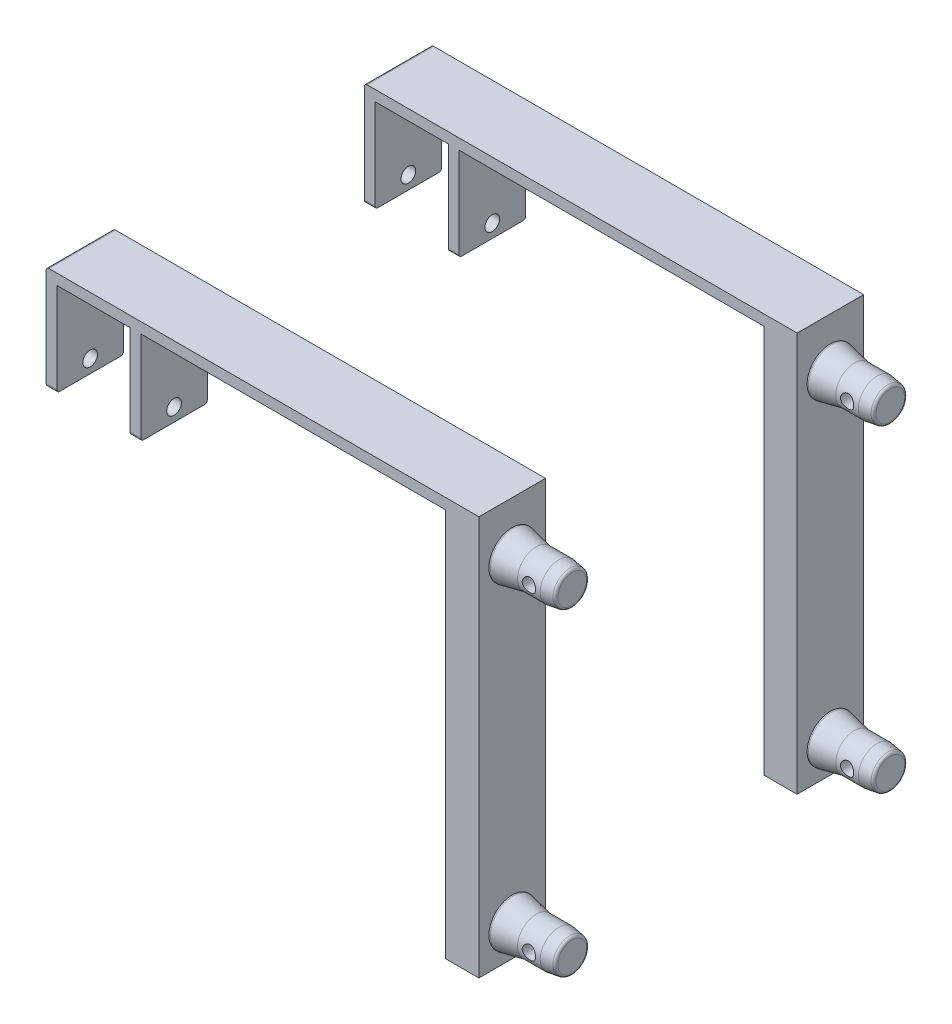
ISO-10303-21;
HEADER;
FILE_DESCRIPTION(('STEP AP214'),'2;1');
FILE_NAME('part.step','',(''),(''),'','','');
FILE_SCHEMA(('AUTOMOTIVE_DESIGN { 1 0 10303 214 1 1 1 1 }'));
ENDSEC;
DATA;
#1=APPLICATION_CONTEXT('core data for automotive mechanical design processes');
#2=APPLICATION_PROTOCOL_DEFINITION('international standard','automotive_design',2000,#1);
#3=PRODUCT_CONTEXT('',#1,'mechanical');
#4=PRODUCT('Part','Part','',(#3));
#5=PRODUCT_RELATED_PRODUCT_CATEGORY('part','',(#4));
#6=PRODUCT_DEFINITION_FORMATION('','',#4);
#7=PRODUCT_DEFINITION_CONTEXT('part definition',#1,'design');
#8=PRODUCT_DEFINITION('design','',#6,#7);
#9=PRODUCT_DEFINITION_SHAPE('','',#8);
#10=(LENGTH_UNIT() NAMED_UNIT(*) SI_UNIT(.MILLI.,.METRE.));
#11=(NAMED_UNIT(*) PLANE_ANGLE_UNIT() SI_UNIT($,.RADIAN.));
#12=(NAMED_UNIT(*) SI_UNIT($,.STERADIAN.) SOLID_ANGLE_UNIT());
#13=UNCERTAINTY_MEASURE_WITH_UNIT(LENGTH_MEASURE(1.E-05),#10,'distance_accuracy_value','');
#14=(GEOMETRIC_REPRESENTATION_CONTEXT(3) GLOBAL_UNCERTAINTY_ASSIGNED_CONTEXT((#13)) GLOBAL_UNIT_ASSIGNED_CONTEXT((#10,
#11,#12)) REPRESENTATION_CONTEXT('',''));
#15=CARTESIAN_POINT('',(0.,0.,0.));
#16=DIRECTION('',(0.,0.,1.));
#17=DIRECTION('',(1.,0.,0.));
#18=AXIS2_PLACEMENT_3D('',#15,#16,#17);
#19=CARTESIAN_POINT('',(325.,70.,50.));
#20=DIRECTION('',(0.,1.,0.));
#21=DIRECTION('',(-1.,0.,0.));
#22=AXIS2_PLACEMENT_3D('',#19,#20,#21);
#23=PLANE('',#22);
#24=DIRECTION('',(0.,0.,-1.));
#25=VECTOR('',#24,1.);
#26=CARTESIAN_POINT('',(300.,70.,45.));
#27=LINE('',#26,#25);
#28=CARTESIAN_POINT('',(300.,70.,50.));
#29=VERTEX_POINT('',#28);
#30=CARTESIAN_POINT('',(300.,70.,45.));
#31=VERTEX_POINT('',#30);
#32=EDGE_CURVE('E213',#29,#31,#27,.T.);
#33=ORIENTED_EDGE('',*,*,#32,.F.);
#34=DIRECTION('',(1.,0.,0.));
#35=VECTOR('',#34,1.);
#36=CARTESIAN_POINT('',(325.,70.,50.));
#37=LINE('',#36,#35);
#38=CARTESIAN_POINT('',(71.,70.,50.));
#39=VERTEX_POINT('',#38);
#40=EDGE_CURVE('E245',#39,#29,#37,.T.);
#41=ORIENTED_EDGE('',*,*,#40,.F.);
#42=DIRECTION('',(0.,0.,-1.));
#43=VECTOR('',#42,1.);
#44=CARTESIAN_POINT('',(71.,70.,50.));
#45=LINE('',#44,#43);
#46=CARTESIAN_POINT('',(71.,70.,0.));
#47=VERTEX_POINT('',#46);
#48=EDGE_CURVE('E261',#39,#47,#45,.T.);
#49=ORIENTED_EDGE('',*,*,#48,.T.);
#50=DIRECTION('',(1.,0.,0.));
#51=VECTOR('',#50,1.);
#52=CARTESIAN_POINT('',(325.,70.,0.));
#53=LINE('',#52,#51);
#54=CARTESIAN_POINT('',(300.,70.,0.));
#55=VERTEX_POINT('',#54);
#56=EDGE_CURVE('E228',#47,#55,#53,.T.);
#57=ORIENTED_EDGE('',*,*,#56,.T.);
#58=DIRECTION('',(0.,0.,-1.));
#59=VECTOR('',#58,1.);
#60=CARTESIAN_POINT('',(300.,70.,0.));
#61=LINE('',#60,#59);
#62=CARTESIAN_POINT('',(300.,70.,5.));
#63=VERTEX_POINT('',#62);
#64=EDGE_CURVE('E210',#63,#55,#61,.T.);
#65=ORIENTED_EDGE('',*,*,#64,.F.);
#66=DIRECTION('',(-1.,0.,0.));
#67=VECTOR('',#66,1.);
#68=CARTESIAN_POINT('',(300.,70.,5.));
#69=LINE('',#68,#67);
#70=CARTESIAN_POINT('',(320.,70.,5.));
#71=VERTEX_POINT('',#70);
#72=EDGE_CURVE('E507',#71,#63,#69,.T.);
#73=ORIENTED_EDGE('',*,*,#72,.F.);
#74=DIRECTION('',(0.,0.,-1.));
#75=VECTOR('',#74,1.);
#76=CARTESIAN_POINT('',(320.,70.,5.));
#77=LINE('',#76,#75);
#78=CARTESIAN_POINT('',(320.,70.,45.));
#79=VERTEX_POINT('',#78);
#80=EDGE_CURVE('E511',#79,#71,#77,.T.);
#81=ORIENTED_EDGE('',*,*,#80,.F.);
#82=DIRECTION('',(1.,0.,0.));
#83=VECTOR('',#82,1.);
#84=CARTESIAN_POINT('',(320.,70.,45.));
#85=LINE('',#84,#83);
#86=EDGE_CURVE('E512',#31,#79,#85,.T.);
#87=ORIENTED_EDGE('',*,*,#86,.F.);
#88=EDGE_LOOP('',(#33,#41,#49,#57,#65,#73,#81,#87));
#89=FACE_BOUND('',#88,.T.);
#90=ADVANCED_FACE('F41',(#89),#23,.F.);
#91=CARTESIAN_POINT('',(8.,0.,50.));
#92=DIRECTION('',(0.,1.,0.));
#93=DIRECTION('',(-1.,0.,0.));
#94=AXIS2_PLACEMENT_3D('',#91,#92,#93);
#95=PLANE('',#94);
#96=DIRECTION('',(0.,0.,-1.));
#97=VECTOR('',#96,1.);
#98=CARTESIAN_POINT('',(0.,0.,50.));
#99=LINE('',#98,#97);
#100=CARTESIAN_POINT('',(0.,0.,48.));
#101=VERTEX_POINT('',#100);
#102=CARTESIAN_POINT('',(0.,0.,2.));
#103=VERTEX_POINT('',#102);
#104=EDGE_CURVE('E255',#101,#103,#99,.T.);
#105=ORIENTED_EDGE('',*,*,#104,.T.);
#106=DIRECTION('',(1.,0.,0.));
#107=VECTOR('',#106,1.);
#108=CARTESIAN_POINT('',(8.,0.,2.));
#109=LINE('',#108,#107);
#110=CARTESIAN_POINT('',(8.,0.,2.));
#111=VERTEX_POINT('',#110);
#112=EDGE_CURVE('E281',#103,#111,#109,.T.);
#113=ORIENTED_EDGE('',*,*,#112,.T.);
#114=DIRECTION('',(0.,0.,-1.));
#115=VECTOR('',#114,1.);
#116=CARTESIAN_POINT('',(8.,0.,50.));
#117=LINE('',#116,#115);
#118=CARTESIAN_POINT('',(8.,0.,48.));
#119=VERTEX_POINT('',#118);
#120=EDGE_CURVE('E276',#119,#111,#117,.T.);
#121=ORIENTED_EDGE('',*,*,#120,.F.);
#122=DIRECTION('',(1.,0.,0.));
#123=VECTOR('',#122,1.);
#124=CARTESIAN_POINT('',(8.,0.,48.));
#125=LINE('',#124,#123);
#126=EDGE_CURVE('E279',#119,#101,#125,.F.);
#127=ORIENTED_EDGE('',*,*,#126,.T.);
#128=EDGE_LOOP('',(#105,#113,#121,#127));
#129=FACE_BOUND('',#128,.T.);
#130=ADVANCED_FACE('F43',(#129),#95,.F.);
#131=CARTESIAN_POINT('',(8.,70.,50.));
#132=DIRECTION('',(-1.,0.,0.));
#133=DIRECTION('',(0.,-1.,0.));
#134=AXIS2_PLACEMENT_3D('',#131,#132,#133);
#135=PLANE('',#134);
#136=CARTESIAN_POINT('',(8.,9.99999999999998,25.));
#137=DIRECTION('',(-1.,0.,0.));
#138=DIRECTION('',(0.,-1.,0.));
#139=AXIS2_PLACEMENT_3D('',#136,#137,#138);
#140=CIRCLE('',#139,5.5);
#141=CARTESIAN_POINT('',(8.,4.49999999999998,25.));
#142=VERTEX_POINT('',#141);
#143=EDGE_CURVE('E395',#142,#142,#140,.T.);
#144=ORIENTED_EDGE('',*,*,#143,.T.);
#145=EDGE_LOOP('',(#144));
#146=FACE_BOUND('',#145,.T.);
#147=ORIENTED_EDGE('',*,*,#120,.T.);
#148=CARTESIAN_POINT('',(8.,2.,2.));
#149=DIRECTION('',(-1.,0.,0.));
#150=DIRECTION('',(0.,-1.,0.));
#151=AXIS2_PLACEMENT_3D('',#148,#149,#150);
#152=CIRCLE('',#151,2.);
#153=CARTESIAN_POINT('',(8.,2.,0.));
#154=VERTEX_POINT('',#153);
#155=EDGE_CURVE('E286',#111,#154,#152,.F.);
#156=ORIENTED_EDGE('',*,*,#155,.T.);
#157=DIRECTION('',(0.,1.,0.));
#158=VECTOR('',#157,1.);
#159=CARTESIAN_POINT('',(8.,70.,0.));
#160=LINE('',#159,#158);
#161=CARTESIAN_POINT('',(8.,70.,0.));
#162=VERTEX_POINT('',#161);
#163=EDGE_CURVE('E214',#154,#162,#160,.T.);
#164=ORIENTED_EDGE('',*,*,#163,.T.);
#165=DIRECTION('',(0.,0.,-1.));
#166=VECTOR('',#165,1.);
#167=CARTESIAN_POINT('',(8.,70.,50.));
#168=LINE('',#167,#166);
#169=CARTESIAN_POINT('',(8.,70.,50.));
#170=VERTEX_POINT('',#169);
#171=EDGE_CURVE('E273',#170,#162,#168,.T.);
#172=ORIENTED_EDGE('',*,*,#171,.F.);
#173=DIRECTION('',(0.,1.,0.));
#174=VECTOR('',#173,1.);
#175=CARTESIAN_POINT('',(8.,70.,50.));
#176=LINE('',#175,#174);
#177=CARTESIAN_POINT('',(8.,2.,50.));
#178=VERTEX_POINT('',#177);
#179=EDGE_CURVE('E237',#178,#170,#176,.T.);
#180=ORIENTED_EDGE('',*,*,#179,.F.);
#181=CARTESIAN_POINT('',(8.,2.,48.));
#182=DIRECTION('',(-1.,0.,0.));
#183=DIRECTION('',(0.,-1.,0.));
#184=AXIS2_PLACEMENT_3D('',#181,#182,#183);
#185=CIRCLE('',#184,2.);
#186=EDGE_CURVE('E284',#178,#119,#185,.F.);
#187=ORIENTED_EDGE('',*,*,#186,.T.);
#188=EDGE_LOOP('',(#147,#156,#164,#172,#180,#187));
#189=FACE_BOUND('',#188,.T.);
#190=ADVANCED_FACE('F367',(#146,#189),#135,.F.);
#191=CARTESIAN_POINT('',(63.,70.,50.));
#192=DIRECTION('',(0.,1.,0.));
#193=DIRECTION('',(-1.,0.,0.));
#194=AXIS2_PLACEMENT_3D('',#191,#192,#193);
#195=PLANE('',#194);
#196=DIRECTION('',(1.,0.,0.));
#197=VECTOR('',#196,1.);
#198=CARTESIAN_POINT('',(63.,70.,0.));
#199=LINE('',#198,#197);
#200=CARTESIAN_POINT('',(63.,70.,0.));
#201=VERTEX_POINT('',#200);
#202=EDGE_CURVE('E216',#162,#201,#199,.T.);
#203=ORIENTED_EDGE('',*,*,#202,.T.);
#204=DIRECTION('',(0.,0.,-1.));
#205=VECTOR('',#204,1.);
#206=CARTESIAN_POINT('',(63.,70.,50.));
#207=LINE('',#206,#205);
#208=CARTESIAN_POINT('',(63.,70.,50.));
#209=VERTEX_POINT('',#208);
#210=EDGE_CURVE('E270',#209,#201,#207,.T.);
#211=ORIENTED_EDGE('',*,*,#210,.F.);
#212=DIRECTION('',(1.,0.,0.));
#213=VECTOR('',#212,1.);
#214=CARTESIAN_POINT('',(63.,70.,50.));
#215=LINE('',#214,#213);
#216=EDGE_CURVE('E239',#170,#209,#215,.T.);
#217=ORIENTED_EDGE('',*,*,#216,.F.);
#218=ORIENTED_EDGE('',*,*,#171,.T.);
#219=EDGE_LOOP('',(#203,#211,#217,#218));
#220=FACE_BOUND('',#219,.T.);
#221=ADVANCED_FACE('F384',(#220),#195,.F.);
#222=CARTESIAN_POINT('',(63.,0.,50.));
#223=DIRECTION('',(1.,0.,0.));
#224=DIRECTION('',(0.,0.,-1.));
#225=AXIS2_PLACEMENT_3D('',#222,#223,#224);
#226=PLANE('',#225);
#227=CARTESIAN_POINT('',(63.,9.99999999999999,25.));
#228=DIRECTION('',(1.,0.,0.));
#229=DIRECTION('',(0.,0.,-1.));
#230=AXIS2_PLACEMENT_3D('',#227,#228,#229);
#231=CIRCLE('',#230,5.5);
#232=CARTESIAN_POINT('',(63.,9.99999999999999,19.5));
#233=VERTEX_POINT('',#232);
#234=EDGE_CURVE('E581',#233,#233,#231,.T.);
#235=ORIENTED_EDGE('',*,*,#234,.T.);
#236=EDGE_LOOP('',(#235));
#237=FACE_BOUND('',#236,.T.);
#238=DIRECTION('',(0.,-1.,0.));
#239=VECTOR('',#238,1.);
#240=CARTESIAN_POINT('',(63.,0.,0.));
#241=LINE('',#240,#239);
#242=CARTESIAN_POINT('',(63.,2.00000000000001,0.));
#243=VERTEX_POINT('',#242);
#244=EDGE_CURVE('E223',#201,#243,#241,.T.);
#245=ORIENTED_EDGE('',*,*,#244,.T.);
#246=CARTESIAN_POINT('',(63.,2.00000000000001,2.));
#247=DIRECTION('',(1.,0.,0.));
#248=DIRECTION('',(0.,0.,-1.));
#249=AXIS2_PLACEMENT_3D('',#246,#247,#248);
#250=CIRCLE('',#249,2.);
#251=CARTESIAN_POINT('',(63.,0.,2.));
#252=VERTEX_POINT('',#251);
#253=EDGE_CURVE('E311',#243,#252,#250,.F.);
#254=ORIENTED_EDGE('',*,*,#253,.T.);
#255=DIRECTION('',(0.,0.,-1.));
#256=VECTOR('',#255,1.);
#257=CARTESIAN_POINT('',(63.,0.,50.));
#258=LINE('',#257,#256);
#259=CARTESIAN_POINT('',(63.,0.,48.));
#260=VERTEX_POINT('',#259);
#261=EDGE_CURVE('E267',#260,#252,#258,.T.);
#262=ORIENTED_EDGE('',*,*,#261,.F.);
#263=CARTESIAN_POINT('',(63.,2.00000000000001,48.));
#264=DIRECTION('',(1.,0.,0.));
#265=DIRECTION('',(0.,0.,-1.));
#266=AXIS2_PLACEMENT_3D('',#263,#264,#265);
#267=CIRCLE('',#266,2.);
#268=CARTESIAN_POINT('',(63.,2.00000000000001,50.));
#269=VERTEX_POINT('',#268);
#270=EDGE_CURVE('E64',#260,#269,#267,.F.);
#271=ORIENTED_EDGE('',*,*,#270,.T.);
#272=DIRECTION('',(0.,-1.,0.));
#273=VECTOR('',#272,1.);
#274=CARTESIAN_POINT('',(63.,0.,50.));
#275=LINE('',#274,#273);
#276=EDGE_CURVE('E241',#209,#269,#275,.T.);
#277=ORIENTED_EDGE('',*,*,#276,.F.);
#278=ORIENTED_EDGE('',*,*,#210,.T.);
#279=EDGE_LOOP('',(#245,#254,#262,#271,#277,#278));
#280=FACE_BOUND('',#279,.T.);
#281=ADVANCED_FACE('F380',(#237,#280),#226,.F.);
#282=CARTESIAN_POINT('',(71.,0.,50.));
#283=DIRECTION('',(0.,1.,0.));
#284=DIRECTION('',(0.,0.,1.));
#285=AXIS2_PLACEMENT_3D('',#282,#283,#284);
#286=PLANE('',#285);
#287=ORIENTED_EDGE('',*,*,#261,.T.);
#288=DIRECTION('',(1.,0.,0.));
#289=VECTOR('',#288,1.);
#290=CARTESIAN_POINT('',(71.,0.,2.));
#291=LINE('',#290,#289);
#292=CARTESIAN_POINT('',(71.,0.,2.));
#293=VERTEX_POINT('',#292);
#294=EDGE_CURVE('E303',#252,#293,#291,.T.);
#295=ORIENTED_EDGE('',*,*,#294,.T.);
#296=DIRECTION('',(0.,0.,-1.));
#297=VECTOR('',#296,1.);
#298=CARTESIAN_POINT('',(71.,0.,50.));
#299=LINE('',#298,#297);
#300=CARTESIAN_POINT('',(71.,0.,48.));
#301=VERTEX_POINT('',#300);
#302=EDGE_CURVE('E264',#301,#293,#299,.T.);
#303=ORIENTED_EDGE('',*,*,#302,.F.);
#304=DIRECTION('',(1.,0.,0.));
#305=VECTOR('',#304,1.);
#306=CARTESIAN_POINT('',(71.,0.,48.));
#307=LINE('',#306,#305);
#308=EDGE_CURVE('E301',#301,#260,#307,.F.);
#309=ORIENTED_EDGE('',*,*,#308,.T.);
#310=EDGE_LOOP('',(#287,#295,#303,#309));
#311=FACE_BOUND('',#310,.T.);
#312=ADVANCED_FACE('F376',(#311),#286,.F.);
#313=CARTESIAN_POINT('',(71.,70.,50.));
#314=DIRECTION('',(-1.,0.,0.));
#315=DIRECTION('',(0.,-1.,0.));
#316=AXIS2_PLACEMENT_3D('',#313,#314,#315);
#317=PLANE('',#316);
#318=CARTESIAN_POINT('',(71.,9.99999999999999,25.));
#319=DIRECTION('',(1.,0.,0.));
#320=DIRECTION('',(0.,1.,0.));
#321=AXIS2_PLACEMENT_3D('',#318,#319,#320);
#322=CIRCLE('',#321,5.5);
#323=CARTESIAN_POINT('',(71.,15.5,25.));
#324=VERTEX_POINT('',#323);
#325=EDGE_CURVE('E575',#324,#324,#322,.T.);
#326=ORIENTED_EDGE('',*,*,#325,.F.);
#327=EDGE_LOOP('',(#326));
#328=FACE_BOUND('',#327,.T.);
#329=ORIENTED_EDGE('',*,*,#302,.T.);
#330=CARTESIAN_POINT('',(71.,2.00000000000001,2.));
#331=DIRECTION('',(-1.,0.,0.));
#332=DIRECTION('',(0.,-1.,0.));
#333=AXIS2_PLACEMENT_3D('',#330,#331,#332);
#334=CIRCLE('',#333,2.);
#335=CARTESIAN_POINT('',(71.,2.,0.));
#336=VERTEX_POINT('',#335);
#337=EDGE_CURVE('E308',#293,#336,#334,.F.);
#338=ORIENTED_EDGE('',*,*,#337,.T.);
#339=DIRECTION('',(0.,1.,0.));
#340=VECTOR('',#339,1.);
#341=CARTESIAN_POINT('',(71.,70.,0.));
#342=LINE('',#341,#340);
#343=EDGE_CURVE('E226',#336,#47,#342,.T.);
#344=ORIENTED_EDGE('',*,*,#343,.T.);
#345=ORIENTED_EDGE('',*,*,#48,.F.);
#346=DIRECTION('',(0.,1.,0.));
#347=VECTOR('',#346,1.);
#348=CARTESIAN_POINT('',(71.,70.,50.));
#349=LINE('',#348,#347);
#350=CARTESIAN_POINT('',(71.,2.,50.));
#351=VERTEX_POINT('',#350);
#352=EDGE_CURVE('E243',#351,#39,#349,.T.);
#353=ORIENTED_EDGE('',*,*,#352,.F.);
#354=CARTESIAN_POINT('',(71.,2.00000000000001,48.));
#355=DIRECTION('',(-1.,0.,0.));
#356=DIRECTION('',(0.,-1.,0.));
#357=AXIS2_PLACEMENT_3D('',#354,#355,#356);
#358=CIRCLE('',#357,2.);
#359=EDGE_CURVE('E306',#351,#301,#358,.F.);
#360=ORIENTED_EDGE('',*,*,#359,.T.);
#361=EDGE_LOOP('',(#329,#338,#344,#345,#353,#360));
#362=FACE_BOUND('',#361,.T.);
#363=ADVANCED_FACE('F373',(#328,#362),#317,.F.);
#364=CARTESIAN_POINT('',(325.,78.,50.));
#365=DIRECTION('',(-1.,0.,0.));
#366=DIRECTION('',(0.,0.,1.));
#367=AXIS2_PLACEMENT_3D('',#364,#365,#366);
#368=PLANE('',#367);
#369=CARTESIAN_POINT('',(325.,-198.,25.));
#370=DIRECTION('',(-1.,0.,0.));
#371=DIRECTION('',(0.,0.,1.));
#372=AXIS2_PLACEMENT_3D('',#369,#370,#371);
#373=CIRCLE('',#372,17.5);
#374=CARTESIAN_POINT('',(325.,-198.,42.5));
#375=VERTEX_POINT('',#374);
#376=EDGE_CURVE('E605',#375,#375,#373,.T.);
#377=ORIENTED_EDGE('',*,*,#376,.T.);
#378=EDGE_LOOP('',(#377));
#379=FACE_BOUND('',#378,.T.);
#380=CARTESIAN_POINT('',(325.,41.,25.));
#381=DIRECTION('',(-1.,0.,0.));
#382=DIRECTION('',(0.,0.,1.));
#383=AXIS2_PLACEMENT_3D('',#380,#381,#382);
#384=CIRCLE('',#383,17.5);
#385=CARTESIAN_POINT('',(325.,41.,42.5));
#386=VERTEX_POINT('',#385);
#387=EDGE_CURVE('E564',#386,#386,#384,.T.);
#388=ORIENTED_EDGE('',*,*,#387,.T.);
#389=EDGE_LOOP('',(#388));
#390=FACE_BOUND('',#389,.T.);
#391=DIRECTION('',(0.,1.,0.));
#392=VECTOR('',#391,1.);
#393=CARTESIAN_POINT('',(325.,78.,0.));
#394=LINE('',#393,#392);
#395=CARTESIAN_POINT('',(325.,-222.,0.));
#396=VERTEX_POINT('',#395);
#397=CARTESIAN_POINT('',(325.,78.,0.));
#398=VERTEX_POINT('',#397);
#399=EDGE_CURVE('E230',#396,#398,#394,.T.);
#400=ORIENTED_EDGE('',*,*,#399,.T.);
#401=DIRECTION('',(0.,0.,-1.));
#402=VECTOR('',#401,1.);
#403=CARTESIAN_POINT('',(325.,78.,50.));
#404=LINE('',#403,#402);
#405=CARTESIAN_POINT('',(325.,78.,50.));
#406=VERTEX_POINT('',#405);
#407=EDGE_CURVE('E258',#406,#398,#404,.T.);
#408=ORIENTED_EDGE('',*,*,#407,.F.);
#409=DIRECTION('',(0.,1.,0.));
#410=VECTOR('',#409,1.);
#411=CARTESIAN_POINT('',(325.,78.,50.));
#412=LINE('',#411,#410);
#413=CARTESIAN_POINT('',(325.,-222.,50.));
#414=VERTEX_POINT('',#413);
#415=EDGE_CURVE('E248',#414,#406,#412,.T.);
#416=ORIENTED_EDGE('',*,*,#415,.F.);
#417=DIRECTION('',(0.,0.,1.));
#418=VECTOR('',#417,1.);
#419=CARTESIAN_POINT('',(325.,-222.,50.));
#420=LINE('',#419,#418);
#421=EDGE_CURVE('E487',#396,#414,#420,.T.);
#422=ORIENTED_EDGE('',*,*,#421,.F.);
#423=EDGE_LOOP('',(#400,#408,#416,#422));
#424=FACE_BOUND('',#423,.T.);
#425=ADVANCED_FACE('F371',(#379,#390,#424),#368,.F.);
#426=CARTESIAN_POINT('',(0.,78.,50.));
#427=DIRECTION('',(0.,-1.,0.));
#428=DIRECTION('',(0.,0.,-1.));
#429=AXIS2_PLACEMENT_3D('',#426,#427,#428);
#430=PLANE('',#429);
#431=DIRECTION('',(-1.,0.,0.));
#432=VECTOR('',#431,1.);
#433=CARTESIAN_POINT('',(0.,78.,0.));
#434=LINE('',#433,#432);
#435=CARTESIAN_POINT('',(2.,78.,0.));
#436=VERTEX_POINT('',#435);
#437=EDGE_CURVE('E232',#398,#436,#434,.T.);
#438=ORIENTED_EDGE('',*,*,#437,.T.);
#439=DIRECTION('',(0.,0.,-1.));
#440=VECTOR('',#439,1.);
#441=CARTESIAN_POINT('',(2.,78.,50.));
#442=LINE('',#441,#440);
#443=CARTESIAN_POINT('',(2.,78.,50.));
#444=VERTEX_POINT('',#443);
#445=EDGE_CURVE('E56',#436,#444,#442,.F.);
#446=ORIENTED_EDGE('',*,*,#445,.T.);
#447=DIRECTION('',(-1.,0.,0.));
#448=VECTOR('',#447,1.);
#449=CARTESIAN_POINT('',(0.,78.,50.));
#450=LINE('',#449,#448);
#451=EDGE_CURVE('E250',#406,#444,#450,.T.);
#452=ORIENTED_EDGE('',*,*,#451,.F.);
#453=ORIENTED_EDGE('',*,*,#407,.T.);
#454=EDGE_LOOP('',(#438,#446,#452,#453));
#455=FACE_BOUND('',#454,.T.);
#456=ADVANCED_FACE('F473',(#455),#430,.F.);
#457=CARTESIAN_POINT('',(0.,0.,50.));
#458=DIRECTION('',(1.,0.,0.));
#459=DIRECTION('',(0.,0.,-1.));
#460=AXIS2_PLACEMENT_3D('',#457,#458,#459);
#461=PLANE('',#460);
#462=CARTESIAN_POINT('',(0.,9.99999999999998,25.));
#463=DIRECTION('',(1.,0.,0.));
#464=DIRECTION('',(0.,1.,0.));
#465=AXIS2_PLACEMENT_3D('',#462,#463,#464);
#466=CIRCLE('',#465,5.5);
#467=CARTESIAN_POINT('',(0.,15.5,25.));
#468=VERTEX_POINT('',#467);
#469=EDGE_CURVE('E578',#468,#468,#466,.T.);
#470=ORIENTED_EDGE('',*,*,#469,.T.);
#471=EDGE_LOOP('',(#470));
#472=FACE_BOUND('',#471,.T.);
#473=DIRECTION('',(0.,-1.,0.));
#474=VECTOR('',#473,1.);
#475=CARTESIAN_POINT('',(0.,0.,0.));
#476=LINE('',#475,#474);
#477=CARTESIAN_POINT('',(0.,76.,0.));
#478=VERTEX_POINT('',#477);
#479=CARTESIAN_POINT('',(0.,2.,0.));
#480=VERTEX_POINT('',#479);
#481=EDGE_CURVE('E234',#478,#480,#476,.T.);
#482=ORIENTED_EDGE('',*,*,#481,.T.);
#483=CARTESIAN_POINT('',(0.,2.,2.));
#484=DIRECTION('',(1.,0.,0.));
#485=DIRECTION('',(0.,0.,-1.));
#486=AXIS2_PLACEMENT_3D('',#483,#484,#485);
#487=CIRCLE('',#486,2.);
#488=EDGE_CURVE('E299',#480,#103,#487,.F.);
#489=ORIENTED_EDGE('',*,*,#488,.T.);
#490=ORIENTED_EDGE('',*,*,#104,.F.);
#491=CARTESIAN_POINT('',(0.,2.,48.));
#492=DIRECTION('',(1.,0.,0.));
#493=DIRECTION('',(0.,0.,-1.));
#494=AXIS2_PLACEMENT_3D('',#491,#492,#493);
#495=CIRCLE('',#494,2.);
#496=CARTESIAN_POINT('',(0.,2.,50.));
#497=VERTEX_POINT('',#496);
#498=EDGE_CURVE('E297',#101,#497,#495,.F.);
#499=ORIENTED_EDGE('',*,*,#498,.T.);
#500=DIRECTION('',(0.,-1.,0.));
#501=VECTOR('',#500,1.);
#502=CARTESIAN_POINT('',(0.,0.,50.));
#503=LINE('',#502,#501);
#504=CARTESIAN_POINT('',(0.,76.,50.));
#505=VERTEX_POINT('',#504);
#506=EDGE_CURVE('E252',#505,#497,#503,.T.);
#507=ORIENTED_EDGE('',*,*,#506,.F.);
#508=DIRECTION('',(0.,0.,-1.));
#509=VECTOR('',#508,1.);
#510=CARTESIAN_POINT('',(0.,76.,50.));
#511=LINE('',#510,#509);
#512=EDGE_CURVE('E294',#505,#478,#511,.T.);
#513=ORIENTED_EDGE('',*,*,#512,.T.);
#514=EDGE_LOOP('',(#482,#489,#490,#499,#507,#513));
#515=FACE_BOUND('',#514,.T.);
#516=ADVANCED_FACE('F408',(#472,#515),#461,.F.);
#517=CARTESIAN_POINT('',(0.,0.,50.));
#518=DIRECTION('',(0.,0.,-1.));
#519=DIRECTION('',(-1.,0.,0.));
#520=AXIS2_PLACEMENT_3D('',#517,#518,#519);
#521=PLANE('',#520);
#522=ORIENTED_EDGE('',*,*,#276,.T.);
#523=DIRECTION('',(1.,0.,0.));
#524=VECTOR('',#523,1.);
#525=CARTESIAN_POINT('',(0.,2.00000000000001,50.));
#526=LINE('',#525,#524);
#527=EDGE_CURVE('E318',#269,#351,#526,.T.);
#528=ORIENTED_EDGE('',*,*,#527,.T.);
#529=ORIENTED_EDGE('',*,*,#352,.T.);
#530=ORIENTED_EDGE('',*,*,#40,.T.);
#531=DIRECTION('',(0.,1.,0.));
#532=VECTOR('',#531,1.);
#533=CARTESIAN_POINT('',(300.,-222.,50.));
#534=LINE('',#533,#532);
#535=CARTESIAN_POINT('',(300.,-222.,50.));
#536=VERTEX_POINT('',#535);
#537=EDGE_CURVE('E493',#536,#29,#534,.T.);
#538=ORIENTED_EDGE('',*,*,#537,.F.);
#539=DIRECTION('',(-1.,0.,0.));
#540=VECTOR('',#539,1.);
#541=CARTESIAN_POINT('',(300.,-222.,50.));
#542=LINE('',#541,#540);
#543=EDGE_CURVE('E206',#414,#536,#542,.T.);
#544=ORIENTED_EDGE('',*,*,#543,.F.);
#545=ORIENTED_EDGE('',*,*,#415,.T.);
#546=ORIENTED_EDGE('',*,*,#451,.T.);
#547=CARTESIAN_POINT('',(2.,76.,50.));
#548=DIRECTION('',(0.,0.,-1.));
#549=DIRECTION('',(-1.,0.,0.));
#550=AXIS2_PLACEMENT_3D('',#547,#548,#549);
#551=CIRCLE('',#550,2.);
#552=EDGE_CURVE('E313',#444,#505,#551,.F.);
#553=ORIENTED_EDGE('',*,*,#552,.T.);
#554=ORIENTED_EDGE('',*,*,#506,.T.);
#555=DIRECTION('',(1.,0.,0.));
#556=VECTOR('',#555,1.);
#557=CARTESIAN_POINT('',(0.,2.,50.));
#558=LINE('',#557,#556);
#559=EDGE_CURVE('E315',#497,#178,#558,.T.);
#560=ORIENTED_EDGE('',*,*,#559,.T.);
#561=ORIENTED_EDGE('',*,*,#179,.T.);
#562=ORIENTED_EDGE('',*,*,#216,.T.);
#563=EDGE_LOOP('',(#522,#528,#529,#530,#538,#544,#545,#546,#553,#554,#560,#561,#562));
#564=FACE_BOUND('',#563,.T.);
#565=ADVANCED_FACE('F411',(#564),#521,.F.);
#566=CARTESIAN_POINT('',(0.,0.,0.));
#567=DIRECTION('',(0.,0.,-1.));
#568=DIRECTION('',(-1.,0.,0.));
#569=AXIS2_PLACEMENT_3D('',#566,#567,#568);
#570=PLANE('',#569);
#571=ORIENTED_EDGE('',*,*,#163,.F.);
#572=DIRECTION('',(1.,0.,0.));
#573=VECTOR('',#572,1.);
#574=CARTESIAN_POINT('',(0.,2.,0.));
#575=LINE('',#574,#573);
#576=EDGE_CURVE('E292',#154,#480,#575,.F.);
#577=ORIENTED_EDGE('',*,*,#576,.T.);
#578=ORIENTED_EDGE('',*,*,#481,.F.);
#579=CARTESIAN_POINT('',(2.,76.,0.));
#580=DIRECTION('',(0.,0.,-1.));
#581=DIRECTION('',(-1.,0.,0.));
#582=AXIS2_PLACEMENT_3D('',#579,#580,#581);
#583=CIRCLE('',#582,2.);
#584=EDGE_CURVE('E288',#478,#436,#583,.T.);
#585=ORIENTED_EDGE('',*,*,#584,.T.);
#586=ORIENTED_EDGE('',*,*,#437,.F.);
#587=ORIENTED_EDGE('',*,*,#399,.F.);
#588=DIRECTION('',(1.,0.,0.));
#589=VECTOR('',#588,1.);
#590=CARTESIAN_POINT('',(325.,-222.,0.));
#591=LINE('',#590,#589);
#592=CARTESIAN_POINT('',(300.,-222.,0.));
#593=VERTEX_POINT('',#592);
#594=EDGE_CURVE('E484',#593,#396,#591,.T.);
#595=ORIENTED_EDGE('',*,*,#594,.F.);
#596=DIRECTION('',(0.,1.,0.));
#597=VECTOR('',#596,1.);
#598=CARTESIAN_POINT('',(300.,-222.,0.));
#599=LINE('',#598,#597);
#600=EDGE_CURVE('E498',#593,#55,#599,.T.);
#601=ORIENTED_EDGE('',*,*,#600,.T.);
#602=ORIENTED_EDGE('',*,*,#56,.F.);
#603=ORIENTED_EDGE('',*,*,#343,.F.);
#604=DIRECTION('',(1.,0.,0.));
#605=VECTOR('',#604,1.);
#606=CARTESIAN_POINT('',(63.,2.00000000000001,0.));
#607=LINE('',#606,#605);
#608=EDGE_CURVE('E290',#336,#243,#607,.F.);
#609=ORIENTED_EDGE('',*,*,#608,.T.);
#610=ORIENTED_EDGE('',*,*,#244,.F.);
#611=ORIENTED_EDGE('',*,*,#202,.F.);
#612=EDGE_LOOP('',(#571,#577,#578,#585,#586,#587,#595,#601,#602,#603,#609,#610,#611));
#613=FACE_BOUND('',#612,.T.);
#614=ADVANCED_FACE('F418',(#613),#570,.T.);
#615=CARTESIAN_POINT('',(300.,-222.,45.));
#616=DIRECTION('',(1.,0.,0.));
#617=DIRECTION('',(0.,1.,0.));
#618=AXIS2_PLACEMENT_3D('',#615,#616,#617);
#619=PLANE('',#618);
#620=ORIENTED_EDGE('',*,*,#32,.T.);
#621=DIRECTION('',(0.,1.,0.));
#622=VECTOR('',#621,1.);
#623=CARTESIAN_POINT('',(300.,-222.,45.));
#624=LINE('',#623,#622);
#625=CARTESIAN_POINT('',(300.,-222.,45.));
#626=VERTEX_POINT('',#625);
#627=EDGE_CURVE('E193',#626,#31,#624,.T.);
#628=ORIENTED_EDGE('',*,*,#627,.F.);
#629=DIRECTION('',(0.,0.,-1.));
#630=VECTOR('',#629,1.);
#631=CARTESIAN_POINT('',(300.,-222.,45.));
#632=LINE('',#631,#630);
#633=EDGE_CURVE('E200',#536,#626,#632,.T.);
#634=ORIENTED_EDGE('',*,*,#633,.F.);
#635=ORIENTED_EDGE('',*,*,#537,.T.);
#636=EDGE_LOOP('',(#620,#628,#634,#635));
#637=FACE_BOUND('',#636,.T.);
#638=ADVANCED_FACE('F212',(#637),#619,.F.);
#639=CARTESIAN_POINT('',(320.,-222.,45.));
#640=DIRECTION('',(0.,0.,1.));
#641=DIRECTION('',(1.,0.,0.));
#642=AXIS2_PLACEMENT_3D('',#639,#640,#641);
#643=PLANE('',#642);
#644=ORIENTED_EDGE('',*,*,#86,.T.);
#645=DIRECTION('',(0.,1.,0.));
#646=VECTOR('',#645,1.);
#647=CARTESIAN_POINT('',(320.,-222.,45.));
#648=LINE('',#647,#646);
#649=CARTESIAN_POINT('',(320.,-222.,45.));
#650=VERTEX_POINT('',#649);
#651=EDGE_CURVE('E196',#650,#79,#648,.T.);
#652=ORIENTED_EDGE('',*,*,#651,.F.);
#653=DIRECTION('',(1.,0.,0.));
#654=VECTOR('',#653,1.);
#655=CARTESIAN_POINT('',(320.,-222.,45.));
#656=LINE('',#655,#654);
#657=EDGE_CURVE('E188',#626,#650,#656,.T.);
#658=ORIENTED_EDGE('',*,*,#657,.F.);
#659=ORIENTED_EDGE('',*,*,#627,.T.);
#660=EDGE_LOOP('',(#644,#652,#658,#659));
#661=FACE_BOUND('',#660,.T.);
#662=ADVANCED_FACE('F191',(#661),#643,.F.);
#663=CARTESIAN_POINT('',(320.,-222.,5.));
#664=DIRECTION('',(1.,0.,0.));
#665=DIRECTION('',(0.,1.,0.));
#666=AXIS2_PLACEMENT_3D('',#663,#664,#665);
#667=PLANE('',#666);
#668=CARTESIAN_POINT('',(320.,-198.,25.));
#669=DIRECTION('',(1.,0.,0.));
#670=DIRECTION('',(0.,1.,0.));
#671=AXIS2_PLACEMENT_3D('',#668,#669,#670);
#672=CIRCLE('',#671,5.5);
#673=CARTESIAN_POINT('',(320.,-192.5,25.));
#674=VERTEX_POINT('',#673);
#675=EDGE_CURVE('E585',#674,#674,#672,.F.);
#676=ORIENTED_EDGE('',*,*,#675,.F.);
#677=EDGE_LOOP('',(#676));
#678=FACE_BOUND('',#677,.T.);
#679=CARTESIAN_POINT('',(320.,41.,25.));
#680=DIRECTION('',(1.,0.,0.));
#681=DIRECTION('',(0.,1.,0.));
#682=AXIS2_PLACEMENT_3D('',#679,#680,#681);
#683=CIRCLE('',#682,5.5);
#684=CARTESIAN_POINT('',(320.,46.5,25.));
#685=VERTEX_POINT('',#684);
#686=EDGE_CURVE('E588',#685,#685,#683,.F.);
#687=ORIENTED_EDGE('',*,*,#686,.F.);
#688=EDGE_LOOP('',(#687));
#689=FACE_BOUND('',#688,.T.);
#690=ORIENTED_EDGE('',*,*,#80,.T.);
#691=DIRECTION('',(0.,1.,0.));
#692=VECTOR('',#691,1.);
#693=CARTESIAN_POINT('',(320.,-222.,5.));
#694=LINE('',#693,#692);
#695=CARTESIAN_POINT('',(320.,-222.,5.));
#696=VERTEX_POINT('',#695);
#697=EDGE_CURVE('E218',#696,#71,#694,.T.);
#698=ORIENTED_EDGE('',*,*,#697,.F.);
#699=DIRECTION('',(0.,0.,-1.));
#700=VECTOR('',#699,1.);
#701=CARTESIAN_POINT('',(320.,-222.,5.));
#702=LINE('',#701,#700);
#703=EDGE_CURVE('E199',#650,#696,#702,.T.);
#704=ORIENTED_EDGE('',*,*,#703,.F.);
#705=ORIENTED_EDGE('',*,*,#651,.T.);
#706=EDGE_LOOP('',(#690,#698,#704,#705));
#707=FACE_BOUND('',#706,.T.);
#708=ADVANCED_FACE('F459',(#678,#689,#707),#667,.F.);
#709=CARTESIAN_POINT('',(300.,-222.,5.));
#710=DIRECTION('',(0.,0.,-1.));
#711=DIRECTION('',(-1.,0.,0.));
#712=AXIS2_PLACEMENT_3D('',#709,#710,#711);
#713=PLANE('',#712);
#714=ORIENTED_EDGE('',*,*,#72,.T.);
#715=DIRECTION('',(0.,1.,0.));
#716=VECTOR('',#715,1.);
#717=CARTESIAN_POINT('',(300.,-222.,5.));
#718=LINE('',#717,#716);
#719=CARTESIAN_POINT('',(300.,-222.,5.));
#720=VERTEX_POINT('',#719);
#721=EDGE_CURVE('E500',#720,#63,#718,.T.);
#722=ORIENTED_EDGE('',*,*,#721,.F.);
#723=DIRECTION('',(-1.,0.,0.));
#724=VECTOR('',#723,1.);
#725=CARTESIAN_POINT('',(300.,-222.,5.));
#726=LINE('',#725,#724);
#727=EDGE_CURVE('E508',#696,#720,#726,.T.);
#728=ORIENTED_EDGE('',*,*,#727,.F.);
#729=ORIENTED_EDGE('',*,*,#697,.T.);
#730=EDGE_LOOP('',(#714,#722,#728,#729));
#731=FACE_BOUND('',#730,.T.);
#732=ADVANCED_FACE('F455',(#731),#713,.F.);
#733=CARTESIAN_POINT('',(300.,-222.,0.));
#734=DIRECTION('',(1.,0.,0.));
#735=DIRECTION('',(0.,1.,0.));
#736=AXIS2_PLACEMENT_3D('',#733,#734,#735);
#737=PLANE('',#736);
#738=ORIENTED_EDGE('',*,*,#64,.T.);
#739=ORIENTED_EDGE('',*,*,#600,.F.);
#740=DIRECTION('',(0.,0.,-1.));
#741=VECTOR('',#740,1.);
#742=CARTESIAN_POINT('',(300.,-222.,0.));
#743=LINE('',#742,#741);
#744=EDGE_CURVE('E489',#720,#593,#743,.T.);
#745=ORIENTED_EDGE('',*,*,#744,.F.);
#746=ORIENTED_EDGE('',*,*,#721,.T.);
#747=EDGE_LOOP('',(#738,#739,#745,#746));
#748=FACE_BOUND('',#747,.T.);
#749=ADVANCED_FACE('F452',(#748),#737,.F.);
#750=CARTESIAN_POINT('',(300.,-222.,50.));
#751=DIRECTION('',(0.,1.,0.));
#752=DIRECTION('',(0.,0.,1.));
#753=AXIS2_PLACEMENT_3D('',#750,#751,#752);
#754=PLANE('',#753);
#755=ORIENTED_EDGE('',*,*,#633,.T.);
#756=ORIENTED_EDGE('',*,*,#657,.T.);
#757=ORIENTED_EDGE('',*,*,#703,.T.);
#758=ORIENTED_EDGE('',*,*,#727,.T.);
#759=ORIENTED_EDGE('',*,*,#744,.T.);
#760=ORIENTED_EDGE('',*,*,#594,.T.);
#761=ORIENTED_EDGE('',*,*,#421,.T.);
#762=ORIENTED_EDGE('',*,*,#543,.T.);
#763=EDGE_LOOP('',(#755,#756,#757,#758,#759,#760,#761,#762));
#764=FACE_BOUND('',#763,.T.);
#765=ADVANCED_FACE('F203',(#764),#754,.F.);
#766=CARTESIAN_POINT('',(-0.000999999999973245,41.,25.));
#767=DIRECTION('',(1.,0.,0.));
#768=DIRECTION('',(0.,0.,-1.));
#769=AXIS2_PLACEMENT_3D('',#766,#767,#768);
#770=CYLINDRICAL_SURFACE('',#769,5.5);
#771=CARTESIAN_POINT('',(325.,41.,25.));
#772=DIRECTION('',(-1.,0.,0.));
#773=DIRECTION('',(0.,0.,1.));
#774=AXIS2_PLACEMENT_3D('',#771,#772,#773);
#775=CIRCLE('',#774,5.5);
#776=CARTESIAN_POINT('',(325.,41.,30.5));
#777=VERTEX_POINT('',#776);
#778=EDGE_CURVE('E567',#777,#777,#775,.F.);
#779=ORIENTED_EDGE('',*,*,#778,.T.);
#780=EDGE_LOOP('',(#779));
#781=FACE_BOUND('',#780,.T.);
#782=ORIENTED_EDGE('',*,*,#686,.T.);
#783=EDGE_LOOP('',(#782));
#784=FACE_BOUND('',#783,.T.);
#785=ADVANCED_FACE('F445',(#781,#784),#770,.F.);
#786=CARTESIAN_POINT('',(-0.000999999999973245,-198.,25.));
#787=DIRECTION('',(1.,0.,0.));
#788=DIRECTION('',(0.,0.,-1.));
#789=AXIS2_PLACEMENT_3D('',#786,#787,#788);
#790=CYLINDRICAL_SURFACE('',#789,5.5);
#791=CARTESIAN_POINT('',(325.,-198.,25.));
#792=DIRECTION('',(-1.,0.,0.));
#793=DIRECTION('',(0.,0.,1.));
#794=AXIS2_PLACEMENT_3D('',#791,#792,#793);
#795=CIRCLE('',#794,5.5);
#796=CARTESIAN_POINT('',(325.,-198.,30.5));
#797=VERTEX_POINT('',#796);
#798=EDGE_CURVE('E331',#797,#797,#795,.F.);
#799=ORIENTED_EDGE('',*,*,#798,.T.);
#800=EDGE_LOOP('',(#799));
#801=FACE_BOUND('',#800,.T.);
#802=ORIENTED_EDGE('',*,*,#675,.T.);
#803=EDGE_LOOP('',(#802));
#804=FACE_BOUND('',#803,.T.);
#805=ADVANCED_FACE('F441',(#801,#804),#790,.F.);
#806=CARTESIAN_POINT('',(0.,9.99999999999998,25.));
#807=DIRECTION('',(1.,0.,0.));
#808=DIRECTION('',(0.,1.,0.));
#809=AXIS2_PLACEMENT_3D('',#806,#807,#808);
#810=CYLINDRICAL_SURFACE('',#809,5.5);
#811=ORIENTED_EDGE('',*,*,#469,.F.);
#812=EDGE_LOOP('',(#811));
#813=FACE_BOUND('',#812,.T.);
#814=ORIENTED_EDGE('',*,*,#143,.F.);
#815=EDGE_LOOP('',(#814));
#816=FACE_BOUND('',#815,.T.);
#817=ADVANCED_FACE('F435',(#813,#816),#810,.F.);
#818=ORIENTED_EDGE('',*,*,#325,.T.);
#819=EDGE_LOOP('',(#818));
#820=FACE_BOUND('',#819,.T.);
#821=ORIENTED_EDGE('',*,*,#234,.F.);
#822=EDGE_LOOP('',(#821));
#823=FACE_BOUND('',#822,.T.);
#824=ADVANCED_FACE('F426',(#820,#823),#810,.F.);
#825=CARTESIAN_POINT('',(8.,2.,2.));
#826=DIRECTION('',(-1.,0.,0.));
#827=DIRECTION('',(0.,-1.,0.));
#828=AXIS2_PLACEMENT_3D('',#825,#826,#827);
#829=CYLINDRICAL_SURFACE('',#828,2.);
#830=ORIENTED_EDGE('',*,*,#488,.F.);
#831=ORIENTED_EDGE('',*,*,#576,.F.);
#832=ORIENTED_EDGE('',*,*,#155,.F.);
#833=ORIENTED_EDGE('',*,*,#112,.F.);
#834=EDGE_LOOP('',(#830,#831,#832,#833));
#835=FACE_BOUND('',#834,.T.);
#836=ADVANCED_FACE('F423',(#835),#829,.T.);
#837=CARTESIAN_POINT('',(71.,2.00000000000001,2.));
#838=DIRECTION('',(-1.,0.,0.));
#839=DIRECTION('',(0.,0.,1.));
#840=AXIS2_PLACEMENT_3D('',#837,#838,#839);
#841=CYLINDRICAL_SURFACE('',#840,2.);
#842=ORIENTED_EDGE('',*,*,#253,.F.);
#843=ORIENTED_EDGE('',*,*,#608,.F.);
#844=ORIENTED_EDGE('',*,*,#337,.F.);
#845=ORIENTED_EDGE('',*,*,#294,.F.);
#846=EDGE_LOOP('',(#842,#843,#844,#845));
#847=FACE_BOUND('',#846,.T.);
#848=ADVANCED_FACE('F425',(#847),#841,.T.);
#849=CARTESIAN_POINT('',(0.,2.00000000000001,48.));
#850=DIRECTION('',(1.,0.,0.));
#851=DIRECTION('',(0.,0.,-1.));
#852=AXIS2_PLACEMENT_3D('',#849,#850,#851);
#853=CYLINDRICAL_SURFACE('',#852,2.);
#854=ORIENTED_EDGE('',*,*,#270,.F.);
#855=ORIENTED_EDGE('',*,*,#308,.F.);
#856=ORIENTED_EDGE('',*,*,#359,.F.);
#857=ORIENTED_EDGE('',*,*,#527,.F.);
#858=EDGE_LOOP('',(#854,#855,#856,#857));
#859=FACE_BOUND('',#858,.T.);
#860=ADVANCED_FACE('F432',(#859),#853,.T.);
#861=CARTESIAN_POINT('',(0.,2.,48.));
#862=DIRECTION('',(1.,0.,0.));
#863=DIRECTION('',(0.,1.,0.));
#864=AXIS2_PLACEMENT_3D('',#861,#862,#863);
#865=CYLINDRICAL_SURFACE('',#864,2.);
#866=ORIENTED_EDGE('',*,*,#498,.F.);
#867=ORIENTED_EDGE('',*,*,#126,.F.);
#868=ORIENTED_EDGE('',*,*,#186,.F.);
#869=ORIENTED_EDGE('',*,*,#559,.F.);
#870=EDGE_LOOP('',(#866,#867,#868,#869));
#871=FACE_BOUND('',#870,.T.);
#872=ADVANCED_FACE('F404',(#871),#865,.T.);
#873=CARTESIAN_POINT('',(2.,76.,50.));
#874=DIRECTION('',(0.,0.,-1.));
#875=DIRECTION('',(-1.,0.,0.));
#876=AXIS2_PLACEMENT_3D('',#873,#874,#875);
#877=CYLINDRICAL_SURFACE('',#876,2.);
#878=ORIENTED_EDGE('',*,*,#552,.F.);
#879=ORIENTED_EDGE('',*,*,#445,.F.);
#880=ORIENTED_EDGE('',*,*,#584,.F.);
#881=ORIENTED_EDGE('',*,*,#512,.F.);
#882=EDGE_LOOP('',(#878,#879,#880,#881));
#883=FACE_BOUND('',#882,.T.);
#884=ADVANCED_FACE('F414',(#883),#877,.T.);
#885=CARTESIAN_POINT('',(325.,41.,25.));
#886=DIRECTION('',(-1.,0.,0.));
#887=DIRECTION('',(0.,0.,1.));
#888=AXIS2_PLACEMENT_3D('',#885,#886,#887);
#889=PLANE('',#888);
#890=ORIENTED_EDGE('',*,*,#778,.F.);
#891=EDGE_LOOP('',(#890));
#892=FACE_BOUND('',#891,.T.);
#893=ADVANCED_FACE('F546',(#892),#889,.T.);
#894=CARTESIAN_POINT('',(278.062128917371,41.,25.));
#895=DIRECTION('',(-1.,0.,0.));
#896=DIRECTION('',(0.,0.,1.));
#897=AXIS2_PLACEMENT_3D('',#894,#895,#896);
#898=CYLINDRICAL_SURFACE('',#897,17.5);
#899=CARTESIAN_POINT('',(326.,41.,25.));
#900=DIRECTION('',(-1.,0.,0.));
#901=DIRECTION('',(0.,0.,1.));
#902=AXIS2_PLACEMENT_3D('',#899,#900,#901);
#903=CIRCLE('',#902,17.5);
#904=CARTESIAN_POINT('',(326.,41.,42.5));
#905=VERTEX_POINT('',#904);
#906=EDGE_CURVE('E563',#905,#905,#903,.T.);
#907=ORIENTED_EDGE('',*,*,#906,.T.);
#908=EDGE_LOOP('',(#907));
#909=FACE_BOUND('',#908,.T.);
#910=ORIENTED_EDGE('',*,*,#387,.F.);
#911=EDGE_LOOP('',(#910));
#912=FACE_BOUND('',#911,.T.);
#913=ADVANCED_FACE('F549',(#909,#912),#898,.T.);
#914=CARTESIAN_POINT('',(326.,41.,25.));
#915=DIRECTION('',(-1.,0.,0.));
#916=DIRECTION('',(0.,0.,1.));
#917=AXIS2_PLACEMENT_3D('',#914,#915,#916);
#918=CONICAL_SURFACE('',#917,17.5,0.203045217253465);
#919=CARTESIAN_POINT('',(343.,41.,25.));
#920=DIRECTION('',(-1.,0.,0.));
#921=DIRECTION('',(0.,0.,1.));
#922=AXIS2_PLACEMENT_3D('',#919,#920,#921);
#923=CIRCLE('',#922,14.);
#924=CARTESIAN_POINT('',(343.,41.,39.));
#925=VERTEX_POINT('',#924);
#926=EDGE_CURVE('E560',#925,#925,#923,.T.);
#927=ORIENTED_EDGE('',*,*,#926,.T.);
#928=EDGE_LOOP('',(#927));
#929=FACE_BOUND('',#928,.T.);
#930=ORIENTED_EDGE('',*,*,#906,.F.);
#931=EDGE_LOOP('',(#930));
#932=FACE_BOUND('',#931,.T.);
#933=ADVANCED_FACE('F357',(#929,#932),#918,.T.);
#934=CARTESIAN_POINT('',(278.062128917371,41.,25.));
#935=DIRECTION('',(-1.,0.,0.));
#936=DIRECTION('',(0.,0.,1.));
#937=AXIS2_PLACEMENT_3D('',#934,#935,#936);
#938=CYLINDRICAL_SURFACE('',#937,14.);
#939=CARTESIAN_POINT('',(356.5,41.,39.));
#940=CARTESIAN_POINT('',(356.500000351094,41.1358097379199,39.0000002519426));
#941=CARTESIAN_POINT('',(356.494462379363,41.271614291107,38.9980194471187));
#942=CARTESIAN_POINT('',(356.472363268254,41.5422570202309,38.9901497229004));
#943=CARTESIAN_POINT('',(356.455798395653,41.6770948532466,38.9842594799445));
#944=CARTESIAN_POINT('',(356.411813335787,41.9447062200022,38.9687325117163));
#945=CARTESIAN_POINT('',(356.384397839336,42.0774806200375,38.9590974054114));
#946=CARTESIAN_POINT('',(356.318959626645,42.3401326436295,38.9363349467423));
#947=CARTESIAN_POINT('',(356.280932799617,42.4700091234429,38.9232062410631));
#948=CARTESIAN_POINT('',(356.194706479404,42.7256536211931,38.8938342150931));
#949=CARTESIAN_POINT('',(356.146529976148,42.8514301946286,38.8775979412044));
#950=CARTESIAN_POINT('',(356.040358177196,43.0983908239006,38.8424113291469));
#951=CARTESIAN_POINT('',(355.98235924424,43.2195731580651,38.8234599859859));
#952=CARTESIAN_POINT('',(355.794279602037,43.5750514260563,38.7632361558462));
#953=CARTESIAN_POINT('',(355.650046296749,43.8014840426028,38.7185691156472));
#954=CARTESIAN_POINT('',(355.322307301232,44.2352101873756,38.6229449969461));
#955=CARTESIAN_POINT('',(355.13759747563,44.4415489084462,38.5718218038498));
#956=CARTESIAN_POINT('',(354.736472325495,44.8211753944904,38.4698651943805));
#957=CARTESIAN_POINT('',(354.520048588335,44.9944543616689,38.4190318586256));
#958=CARTESIAN_POINT('',(354.171837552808,45.2286910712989,38.3463548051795));
#959=CARTESIAN_POINT('',(354.049594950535,45.3035047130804,38.322357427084));
#960=CARTESIAN_POINT('',(353.798824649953,45.4425130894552,38.276649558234));
#961=CARTESIAN_POINT('',(353.670299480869,45.5067120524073,38.2549381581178));
#962=CARTESIAN_POINT('',(353.407790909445,45.6239603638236,38.2144936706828));
#963=CARTESIAN_POINT('',(353.273806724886,45.6770081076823,38.1957610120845));
#964=CARTESIAN_POINT('',(353.001403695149,45.7714307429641,38.161913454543));
#965=CARTESIAN_POINT('',(352.862986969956,45.8128111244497,38.1467968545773));
#966=CARTESIAN_POINT('',(352.587974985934,45.8821780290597,38.121191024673));
#967=CARTESIAN_POINT('',(352.451505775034,45.9106082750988,38.1105496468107));
#968=CARTESIAN_POINT('',(352.176467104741,45.9559871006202,38.0934633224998));
#969=CARTESIAN_POINT('',(352.037898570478,45.9729405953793,38.0870165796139));
#970=CARTESIAN_POINT('',(351.759709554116,45.9951997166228,38.0785367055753));
#971=CARTESIAN_POINT('',(351.620089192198,46.0005066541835,38.0765030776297));
#972=CARTESIAN_POINT('',(351.340903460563,45.999417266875,38.0769196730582));
#973=CARTESIAN_POINT('',(351.201338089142,45.9930213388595,38.0793697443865));
#974=CARTESIAN_POINT('',(350.930854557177,45.9692558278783,38.0884164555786));
#975=CARTESIAN_POINT('',(350.799874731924,45.9524943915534,38.0947832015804));
#976=CARTESIAN_POINT('',(350.539837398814,45.9087146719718,38.1112572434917));
#977=CARTESIAN_POINT('',(350.410780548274,45.8816929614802,38.1213657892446));
#978=CARTESIAN_POINT('',(350.155528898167,45.817644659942,38.1450167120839));
#979=CARTESIAN_POINT('',(350.029333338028,45.7806207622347,38.1585581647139));
#980=CARTESIAN_POINT('',(349.780553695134,45.6968883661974,38.1886773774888));
#981=CARTESIAN_POINT('',(349.65797101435,45.6501761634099,38.2052562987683));
#982=CARTESIAN_POINT('',(349.29259937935,45.494238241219,38.2594921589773));
#983=CARTESIAN_POINT('',(349.05650023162,45.3702965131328,38.3012259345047));
#984=CARTESIAN_POINT('',(348.607847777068,45.0872928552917,38.3908924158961));
#985=CARTESIAN_POINT('',(348.395302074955,44.9282196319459,38.4388271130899));
#986=CARTESIAN_POINT('',(347.986092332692,44.5680666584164,38.5390490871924));
#987=CARTESIAN_POINT('',(347.791167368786,44.3650276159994,38.5914242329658));
#988=CARTESIAN_POINT('',(347.437653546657,43.9285227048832,38.6921097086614));
#989=CARTESIAN_POINT('',(347.279069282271,43.6950529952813,38.7404195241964));
#990=CARTESIAN_POINT('',(347.001039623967,43.2002009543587,38.8283399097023));
#991=CARTESIAN_POINT('',(346.882123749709,42.9384982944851,38.8678306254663));
#992=CARTESIAN_POINT('',(346.690568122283,42.3970468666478,38.9327833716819));
#993=CARTESIAN_POINT('',(346.617909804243,42.1173053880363,38.9582510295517));
#994=CARTESIAN_POINT('',(346.524161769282,41.5624101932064,38.991324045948));
#995=CARTESIAN_POINT('',(346.500723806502,41.2877012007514,38.9997420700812));
#996=CARTESIAN_POINT('',(346.49930968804,40.738181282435,39.000245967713));
#997=CARTESIAN_POINT('',(346.521324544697,40.4633703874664,38.9923350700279));
#998=CARTESIAN_POINT('',(346.608372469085,39.9312624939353,38.96160696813));
#999=CARTESIAN_POINT('',(346.671910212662,39.6736879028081,38.939308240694));
#1000=CARTESIAN_POINT('',(346.838272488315,39.1730015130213,38.882565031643));
#1001=CARTESIAN_POINT('',(346.941102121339,38.9298915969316,38.8481189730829));
#1002=CARTESIAN_POINT('',(347.186320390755,38.4573626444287,38.7693143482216));
#1003=CARTESIAN_POINT('',(347.329743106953,38.2285232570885,38.7247035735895));
#1004=CARTESIAN_POINT('',(347.650844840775,37.7974470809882,38.6305695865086));
#1005=CARTESIAN_POINT('',(347.828535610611,37.5952194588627,38.5810446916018));
#1006=CARTESIAN_POINT('',(348.224299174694,37.2119312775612,38.4793142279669));
#1007=CARTESIAN_POINT('',(348.44400200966,37.0325388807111,38.4271043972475));
#1008=CARTESIAN_POINT('',(348.794326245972,36.7929297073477,38.353186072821));
#1009=CARTESIAN_POINT('',(348.914639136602,36.717937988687,38.3292666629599));
#1010=CARTESIAN_POINT('',(349.161496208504,36.5782951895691,38.2835956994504));
#1011=CARTESIAN_POINT('',(349.288037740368,36.5136397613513,38.2618432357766));
#1012=CARTESIAN_POINT('',(349.546743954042,36.39510309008,38.2211521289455));
#1013=CARTESIAN_POINT('',(349.678917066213,36.3412387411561,38.2022179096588));
#1014=CARTESIAN_POINT('',(349.947739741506,36.2449121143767,38.1678303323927));
#1015=CARTESIAN_POINT('',(350.084387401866,36.2024450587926,38.1523755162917));
#1016=CARTESIAN_POINT('',(350.361160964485,36.1293194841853,38.12547110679));
#1017=CARTESIAN_POINT('',(350.501286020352,36.0986581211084,38.1140205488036));
#1018=CARTESIAN_POINT('',(350.783934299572,36.0494623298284,38.0955286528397));
#1019=CARTESIAN_POINT('',(350.926457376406,36.0309271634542,38.0884870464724));
#1020=CARTESIAN_POINT('',(351.204287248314,36.0069211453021,38.0793469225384));
#1021=CARTESIAN_POINT('',(351.339524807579,36.0007452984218,38.0769817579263));
#1022=CARTESIAN_POINT('',(351.610111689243,35.9993815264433,38.0764603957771));
#1023=CARTESIAN_POINT('',(351.745461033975,36.0041973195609,38.0783056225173));
#1024=CARTESIAN_POINT('',(352.015140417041,36.0247703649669,38.0861457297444));
#1025=CARTESIAN_POINT('',(352.149470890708,36.040522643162,38.0921387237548));
#1026=CARTESIAN_POINT('',(352.416233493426,36.0828094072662,38.1080794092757));
#1027=CARTESIAN_POINT('',(352.548664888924,36.1093479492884,38.1180285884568));
#1028=CARTESIAN_POINT('',(352.807300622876,36.1721419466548,38.1412661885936));
#1029=CARTESIAN_POINT('',(352.933577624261,36.2081320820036,38.1544628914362));
#1030=CARTESIAN_POINT('',(353.182607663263,36.2897950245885,38.1839237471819));
#1031=CARTESIAN_POINT('',(353.305359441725,36.3354712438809,38.2001889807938));
#1032=CARTESIAN_POINT('',(353.667149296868,36.4865057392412,38.2529164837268));
#1033=CARTESIAN_POINT('',(353.899919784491,36.6059183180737,38.2933294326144));
#1034=CARTESIAN_POINT('',(354.353884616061,36.885397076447,38.3825459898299));
#1035=CARTESIAN_POINT('',(354.573962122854,37.0471607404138,38.4316625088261));
#1036=CARTESIAN_POINT('',(354.98486897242,37.4042145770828,38.5316137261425));
#1037=CARTESIAN_POINT('',(355.17568943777,37.5995148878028,38.5824489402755));
#1038=CARTESIAN_POINT('',(355.440484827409,37.9189294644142,38.6572247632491));
#1039=CARTESIAN_POINT('',(355.526854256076,38.0326980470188,38.6824529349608));
#1040=CARTESIAN_POINT('',(355.689684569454,38.2674344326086,38.7312573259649));
#1041=CARTESIAN_POINT('',(355.766149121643,38.388399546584,38.7548341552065));
#1042=CARTESIAN_POINT('',(355.908610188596,38.6368089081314,38.7996836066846));
#1043=CARTESIAN_POINT('',(355.974602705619,38.7642556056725,38.8209553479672));
#1044=CARTESIAN_POINT('',(356.095508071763,39.024676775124,38.8605711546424));
#1045=CARTESIAN_POINT('',(356.150425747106,39.1576488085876,38.8789164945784));
#1046=CARTESIAN_POINT('',(356.24893855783,39.4288557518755,38.9122340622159));
#1047=CARTESIAN_POINT('',(356.292479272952,39.5671124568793,38.9271900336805));
#1048=CARTESIAN_POINT('',(356.367442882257,39.8471760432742,38.953163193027));
#1049=CARTESIAN_POINT('',(356.398870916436,39.9889813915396,38.9641820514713));
#1050=CARTESIAN_POINT('',(356.449294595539,40.2750358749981,38.9819512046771));
#1051=CARTESIAN_POINT('',(356.468291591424,40.4192847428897,38.9887019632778));
#1052=CARTESIAN_POINT('',(356.493643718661,40.7090244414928,38.9977260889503));
#1053=CARTESIAN_POINT('',(356.499999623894,40.8545151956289,38.9999997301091));
#1054=CARTESIAN_POINT('',(356.5,41.,39.));
#1055=B_SPLINE_CURVE_WITH_KNOTS('',3,(#939,#940,#941,#942,#943,#944,#945,#946,#947,#948,#949,
#950,#951,#952,#953,#954,#955,#956,#957,#958,#959,#960,#961,#962,#963,#964,#965,#966,#967,#968,
#969,#970,#971,#972,#973,#974,#975,#976,#977,#978,#979,#980,#981,#982,#983,#984,#985,#986,#987,
#988,#989,#990,#991,#992,#993,#994,#995,#996,#997,#998,#999,#1000,#1001,#1002,#1003,#1004,#1005,
#1006,#1007,#1008,#1009,#1010,#1011,#1012,#1013,#1014,#1015,#1016,#1017,#1018,#1019,#1020,#1021,
#1022,#1023,#1024,#1025,#1026,#1027,#1028,#1029,#1030,#1031,#1032,#1033,#1034,#1035,#1036,#1037,
#1038,#1039,#1040,#1041,#1042,#1043,#1044,#1045,#1046,#1047,#1048,#1049,#1050,#1051,#1052,#1053,
#1054),.UNSPECIFIED.,.T.,.F.,(4,2,2,2,2,2,2,2,2,2,2,2,2,2,2,2,2,2,2,2,2,2,2,2,2,2,2,2,2,2,2,2,2,
2,2,2,2,2,2,2,2,2,2,2,2,2,2,2,2,2,2,2,2,2,2,2,2,4),(0.,0.407293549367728,0.814725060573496,
1.22198062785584,1.62939418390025,2.03589464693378,2.44254596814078,3.25520135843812,
4.09647500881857,4.93797222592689,5.37346750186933,5.80878887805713,6.24417285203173,
6.67935161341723,7.09822620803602,7.51692129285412,7.93556924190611,8.35420299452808,
8.7503411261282,9.14661169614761,9.54277566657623,9.93909139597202,10.7449687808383,
11.5511056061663,12.4060188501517,13.2610401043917,14.1270562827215,14.9927246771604,
15.8160563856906,16.6392253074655,17.4342723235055,18.2294225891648,19.0470029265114,
19.8648641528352,20.7256534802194,21.1565526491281,21.5872700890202,22.0186566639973,
22.449862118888,22.8809636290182,23.3120388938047,23.7177313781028,24.1235611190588,
24.5292064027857,24.935004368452,25.330444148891,25.7260234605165,26.5165753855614,
27.3456507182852,28.1749771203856,28.6096896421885,29.0442407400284,29.4789573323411,
29.9134840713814,30.3500527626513,30.7864359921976,31.2227717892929,31.6590808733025),.UNSPECIFIED.);
#1056=CARTESIAN_POINT('',(356.5,41.,39.));
#1057=VERTEX_POINT('',#1056);
#1058=EDGE_CURVE('E330',#1057,#1057,#1055,.T.);
#1059=ORIENTED_EDGE('',*,*,#1058,.F.);
#1060=EDGE_LOOP('',(#1059));
#1061=FACE_BOUND('',#1060,.T.);
#1062=CARTESIAN_POINT('',(356.5,41.,11.));
#1063=CARTESIAN_POINT('',(356.500000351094,40.8641902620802,10.9999997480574));
#1064=CARTESIAN_POINT('',(356.494462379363,40.7283857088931,11.0019805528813));
#1065=CARTESIAN_POINT('',(356.472363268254,40.4577429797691,11.0098502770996));
#1066=CARTESIAN_POINT('',(356.455798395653,40.3229051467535,11.0157405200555));
#1067=CARTESIAN_POINT('',(356.411813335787,40.0552937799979,11.0312674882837));
#1068=CARTESIAN_POINT('',(356.384397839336,39.9225193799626,11.0409025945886));
#1069=CARTESIAN_POINT('',(356.318959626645,39.6598673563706,11.0636650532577));
#1070=CARTESIAN_POINT('',(356.280932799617,39.5299908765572,11.0767937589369));
#1071=CARTESIAN_POINT('',(356.194706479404,39.2743463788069,11.1061657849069));
#1072=CARTESIAN_POINT('',(356.146529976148,39.1485698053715,11.1224020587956));
#1073=CARTESIAN_POINT('',(356.040358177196,38.9016091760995,11.1575886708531));
#1074=CARTESIAN_POINT('',(355.98235924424,38.780426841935,11.1765400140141));
#1075=CARTESIAN_POINT('',(355.794279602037,38.4249485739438,11.2367638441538));
#1076=CARTESIAN_POINT('',(355.650046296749,38.1985159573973,11.2814308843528));
#1077=CARTESIAN_POINT('',(355.322307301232,37.7647898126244,11.3770550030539));
#1078=CARTESIAN_POINT('',(355.13759747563,37.5584510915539,11.4281781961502));
#1079=CARTESIAN_POINT('',(354.736472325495,37.1788246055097,11.5301348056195));
#1080=CARTESIAN_POINT('',(354.520048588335,37.0055456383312,11.5809681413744));
#1081=CARTESIAN_POINT('',(354.171837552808,36.7713089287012,11.6536451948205));
#1082=CARTESIAN_POINT('',(354.049594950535,36.6964952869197,11.677642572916));
#1083=CARTESIAN_POINT('',(353.798824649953,36.5574869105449,11.723350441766));
#1084=CARTESIAN_POINT('',(353.670299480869,36.4932879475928,11.7450618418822));
#1085=CARTESIAN_POINT('',(353.407790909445,36.3760396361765,11.7855063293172));
#1086=CARTESIAN_POINT('',(353.273806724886,36.3229918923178,11.8042389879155));
#1087=CARTESIAN_POINT('',(353.001403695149,36.228569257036,11.838086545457));
#1088=CARTESIAN_POINT('',(352.862986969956,36.1871888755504,11.8532031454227));
#1089=CARTESIAN_POINT('',(352.587974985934,36.1178219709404,11.878808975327));
#1090=CARTESIAN_POINT('',(352.451505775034,36.0893917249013,11.8894503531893));
#1091=CARTESIAN_POINT('',(352.176467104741,36.0440128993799,11.9065366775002));
#1092=CARTESIAN_POINT('',(352.037898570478,36.0270594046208,11.9129834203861));
#1093=CARTESIAN_POINT('',(351.759709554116,36.0048002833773,11.9214632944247));
#1094=CARTESIAN_POINT('',(351.620089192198,35.9994933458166,11.9234969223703));
#1095=CARTESIAN_POINT('',(351.340903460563,36.000582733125,11.9230803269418));
#1096=CARTESIAN_POINT('',(351.201338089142,36.0069786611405,11.9206302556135));
#1097=CARTESIAN_POINT('',(350.930854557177,36.0307441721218,11.9115835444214));
#1098=CARTESIAN_POINT('',(350.799874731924,36.0475056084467,11.9052167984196));
#1099=CARTESIAN_POINT('',(350.539837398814,36.0912853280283,11.8887427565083));
#1100=CARTESIAN_POINT('',(350.410780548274,36.1183070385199,11.8786342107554));
#1101=CARTESIAN_POINT('',(350.155528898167,36.182355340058,11.8549832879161));
#1102=CARTESIAN_POINT('',(350.029333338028,36.2193792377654,11.8414418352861));
#1103=CARTESIAN_POINT('',(349.780553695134,36.3031116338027,11.8113226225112));
#1104=CARTESIAN_POINT('',(349.65797101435,36.3498238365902,11.7947437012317));
#1105=CARTESIAN_POINT('',(349.29259937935,36.5057617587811,11.7405078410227));
#1106=CARTESIAN_POINT('',(349.05650023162,36.6297034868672,11.6987740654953));
#1107=CARTESIAN_POINT('',(348.607847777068,36.9127071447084,11.6091075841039));
#1108=CARTESIAN_POINT('',(348.395302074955,37.0717803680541,11.5611728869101));
#1109=CARTESIAN_POINT('',(347.986092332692,37.4319333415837,11.4609509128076));
#1110=CARTESIAN_POINT('',(347.791167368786,37.6349723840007,11.4085757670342));
#1111=CARTESIAN_POINT('',(347.437653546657,38.0714772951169,11.3078902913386));
#1112=CARTESIAN_POINT('',(347.279069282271,38.3049470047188,11.2595804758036));
#1113=CARTESIAN_POINT('',(347.001039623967,38.7997990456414,11.1716600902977));
#1114=CARTESIAN_POINT('',(346.882123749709,39.061501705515,11.1321693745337));
#1115=CARTESIAN_POINT('',(346.690568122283,39.6029531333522,11.0672166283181));
#1116=CARTESIAN_POINT('',(346.617909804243,39.8826946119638,11.0417489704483));
#1117=CARTESIAN_POINT('',(346.524161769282,40.4375898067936,11.008675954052));
#1118=CARTESIAN_POINT('',(346.500723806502,40.7122987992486,11.0002579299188));
#1119=CARTESIAN_POINT('',(346.49930968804,41.2618187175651,10.999754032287));
#1120=CARTESIAN_POINT('',(346.521324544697,41.5366296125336,11.0076649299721));
#1121=CARTESIAN_POINT('',(346.608372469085,42.0687375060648,11.03839303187));
#1122=CARTESIAN_POINT('',(346.671910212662,42.326312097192,11.060691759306));
#1123=CARTESIAN_POINT('',(346.838272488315,42.8269984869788,11.117434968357));
#1124=CARTESIAN_POINT('',(346.941102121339,43.0701084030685,11.1518810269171));
#1125=CARTESIAN_POINT('',(347.186320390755,43.5426373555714,11.2306856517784));
#1126=CARTESIAN_POINT('',(347.329743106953,43.7714767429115,11.2752964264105));
#1127=CARTESIAN_POINT('',(347.650844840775,44.2025529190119,11.3694304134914));
#1128=CARTESIAN_POINT('',(347.828535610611,44.4047805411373,11.4189553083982));
#1129=CARTESIAN_POINT('',(348.224299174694,44.7880687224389,11.5206857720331));
#1130=CARTESIAN_POINT('',(348.44400200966,44.967461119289,11.5728956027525));
#1131=CARTESIAN_POINT('',(348.794326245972,45.2070702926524,11.646813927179));
#1132=CARTESIAN_POINT('',(348.914639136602,45.282062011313,11.6707333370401));
#1133=CARTESIAN_POINT('',(349.161496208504,45.4217048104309,11.7164043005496));
#1134=CARTESIAN_POINT('',(349.288037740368,45.4863602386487,11.7381567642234));
#1135=CARTESIAN_POINT('',(349.546743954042,45.6048969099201,11.7788478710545));
#1136=CARTESIAN_POINT('',(349.678917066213,45.658761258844,11.7977820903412));
#1137=CARTESIAN_POINT('',(349.947739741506,45.7550878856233,11.8321696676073));
#1138=CARTESIAN_POINT('',(350.084387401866,45.7975549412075,11.8476244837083));
#1139=CARTESIAN_POINT('',(350.361160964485,45.8706805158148,11.87452889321));
#1140=CARTESIAN_POINT('',(350.501286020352,45.9013418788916,11.8859794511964));
#1141=CARTESIAN_POINT('',(350.783934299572,45.9505376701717,11.9044713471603));
#1142=CARTESIAN_POINT('',(350.926457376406,45.9690728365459,11.9115129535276));
#1143=CARTESIAN_POINT('',(351.204287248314,45.9930788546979,11.9206530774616));
#1144=CARTESIAN_POINT('',(351.339524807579,45.9992547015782,11.9230182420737));
#1145=CARTESIAN_POINT('',(351.610111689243,46.0006184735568,11.9235396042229));
#1146=CARTESIAN_POINT('',(351.745461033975,45.9958026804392,11.9216943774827));
#1147=CARTESIAN_POINT('',(352.015140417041,45.9752296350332,11.9138542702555));
#1148=CARTESIAN_POINT('',(352.149470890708,45.9594773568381,11.9078612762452));
#1149=CARTESIAN_POINT('',(352.416233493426,45.9171905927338,11.8919205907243));
#1150=CARTESIAN_POINT('',(352.548664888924,45.8906520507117,11.8819714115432));
#1151=CARTESIAN_POINT('',(352.807300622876,45.8278580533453,11.8587338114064));
#1152=CARTESIAN_POINT('',(352.933577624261,45.7918679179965,11.8455371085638));
#1153=CARTESIAN_POINT('',(353.182607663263,45.7102049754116,11.8160762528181));
#1154=CARTESIAN_POINT('',(353.305359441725,45.6645287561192,11.7998110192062));
#1155=CARTESIAN_POINT('',(353.667149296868,45.5134942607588,11.7470835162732));
#1156=CARTESIAN_POINT('',(353.899919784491,45.3940816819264,11.7066705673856));
#1157=CARTESIAN_POINT('',(354.353884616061,45.1146029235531,11.6174540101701));
#1158=CARTESIAN_POINT('',(354.573962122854,44.9528392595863,11.5683374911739));
#1159=CARTESIAN_POINT('',(354.98486897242,44.5957854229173,11.4683862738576));
#1160=CARTESIAN_POINT('',(355.17568943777,44.4004851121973,11.4175510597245));
#1161=CARTESIAN_POINT('',(355.440484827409,44.0810705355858,11.3427752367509));
#1162=CARTESIAN_POINT('',(355.526854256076,43.9673019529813,11.3175470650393));
#1163=CARTESIAN_POINT('',(355.689684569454,43.7325655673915,11.2687426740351));
#1164=CARTESIAN_POINT('',(355.766149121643,43.6116004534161,11.2451658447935));
#1165=CARTESIAN_POINT('',(355.908610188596,43.3631910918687,11.2003163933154));
#1166=CARTESIAN_POINT('',(355.974602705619,43.2357443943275,11.1790446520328));
#1167=CARTESIAN_POINT('',(356.095508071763,42.9753232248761,11.1394288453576));
#1168=CARTESIAN_POINT('',(356.150425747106,42.8423511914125,11.1210835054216));
#1169=CARTESIAN_POINT('',(356.24893855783,42.5711442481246,11.0877659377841));
#1170=CARTESIAN_POINT('',(356.292479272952,42.4328875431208,11.0728099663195));
#1171=CARTESIAN_POINT('',(356.367442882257,42.1528239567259,11.046836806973));
#1172=CARTESIAN_POINT('',(356.398870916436,42.0110186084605,11.0358179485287));
#1173=CARTESIAN_POINT('',(356.449294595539,41.724964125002,11.0180487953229));
#1174=CARTESIAN_POINT('',(356.468291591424,41.5807152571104,11.0112980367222));
#1175=CARTESIAN_POINT('',(356.493643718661,41.2909755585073,11.0022739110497));
#1176=CARTESIAN_POINT('',(356.499999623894,41.1454848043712,11.0000002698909));
#1177=CARTESIAN_POINT('',(356.5,41.,11.));
#1178=B_SPLINE_CURVE_WITH_KNOTS('',3,(#1062,#1063,#1064,#1065,#1066,#1067,#1068,#1069,#1070,
#1071,#1072,#1073,#1074,#1075,#1076,#1077,#1078,#1079,#1080,#1081,#1082,#1083,#1084,#1085,#1086,
#1087,#1088,#1089,#1090,#1091,#1092,#1093,#1094,#1095,#1096,#1097,#1098,#1099,#1100,#1101,#1102,
#1103,#1104,#1105,#1106,#1107,#1108,#1109,#1110,#1111,#1112,#1113,#1114,#1115,#1116,#1117,#1118,
#1119,#1120,#1121,#1122,#1123,#1124,#1125,#1126,#1127,#1128,#1129,#1130,#1131,#1132,#1133,#1134,
#1135,#1136,#1137,#1138,#1139,#1140,#1141,#1142,#1143,#1144,#1145,#1146,#1147,#1148,#1149,#1150,
#1151,#1152,#1153,#1154,#1155,#1156,#1157,#1158,#1159,#1160,#1161,#1162,#1163,#1164,#1165,#1166,
#1167,#1168,#1169,#1170,#1171,#1172,#1173,#1174,#1175,#1176,#1177),.UNSPECIFIED.,.T.,.F.,(4,2,2,
2,2,2,2,2,2,2,2,2,2,2,2,2,2,2,2,2,2,2,2,2,2,2,2,2,2,2,2,2,2,2,2,2,2,2,2,2,2,2,2,2,2,2,2,2,2,2,2,
2,2,2,2,2,2,4),(0.,0.407293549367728,0.814725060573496,1.22198062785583,1.62939418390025,
2.03589464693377,2.44254596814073,3.25520135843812,4.09647500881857,4.9379722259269,
5.37346750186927,5.80878887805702,6.24417285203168,6.67935161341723,7.09822620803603,
7.51692129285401,7.93556924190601,8.35420299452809,8.75034112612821,9.14661169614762,
9.54277566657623,9.93909139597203,10.7449687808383,11.5511056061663,12.4060188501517,
13.2610401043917,14.1270562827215,14.9927246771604,15.8160563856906,16.6392253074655,
17.4342723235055,18.2294225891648,19.0470029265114,19.8648641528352,20.7256534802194,
21.1565526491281,21.5872700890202,22.0186566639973,22.449862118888,22.8809636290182,
23.3120388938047,23.7177313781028,24.1235611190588,24.5292064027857,24.935004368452,
25.330444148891,25.7260234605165,26.5165753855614,27.3456507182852,28.1749771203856,
28.6096896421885,29.0442407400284,29.4789573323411,29.9134840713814,30.3500527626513,
30.7864359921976,31.2227717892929,31.6590808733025),.UNSPECIFIED.);
#1179=CARTESIAN_POINT('',(356.5,41.,11.));
#1180=VERTEX_POINT('',#1179);
#1181=EDGE_CURVE('E323',#1180,#1180,#1178,.T.);
#1182=ORIENTED_EDGE('',*,*,#1181,.F.);
#1183=EDGE_LOOP('',(#1182));
#1184=FACE_BOUND('',#1183,.T.);
#1185=CARTESIAN_POINT('',(360.,41.,25.));
#1186=DIRECTION('',(-1.,0.,0.));
#1187=DIRECTION('',(0.,0.,1.));
#1188=AXIS2_PLACEMENT_3D('',#1185,#1186,#1187);
#1189=CIRCLE('',#1188,14.);
#1190=CARTESIAN_POINT('',(360.,41.,39.));
#1191=VERTEX_POINT('',#1190);
#1192=EDGE_CURVE('E569',#1191,#1191,#1189,.T.);
#1193=ORIENTED_EDGE('',*,*,#1192,.T.);
#1194=EDGE_LOOP('',(#1193));
#1195=FACE_BOUND('',#1194,.T.);
#1196=ORIENTED_EDGE('',*,*,#926,.F.);
#1197=EDGE_LOOP('',(#1196));
#1198=FACE_BOUND('',#1197,.T.);
#1199=ADVANCED_FACE('F335',(#1061,#1184,#1195,#1198),#938,.T.);
#1200=CARTESIAN_POINT('',(360.,41.,25.));
#1201=DIRECTION('',(-1.,0.,0.));
#1202=DIRECTION('',(0.,0.,1.));
#1203=AXIS2_PLACEMENT_3D('',#1200,#1201,#1202);
#1204=CONICAL_SURFACE('',#1203,14.,0.148889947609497);
#1205=CARTESIAN_POINT('',(368.296680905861,41.,25.));
#1206=DIRECTION('',(1.,0.,0.));
#1207=DIRECTION('',(0.,0.,-1.));
#1208=AXIS2_PLACEMENT_3D('',#1205,#1206,#1207);
#1209=CIRCLE('',#1208,12.7554978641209);
#1210=CARTESIAN_POINT('',(368.296680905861,41.,12.2445021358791));
#1211=VERTEX_POINT('',#1210);
#1212=EDGE_CURVE('E322',#1211,#1211,#1209,.F.);
#1213=ORIENTED_EDGE('',*,*,#1212,.T.);
#1214=EDGE_LOOP('',(#1213));
#1215=FACE_BOUND('',#1214,.T.);
#1216=ORIENTED_EDGE('',*,*,#1192,.F.);
#1217=EDGE_LOOP('',(#1216));
#1218=FACE_BOUND('',#1217,.T.);
#1219=ADVANCED_FACE('F350',(#1215,#1218),#1204,.T.);
#1220=CARTESIAN_POINT('',(370.,28.5,25.));
#1221=DIRECTION('',(1.,0.,0.));
#1222=DIRECTION('',(0.,0.,-1.));
#1223=AXIS2_PLACEMENT_3D('',#1220,#1221,#1222);
#1224=PLANE('',#1223);
#1225=CARTESIAN_POINT('',(370.,41.,25.));
#1226=DIRECTION('',(1.,0.,0.));
#1227=DIRECTION('',(0.,0.,-1.));
#1228=AXIS2_PLACEMENT_3D('',#1225,#1226,#1227);
#1229=CIRCLE('',#1228,10.7776251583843);
#1230=CARTESIAN_POINT('',(370.,41.,14.2223748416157));
#1231=VERTEX_POINT('',#1230);
#1232=EDGE_CURVE('E659',#1231,#1231,#1229,.T.);
#1233=ORIENTED_EDGE('',*,*,#1232,.T.);
#1234=EDGE_LOOP('',(#1233));
#1235=FACE_BOUND('',#1234,.T.);
#1236=ADVANCED_FACE('F345',(#1235),#1224,.T.);
#1237=CARTESIAN_POINT('',(351.5,41.,0.));
#1238=DIRECTION('',(0.,0.,1.));
#1239=DIRECTION('',(1.,0.,0.));
#1240=AXIS2_PLACEMENT_3D('',#1237,#1238,#1239);
#1241=CYLINDRICAL_SURFACE('',#1240,4.99999999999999);
#1242=ORIENTED_EDGE('',*,*,#1058,.T.);
#1243=EDGE_LOOP('',(#1242));
#1244=FACE_BOUND('',#1243,.T.);
#1245=ORIENTED_EDGE('',*,*,#1181,.T.);
#1246=EDGE_LOOP('',(#1245));
#1247=FACE_BOUND('',#1246,.T.);
#1248=ADVANCED_FACE('F339',(#1244,#1247),#1241,.F.);
#1249=CARTESIAN_POINT('',(368.,41.,25.));
#1250=DIRECTION('',(1.,0.,0.));
#1251=DIRECTION('',(0.,0.,-1.));
#1252=AXIS2_PLACEMENT_3D('',#1249,#1250,#1251);
#1253=TOROIDAL_SURFACE('',#1252,10.7776251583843,2.);
#1254=ORIENTED_EDGE('',*,*,#1232,.F.);
#1255=EDGE_LOOP('',(#1254));
#1256=FACE_BOUND('',#1255,.T.);
#1257=ORIENTED_EDGE('',*,*,#1212,.F.);
#1258=EDGE_LOOP('',(#1257));
#1259=FACE_BOUND('',#1258,.T.);
#1260=ADVANCED_FACE('F344',(#1256,#1259),#1253,.T.);
#1261=CARTESIAN_POINT('',(325.,-198.,25.));
#1262=DIRECTION('',(-1.,0.,0.));
#1263=DIRECTION('',(0.,0.,1.));
#1264=AXIS2_PLACEMENT_3D('',#1261,#1262,#1263);
#1265=PLANE('',#1264);
#1266=ORIENTED_EDGE('',*,*,#798,.F.);
#1267=EDGE_LOOP('',(#1266));
#1268=FACE_BOUND('',#1267,.T.);
#1269=ADVANCED_FACE('F665',(#1268),#1265,.T.);
#1270=CARTESIAN_POINT('',(278.062128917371,-198.,25.));
#1271=DIRECTION('',(-1.,0.,0.));
#1272=DIRECTION('',(0.,0.,1.));
#1273=AXIS2_PLACEMENT_3D('',#1270,#1271,#1272);
#1274=CYLINDRICAL_SURFACE('',#1273,17.5);
#1275=CARTESIAN_POINT('',(326.,-198.,25.));
#1276=DIRECTION('',(-1.,0.,0.));
#1277=DIRECTION('',(0.,0.,1.));
#1278=AXIS2_PLACEMENT_3D('',#1275,#1276,#1277);
#1279=CIRCLE('',#1278,17.5);
#1280=CARTESIAN_POINT('',(326.,-198.,42.5));
#1281=VERTEX_POINT('',#1280);
#1282=EDGE_CURVE('E608',#1281,#1281,#1279,.T.);
#1283=ORIENTED_EDGE('',*,*,#1282,.T.);
#1284=EDGE_LOOP('',(#1283));
#1285=FACE_BOUND('',#1284,.T.);
#1286=ORIENTED_EDGE('',*,*,#376,.F.);
#1287=EDGE_LOOP('',(#1286));
#1288=FACE_BOUND('',#1287,.T.);
#1289=ADVANCED_FACE('F670',(#1285,#1288),#1274,.T.);
#1290=CARTESIAN_POINT('',(326.,-198.,25.));
#1291=DIRECTION('',(-1.,0.,0.));
#1292=DIRECTION('',(0.,0.,1.));
#1293=AXIS2_PLACEMENT_3D('',#1290,#1291,#1292);
#1294=CONICAL_SURFACE('',#1293,17.5,0.203045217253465);
#1295=CARTESIAN_POINT('',(343.,-198.,25.));
#1296=DIRECTION('',(-1.,0.,0.));
#1297=DIRECTION('',(0.,0.,1.));
#1298=AXIS2_PLACEMENT_3D('',#1295,#1296,#1297);
#1299=CIRCLE('',#1298,14.);
#1300=CARTESIAN_POINT('',(343.,-198.,39.));
#1301=VERTEX_POINT('',#1300);
#1302=EDGE_CURVE('E611',#1301,#1301,#1299,.T.);
#1303=ORIENTED_EDGE('',*,*,#1302,.T.);
#1304=EDGE_LOOP('',(#1303));
#1305=FACE_BOUND('',#1304,.T.);
#1306=ORIENTED_EDGE('',*,*,#1282,.F.);
#1307=EDGE_LOOP('',(#1306));
#1308=FACE_BOUND('',#1307,.T.);
#1309=ADVANCED_FACE('F653',(#1305,#1308),#1294,.T.);
#1310=CARTESIAN_POINT('',(278.062128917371,-198.,25.));
#1311=DIRECTION('',(-1.,0.,0.));
#1312=DIRECTION('',(0.,0.,1.));
#1313=AXIS2_PLACEMENT_3D('',#1310,#1311,#1312);
#1314=CYLINDRICAL_SURFACE('',#1313,14.);
#1315=CARTESIAN_POINT('',(356.5,-198.,39.));
#1316=CARTESIAN_POINT('',(356.500000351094,-197.86419026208,39.0000002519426));
#1317=CARTESIAN_POINT('',(356.494462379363,-197.728385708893,38.9980194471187));
#1318=CARTESIAN_POINT('',(356.472363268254,-197.457742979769,38.9901497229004));
#1319=CARTESIAN_POINT('',(356.455798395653,-197.322905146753,38.9842594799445));
#1320=CARTESIAN_POINT('',(356.411813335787,-197.055293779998,38.9687325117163));
#1321=CARTESIAN_POINT('',(356.384397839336,-196.922519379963,38.9590974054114));
#1322=CARTESIAN_POINT('',(356.318959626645,-196.659867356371,38.9363349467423));
#1323=CARTESIAN_POINT('',(356.280932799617,-196.529990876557,38.9232062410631));
#1324=CARTESIAN_POINT('',(356.194706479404,-196.274346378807,38.8938342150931));
#1325=CARTESIAN_POINT('',(356.146529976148,-196.148569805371,38.8775979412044));
#1326=CARTESIAN_POINT('',(356.040358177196,-195.901609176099,38.8424113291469));
#1327=CARTESIAN_POINT('',(355.98235924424,-195.780426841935,38.8234599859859));
#1328=CARTESIAN_POINT('',(355.794279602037,-195.424948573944,38.7632361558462));
#1329=CARTESIAN_POINT('',(355.650046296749,-195.198515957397,38.7185691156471));
#1330=CARTESIAN_POINT('',(355.322307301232,-194.764789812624,38.6229449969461));
#1331=CARTESIAN_POINT('',(355.13759747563,-194.558451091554,38.5718218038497));
#1332=CARTESIAN_POINT('',(354.736472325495,-194.17882460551,38.4698651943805));
#1333=CARTESIAN_POINT('',(354.520048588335,-194.005545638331,38.4190318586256));
#1334=CARTESIAN_POINT('',(354.171837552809,-193.771308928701,38.3463548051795));
#1335=CARTESIAN_POINT('',(354.049594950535,-193.69649528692,38.322357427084));
#1336=CARTESIAN_POINT('',(353.798824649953,-193.557486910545,38.276649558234));
#1337=CARTESIAN_POINT('',(353.670299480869,-193.493287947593,38.2549381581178));
#1338=CARTESIAN_POINT('',(353.407790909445,-193.376039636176,38.2144936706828));
#1339=CARTESIAN_POINT('',(353.273806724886,-193.322991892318,38.1957610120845));
#1340=CARTESIAN_POINT('',(353.001403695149,-193.228569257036,38.161913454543));
#1341=CARTESIAN_POINT('',(352.862986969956,-193.18718887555,38.1467968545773));
#1342=CARTESIAN_POINT('',(352.587974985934,-193.11782197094,38.121191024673));
#1343=CARTESIAN_POINT('',(352.451505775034,-193.089391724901,38.1105496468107));
#1344=CARTESIAN_POINT('',(352.176467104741,-193.04401289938,38.0934633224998));
#1345=CARTESIAN_POINT('',(352.037898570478,-193.027059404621,38.0870165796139));
#1346=CARTESIAN_POINT('',(351.759709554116,-193.004800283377,38.0785367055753));
#1347=CARTESIAN_POINT('',(351.620089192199,-192.999493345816,38.0765030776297));
#1348=CARTESIAN_POINT('',(351.340903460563,-193.000582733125,38.0769196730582));
#1349=CARTESIAN_POINT('',(351.201338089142,-193.00697866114,38.0793697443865));
#1350=CARTESIAN_POINT('',(350.930854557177,-193.030744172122,38.0884164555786));
#1351=CARTESIAN_POINT('',(350.799874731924,-193.047505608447,38.0947832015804));
#1352=CARTESIAN_POINT('',(350.539837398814,-193.091285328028,38.1112572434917));
#1353=CARTESIAN_POINT('',(350.410780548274,-193.11830703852,38.1213657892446));
#1354=CARTESIAN_POINT('',(350.155528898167,-193.182355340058,38.1450167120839));
#1355=CARTESIAN_POINT('',(350.029333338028,-193.219379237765,38.1585581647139));
#1356=CARTESIAN_POINT('',(349.780553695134,-193.303111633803,38.1886773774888));
#1357=CARTESIAN_POINT('',(349.65797101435,-193.34982383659,38.2052562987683));
#1358=CARTESIAN_POINT('',(349.29259937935,-193.505761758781,38.2594921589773));
#1359=CARTESIAN_POINT('',(349.05650023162,-193.629703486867,38.3012259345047));
#1360=CARTESIAN_POINT('',(348.607847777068,-193.912707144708,38.3908924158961));
#1361=CARTESIAN_POINT('',(348.395302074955,-194.071780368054,38.4388271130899));
#1362=CARTESIAN_POINT('',(347.986092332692,-194.431933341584,38.5390490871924));
#1363=CARTESIAN_POINT('',(347.791167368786,-194.634972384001,38.5914242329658));
#1364=CARTESIAN_POINT('',(347.437653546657,-195.071477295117,38.6921097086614));
#1365=CARTESIAN_POINT('',(347.279069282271,-195.304947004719,38.7404195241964));
#1366=CARTESIAN_POINT('',(347.001039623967,-195.799799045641,38.8283399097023));
#1367=CARTESIAN_POINT('',(346.882123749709,-196.061501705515,38.8678306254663));
#1368=CARTESIAN_POINT('',(346.690568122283,-196.602953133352,38.9327833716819));
#1369=CARTESIAN_POINT('',(346.617909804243,-196.882694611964,38.9582510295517));
#1370=CARTESIAN_POINT('',(346.524161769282,-197.437589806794,38.991324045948));
#1371=CARTESIAN_POINT('',(346.500723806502,-197.712298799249,38.9997420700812));
#1372=CARTESIAN_POINT('',(346.49930968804,-198.261818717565,39.000245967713));
#1373=CARTESIAN_POINT('',(346.521324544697,-198.536629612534,38.9923350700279));
#1374=CARTESIAN_POINT('',(346.608372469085,-199.068737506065,38.96160696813));
#1375=CARTESIAN_POINT('',(346.671910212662,-199.326312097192,38.939308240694));
#1376=CARTESIAN_POINT('',(346.838272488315,-199.826998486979,38.882565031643));
#1377=CARTESIAN_POINT('',(346.941102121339,-200.070108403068,38.8481189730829));
#1378=CARTESIAN_POINT('',(347.186320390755,-200.542637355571,38.7693143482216));
#1379=CARTESIAN_POINT('',(347.329743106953,-200.771476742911,38.7247035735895));
#1380=CARTESIAN_POINT('',(347.650844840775,-201.202552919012,38.6305695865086));
#1381=CARTESIAN_POINT('',(347.828535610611,-201.404780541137,38.5810446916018));
#1382=CARTESIAN_POINT('',(348.224299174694,-201.788068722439,38.4793142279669));
#1383=CARTESIAN_POINT('',(348.44400200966,-201.967461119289,38.4271043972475));
#1384=CARTESIAN_POINT('',(348.794326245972,-202.207070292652,38.353186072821));
#1385=CARTESIAN_POINT('',(348.914639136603,-202.282062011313,38.3292666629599));
#1386=CARTESIAN_POINT('',(349.161496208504,-202.421704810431,38.2835956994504));
#1387=CARTESIAN_POINT('',(349.288037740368,-202.486360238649,38.2618432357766));
#1388=CARTESIAN_POINT('',(349.546743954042,-202.60489690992,38.2211521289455));
#1389=CARTESIAN_POINT('',(349.678917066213,-202.658761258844,38.2022179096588));
#1390=CARTESIAN_POINT('',(349.947739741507,-202.755087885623,38.1678303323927));
#1391=CARTESIAN_POINT('',(350.084387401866,-202.797554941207,38.1523755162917));
#1392=CARTESIAN_POINT('',(350.361160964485,-202.870680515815,38.12547110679));
#1393=CARTESIAN_POINT('',(350.501286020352,-202.901341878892,38.1140205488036));
#1394=CARTESIAN_POINT('',(350.783934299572,-202.950537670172,38.0955286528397));
#1395=CARTESIAN_POINT('',(350.926457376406,-202.969072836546,38.0884870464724));
#1396=CARTESIAN_POINT('',(351.204287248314,-202.993078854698,38.0793469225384));
#1397=CARTESIAN_POINT('',(351.339524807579,-202.999254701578,38.0769817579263));
#1398=CARTESIAN_POINT('',(351.610111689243,-203.000618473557,38.0764603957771));
#1399=CARTESIAN_POINT('',(351.745461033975,-202.995802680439,38.0783056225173));
#1400=CARTESIAN_POINT('',(352.015140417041,-202.975229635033,38.0861457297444));
#1401=CARTESIAN_POINT('',(352.149470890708,-202.959477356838,38.0921387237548));
#1402=CARTESIAN_POINT('',(352.416233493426,-202.917190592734,38.1080794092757));
#1403=CARTESIAN_POINT('',(352.548664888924,-202.890652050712,38.1180285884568));
#1404=CARTESIAN_POINT('',(352.807300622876,-202.827858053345,38.1412661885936));
#1405=CARTESIAN_POINT('',(352.933577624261,-202.791867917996,38.1544628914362));
#1406=CARTESIAN_POINT('',(353.182607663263,-202.710204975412,38.1839237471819));
#1407=CARTESIAN_POINT('',(353.305359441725,-202.664528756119,38.2001889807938));
#1408=CARTESIAN_POINT('',(353.667149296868,-202.513494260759,38.2529164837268));
#1409=CARTESIAN_POINT('',(353.899919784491,-202.394081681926,38.2933294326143));
#1410=CARTESIAN_POINT('',(354.353884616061,-202.114602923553,38.3825459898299));
#1411=CARTESIAN_POINT('',(354.573962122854,-201.952839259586,38.4316625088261));
#1412=CARTESIAN_POINT('',(354.98486897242,-201.595785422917,38.5316137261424));
#1413=CARTESIAN_POINT('',(355.175689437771,-201.400485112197,38.5824489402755));
#1414=CARTESIAN_POINT('',(355.440484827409,-201.081070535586,38.6572247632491));
#1415=CARTESIAN_POINT('',(355.526854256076,-200.967301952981,38.6824529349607));
#1416=CARTESIAN_POINT('',(355.689684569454,-200.732565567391,38.7312573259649));
#1417=CARTESIAN_POINT('',(355.766149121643,-200.611600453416,38.7548341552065));
#1418=CARTESIAN_POINT('',(355.908610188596,-200.363191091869,38.7996836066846));
#1419=CARTESIAN_POINT('',(355.974602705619,-200.235744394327,38.8209553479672));
#1420=CARTESIAN_POINT('',(356.095508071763,-199.975323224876,38.8605711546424));
#1421=CARTESIAN_POINT('',(356.150425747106,-199.842351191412,38.8789164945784));
#1422=CARTESIAN_POINT('',(356.24893855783,-199.571144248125,38.9122340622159));
#1423=CARTESIAN_POINT('',(356.292479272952,-199.432887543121,38.9271900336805));
#1424=CARTESIAN_POINT('',(356.367442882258,-199.152823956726,38.953163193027));
#1425=CARTESIAN_POINT('',(356.398870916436,-199.01101860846,38.9641820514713));
#1426=CARTESIAN_POINT('',(356.449294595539,-198.724964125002,38.9819512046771));
#1427=CARTESIAN_POINT('',(356.468291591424,-198.58071525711,38.9887019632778));
#1428=CARTESIAN_POINT('',(356.493643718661,-198.290975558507,38.9977260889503));
#1429=CARTESIAN_POINT('',(356.499999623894,-198.145484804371,38.9999997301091));
#1430=CARTESIAN_POINT('',(356.5,-198.,39.));
#1431=B_SPLINE_CURVE_WITH_KNOTS('',3,(#1315,#1316,#1317,#1318,#1319,#1320,#1321,#1322,#1323,
#1324,#1325,#1326,#1327,#1328,#1329,#1330,#1331,#1332,#1333,#1334,#1335,#1336,#1337,#1338,#1339,
#1340,#1341,#1342,#1343,#1344,#1345,#1346,#1347,#1348,#1349,#1350,#1351,#1352,#1353,#1354,#1355,
#1356,#1357,#1358,#1359,#1360,#1361,#1362,#1363,#1364,#1365,#1366,#1367,#1368,#1369,#1370,#1371,
#1372,#1373,#1374,#1375,#1376,#1377,#1378,#1379,#1380,#1381,#1382,#1383,#1384,#1385,#1386,#1387,
#1388,#1389,#1390,#1391,#1392,#1393,#1394,#1395,#1396,#1397,#1398,#1399,#1400,#1401,#1402,#1403,
#1404,#1405,#1406,#1407,#1408,#1409,#1410,#1411,#1412,#1413,#1414,#1415,#1416,#1417,#1418,#1419,
#1420,#1421,#1422,#1423,#1424,#1425,#1426,#1427,#1428,#1429,#1430),.UNSPECIFIED.,.T.,.F.,(4,2,2,
2,2,2,2,2,2,2,2,2,2,2,2,2,2,2,2,2,2,2,2,2,2,2,2,2,2,2,2,2,2,2,2,2,2,2,2,2,2,2,2,2,2,2,2,2,2,2,2,
2,2,2,2,2,2,4),(0.,0.407293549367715,0.814725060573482,1.22198062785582,1.62939418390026,
2.03589464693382,2.44254596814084,3.25520135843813,4.09647500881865,4.93797222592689,
5.37346750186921,5.80878887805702,6.24417285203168,6.67935161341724,7.09822620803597,
7.51692129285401,7.93556924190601,8.35420299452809,8.75034112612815,9.14661169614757,
9.54277566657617,9.93909139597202,10.7449687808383,11.5511056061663,12.4060188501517,
13.2610401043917,14.1270562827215,14.9927246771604,15.8160563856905,16.6392253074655,
17.4342723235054,18.2294225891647,19.0470029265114,19.8648641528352,20.7256534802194,
21.1565526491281,21.5872700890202,22.0186566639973,22.449862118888,22.8809636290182,
23.3120388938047,23.7177313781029,24.1235611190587,24.5292064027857,24.935004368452,
25.330444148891,25.7260234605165,26.5165753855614,27.3456507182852,28.1749771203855,
28.6096896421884,29.0442407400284,29.4789573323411,29.9134840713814,30.3500527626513,
30.7864359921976,31.2227717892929,31.6590808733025),.UNSPECIFIED.);
#1432=CARTESIAN_POINT('',(356.5,-198.,39.));
#1433=VERTEX_POINT('',#1432);
#1434=EDGE_CURVE('E616',#1433,#1433,#1431,.T.);
#1435=ORIENTED_EDGE('',*,*,#1434,.F.);
#1436=EDGE_LOOP('',(#1435));
#1437=FACE_BOUND('',#1436,.T.);
#1438=CARTESIAN_POINT('',(356.5,-198.,11.));
#1439=CARTESIAN_POINT('',(356.500000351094,-198.13580973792,10.9999997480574));
#1440=CARTESIAN_POINT('',(356.494462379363,-198.271614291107,11.0019805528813));
#1441=CARTESIAN_POINT('',(356.472363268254,-198.542257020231,11.0098502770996));
#1442=CARTESIAN_POINT('',(356.455798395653,-198.677094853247,11.0157405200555));
#1443=CARTESIAN_POINT('',(356.411813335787,-198.944706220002,11.0312674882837));
#1444=CARTESIAN_POINT('',(356.384397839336,-199.077480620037,11.0409025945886));
#1445=CARTESIAN_POINT('',(356.318959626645,-199.340132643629,11.0636650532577));
#1446=CARTESIAN_POINT('',(356.280932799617,-199.470009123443,11.0767937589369));
#1447=CARTESIAN_POINT('',(356.194706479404,-199.725653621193,11.1061657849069));
#1448=CARTESIAN_POINT('',(356.146529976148,-199.851430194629,11.1224020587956));
#1449=CARTESIAN_POINT('',(356.040358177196,-200.098390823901,11.1575886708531));
#1450=CARTESIAN_POINT('',(355.98235924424,-200.219573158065,11.1765400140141));
#1451=CARTESIAN_POINT('',(355.794279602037,-200.575051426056,11.2367638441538));
#1452=CARTESIAN_POINT('',(355.650046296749,-200.801484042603,11.2814308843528));
#1453=CARTESIAN_POINT('',(355.322307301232,-201.235210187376,11.3770550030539));
#1454=CARTESIAN_POINT('',(355.13759747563,-201.441548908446,11.4281781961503));
#1455=CARTESIAN_POINT('',(354.736472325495,-201.82117539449,11.5301348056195));
#1456=CARTESIAN_POINT('',(354.520048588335,-201.994454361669,11.5809681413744));
#1457=CARTESIAN_POINT('',(354.171837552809,-202.228691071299,11.6536451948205));
#1458=CARTESIAN_POINT('',(354.049594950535,-202.30350471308,11.677642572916));
#1459=CARTESIAN_POINT('',(353.798824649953,-202.442513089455,11.723350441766));
#1460=CARTESIAN_POINT('',(353.670299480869,-202.506712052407,11.7450618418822));
#1461=CARTESIAN_POINT('',(353.407790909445,-202.623960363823,11.7855063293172));
#1462=CARTESIAN_POINT('',(353.273806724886,-202.677008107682,11.8042389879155));
#1463=CARTESIAN_POINT('',(353.001403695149,-202.771430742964,11.838086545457));
#1464=CARTESIAN_POINT('',(352.862986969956,-202.81281112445,11.8532031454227));
#1465=CARTESIAN_POINT('',(352.587974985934,-202.88217802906,11.878808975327));
#1466=CARTESIAN_POINT('',(352.451505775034,-202.910608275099,11.8894503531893));
#1467=CARTESIAN_POINT('',(352.176467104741,-202.95598710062,11.9065366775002));
#1468=CARTESIAN_POINT('',(352.037898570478,-202.972940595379,11.9129834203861));
#1469=CARTESIAN_POINT('',(351.759709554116,-202.995199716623,11.9214632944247));
#1470=CARTESIAN_POINT('',(351.620089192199,-203.000506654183,11.9234969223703));
#1471=CARTESIAN_POINT('',(351.340903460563,-202.999417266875,11.9230803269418));
#1472=CARTESIAN_POINT('',(351.201338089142,-202.993021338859,11.9206302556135));
#1473=CARTESIAN_POINT('',(350.930854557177,-202.969255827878,11.9115835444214));
#1474=CARTESIAN_POINT('',(350.799874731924,-202.952494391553,11.9052167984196));
#1475=CARTESIAN_POINT('',(350.539837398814,-202.908714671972,11.8887427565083));
#1476=CARTESIAN_POINT('',(350.410780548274,-202.88169296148,11.8786342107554));
#1477=CARTESIAN_POINT('',(350.155528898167,-202.817644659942,11.8549832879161));
#1478=CARTESIAN_POINT('',(350.029333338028,-202.780620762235,11.8414418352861));
#1479=CARTESIAN_POINT('',(349.780553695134,-202.696888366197,11.8113226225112));
#1480=CARTESIAN_POINT('',(349.65797101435,-202.65017616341,11.7947437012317));
#1481=CARTESIAN_POINT('',(349.29259937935,-202.494238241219,11.7405078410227));
#1482=CARTESIAN_POINT('',(349.05650023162,-202.370296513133,11.6987740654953));
#1483=CARTESIAN_POINT('',(348.607847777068,-202.087292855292,11.6091075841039));
#1484=CARTESIAN_POINT('',(348.395302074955,-201.928219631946,11.5611728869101));
#1485=CARTESIAN_POINT('',(347.986092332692,-201.568066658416,11.4609509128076));
#1486=CARTESIAN_POINT('',(347.791167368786,-201.365027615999,11.4085757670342));
#1487=CARTESIAN_POINT('',(347.437653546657,-200.928522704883,11.3078902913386));
#1488=CARTESIAN_POINT('',(347.279069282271,-200.695052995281,11.2595804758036));
#1489=CARTESIAN_POINT('',(347.001039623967,-200.200200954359,11.1716600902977));
#1490=CARTESIAN_POINT('',(346.882123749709,-199.938498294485,11.1321693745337));
#1491=CARTESIAN_POINT('',(346.690568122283,-199.397046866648,11.0672166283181));
#1492=CARTESIAN_POINT('',(346.617909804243,-199.117305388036,11.0417489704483));
#1493=CARTESIAN_POINT('',(346.524161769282,-198.562410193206,11.008675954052));
#1494=CARTESIAN_POINT('',(346.500723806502,-198.287701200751,11.0002579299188));
#1495=CARTESIAN_POINT('',(346.49930968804,-197.738181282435,10.999754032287));
#1496=CARTESIAN_POINT('',(346.521324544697,-197.463370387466,11.0076649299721));
#1497=CARTESIAN_POINT('',(346.608372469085,-196.931262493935,11.03839303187));
#1498=CARTESIAN_POINT('',(346.671910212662,-196.673687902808,11.060691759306));
#1499=CARTESIAN_POINT('',(346.838272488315,-196.173001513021,11.117434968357));
#1500=CARTESIAN_POINT('',(346.941102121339,-195.929891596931,11.1518810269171));
#1501=CARTESIAN_POINT('',(347.186320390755,-195.457362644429,11.2306856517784));
#1502=CARTESIAN_POINT('',(347.329743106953,-195.228523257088,11.2752964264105));
#1503=CARTESIAN_POINT('',(347.650844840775,-194.797447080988,11.3694304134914));
#1504=CARTESIAN_POINT('',(347.828535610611,-194.595219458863,11.4189553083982));
#1505=CARTESIAN_POINT('',(348.224299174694,-194.211931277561,11.5206857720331));
#1506=CARTESIAN_POINT('',(348.44400200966,-194.032538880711,11.5728956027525));
#1507=CARTESIAN_POINT('',(348.794326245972,-193.792929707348,11.646813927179));
#1508=CARTESIAN_POINT('',(348.914639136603,-193.717937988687,11.6707333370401));
#1509=CARTESIAN_POINT('',(349.161496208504,-193.578295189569,11.7164043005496));
#1510=CARTESIAN_POINT('',(349.288037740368,-193.513639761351,11.7381567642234));
#1511=CARTESIAN_POINT('',(349.546743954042,-193.39510309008,11.7788478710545));
#1512=CARTESIAN_POINT('',(349.678917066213,-193.341238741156,11.7977820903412));
#1513=CARTESIAN_POINT('',(349.947739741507,-193.244912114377,11.8321696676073));
#1514=CARTESIAN_POINT('',(350.084387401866,-193.202445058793,11.8476244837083));
#1515=CARTESIAN_POINT('',(350.361160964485,-193.129319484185,11.87452889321));
#1516=CARTESIAN_POINT('',(350.501286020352,-193.098658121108,11.8859794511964));
#1517=CARTESIAN_POINT('',(350.783934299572,-193.049462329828,11.9044713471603));
#1518=CARTESIAN_POINT('',(350.926457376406,-193.030927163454,11.9115129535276));
#1519=CARTESIAN_POINT('',(351.204287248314,-193.006921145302,11.9206530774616));
#1520=CARTESIAN_POINT('',(351.339524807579,-193.000745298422,11.9230182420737));
#1521=CARTESIAN_POINT('',(351.610111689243,-192.999381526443,11.9235396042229));
#1522=CARTESIAN_POINT('',(351.745461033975,-193.004197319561,11.9216943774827));
#1523=CARTESIAN_POINT('',(352.015140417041,-193.024770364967,11.9138542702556));
#1524=CARTESIAN_POINT('',(352.149470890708,-193.040522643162,11.9078612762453));
#1525=CARTESIAN_POINT('',(352.416233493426,-193.082809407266,11.8919205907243));
#1526=CARTESIAN_POINT('',(352.548664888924,-193.109347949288,11.8819714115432));
#1527=CARTESIAN_POINT('',(352.807300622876,-193.172141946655,11.8587338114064));
#1528=CARTESIAN_POINT('',(352.933577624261,-193.208132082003,11.8455371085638));
#1529=CARTESIAN_POINT('',(353.182607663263,-193.289795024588,11.8160762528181));
#1530=CARTESIAN_POINT('',(353.305359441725,-193.335471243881,11.7998110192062));
#1531=CARTESIAN_POINT('',(353.667149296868,-193.486505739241,11.7470835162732));
#1532=CARTESIAN_POINT('',(353.899919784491,-193.605918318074,11.7066705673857));
#1533=CARTESIAN_POINT('',(354.353884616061,-193.885397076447,11.6174540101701));
#1534=CARTESIAN_POINT('',(354.573962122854,-194.047160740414,11.5683374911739));
#1535=CARTESIAN_POINT('',(354.98486897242,-194.404214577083,11.4683862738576));
#1536=CARTESIAN_POINT('',(355.175689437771,-194.599514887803,11.4175510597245));
#1537=CARTESIAN_POINT('',(355.440484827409,-194.918929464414,11.3427752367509));
#1538=CARTESIAN_POINT('',(355.526854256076,-195.032698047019,11.3175470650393));
#1539=CARTESIAN_POINT('',(355.689684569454,-195.267434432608,11.2687426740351));
#1540=CARTESIAN_POINT('',(355.766149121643,-195.388399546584,11.2451658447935));
#1541=CARTESIAN_POINT('',(355.908610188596,-195.636808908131,11.2003163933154));
#1542=CARTESIAN_POINT('',(355.974602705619,-195.764255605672,11.1790446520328));
#1543=CARTESIAN_POINT('',(356.095508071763,-196.024676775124,11.1394288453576));
#1544=CARTESIAN_POINT('',(356.150425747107,-196.157648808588,11.1210835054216));
#1545=CARTESIAN_POINT('',(356.24893855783,-196.428855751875,11.0877659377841));
#1546=CARTESIAN_POINT('',(356.292479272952,-196.567112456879,11.0728099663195));
#1547=CARTESIAN_POINT('',(356.367442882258,-196.847176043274,11.046836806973));
#1548=CARTESIAN_POINT('',(356.398870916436,-196.98898139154,11.0358179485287));
#1549=CARTESIAN_POINT('',(356.449294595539,-197.275035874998,11.0180487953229));
#1550=CARTESIAN_POINT('',(356.468291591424,-197.41928474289,11.0112980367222));
#1551=CARTESIAN_POINT('',(356.493643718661,-197.709024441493,11.0022739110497));
#1552=CARTESIAN_POINT('',(356.499999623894,-197.854515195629,11.0000002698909));
#1553=CARTESIAN_POINT('',(356.5,-198.,11.));
#1554=B_SPLINE_CURVE_WITH_KNOTS('',3,(#1438,#1439,#1440,#1441,#1442,#1443,#1444,#1445,#1446,
#1447,#1448,#1449,#1450,#1451,#1452,#1453,#1454,#1455,#1456,#1457,#1458,#1459,#1460,#1461,#1462,
#1463,#1464,#1465,#1466,#1467,#1468,#1469,#1470,#1471,#1472,#1473,#1474,#1475,#1476,#1477,#1478,
#1479,#1480,#1481,#1482,#1483,#1484,#1485,#1486,#1487,#1488,#1489,#1490,#1491,#1492,#1493,#1494,
#1495,#1496,#1497,#1498,#1499,#1500,#1501,#1502,#1503,#1504,#1505,#1506,#1507,#1508,#1509,#1510,
#1511,#1512,#1513,#1514,#1515,#1516,#1517,#1518,#1519,#1520,#1521,#1522,#1523,#1524,#1525,#1526,
#1527,#1528,#1529,#1530,#1531,#1532,#1533,#1534,#1535,#1536,#1537,#1538,#1539,#1540,#1541,#1542,
#1543,#1544,#1545,#1546,#1547,#1548,#1549,#1550,#1551,#1552,#1553),.UNSPECIFIED.,.T.,.F.,(4,2,2,
2,2,2,2,2,2,2,2,2,2,2,2,2,2,2,2,2,2,2,2,2,2,2,2,2,2,2,2,2,2,2,2,2,2,2,2,2,2,2,2,2,2,2,2,2,2,2,2,
2,2,2,2,2,2,4),(0.,0.407293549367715,0.814725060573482,1.22198062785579,1.62939418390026,
2.0358946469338,2.44254596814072,3.2552013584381,4.09647500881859,4.93797222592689,
5.37346750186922,5.80878887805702,6.24417285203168,6.67935161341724,7.09822620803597,
7.51692129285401,7.93556924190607,8.35420299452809,8.75034112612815,9.14661169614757,
9.54277566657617,9.93909139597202,10.7449687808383,11.5511056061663,12.4060188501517,
13.2610401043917,14.1270562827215,14.9927246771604,15.8160563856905,16.6392253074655,
17.4342723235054,18.2294225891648,19.0470029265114,19.8648641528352,20.7256534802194,
21.1565526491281,21.5872700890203,22.0186566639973,22.4498621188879,22.8809636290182,
23.3120388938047,23.7177313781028,24.1235611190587,24.5292064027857,24.935004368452,
25.330444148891,25.7260234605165,26.5165753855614,27.3456507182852,28.1749771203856,
28.6096896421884,29.0442407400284,29.4789573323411,29.9134840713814,30.3500527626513,
30.7864359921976,31.2227717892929,31.6590808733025),.UNSPECIFIED.);
#1555=CARTESIAN_POINT('',(356.5,-198.,11.));
#1556=VERTEX_POINT('',#1555);
#1557=EDGE_CURVE('E620',#1556,#1556,#1554,.T.);
#1558=ORIENTED_EDGE('',*,*,#1557,.F.);
#1559=EDGE_LOOP('',(#1558));
#1560=FACE_BOUND('',#1559,.T.);
#1561=CARTESIAN_POINT('',(360.,-198.,25.));
#1562=DIRECTION('',(-1.,0.,0.));
#1563=DIRECTION('',(0.,0.,1.));
#1564=AXIS2_PLACEMENT_3D('',#1561,#1562,#1563);
#1565=CIRCLE('',#1564,14.);
#1566=CARTESIAN_POINT('',(360.,-198.,39.));
#1567=VERTEX_POINT('',#1566);
#1568=EDGE_CURVE('E614',#1567,#1567,#1565,.T.);
#1569=ORIENTED_EDGE('',*,*,#1568,.T.);
#1570=EDGE_LOOP('',(#1569));
#1571=FACE_BOUND('',#1570,.T.);
#1572=ORIENTED_EDGE('',*,*,#1302,.F.);
#1573=EDGE_LOOP('',(#1572));
#1574=FACE_BOUND('',#1573,.T.);
#1575=ADVANCED_FACE('F633',(#1437,#1560,#1571,#1574),#1314,.T.);
#1576=CARTESIAN_POINT('',(360.,-198.,25.));
#1577=DIRECTION('',(-1.,0.,0.));
#1578=DIRECTION('',(0.,0.,1.));
#1579=AXIS2_PLACEMENT_3D('',#1576,#1577,#1578);
#1580=CONICAL_SURFACE('',#1579,14.,0.148889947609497);
#1581=CARTESIAN_POINT('',(368.296680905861,-198.,25.));
#1582=DIRECTION('',(1.,0.,0.));
#1583=DIRECTION('',(0.,0.,-1.));
#1584=AXIS2_PLACEMENT_3D('',#1581,#1582,#1583);
#1585=CIRCLE('',#1584,12.7554978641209);
#1586=CARTESIAN_POINT('',(368.296680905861,-198.,12.2445021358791));
#1587=VERTEX_POINT('',#1586);
#1588=EDGE_CURVE('E49',#1587,#1587,#1585,.F.);
#1589=ORIENTED_EDGE('',*,*,#1588,.T.);
#1590=EDGE_LOOP('',(#1589));
#1591=FACE_BOUND('',#1590,.T.);
#1592=ORIENTED_EDGE('',*,*,#1568,.F.);
#1593=EDGE_LOOP('',(#1592));
#1594=FACE_BOUND('',#1593,.T.);
#1595=ADVANCED_FACE('F646',(#1591,#1594),#1580,.T.);
#1596=CARTESIAN_POINT('',(370.,-210.5,25.));
#1597=DIRECTION('',(1.,0.,0.));
#1598=DIRECTION('',(0.,0.,-1.));
#1599=AXIS2_PLACEMENT_3D('',#1596,#1597,#1598);
#1600=PLANE('',#1599);
#1601=CARTESIAN_POINT('',(370.,-198.,25.));
#1602=DIRECTION('',(1.,0.,0.));
#1603=DIRECTION('',(0.,0.,-1.));
#1604=AXIS2_PLACEMENT_3D('',#1601,#1602,#1603);
#1605=CIRCLE('',#1604,10.7776251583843);
#1606=CARTESIAN_POINT('',(370.,-198.,14.2223748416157));
#1607=VERTEX_POINT('',#1606);
#1608=EDGE_CURVE('E12',#1607,#1607,#1605,.T.);
#1609=ORIENTED_EDGE('',*,*,#1608,.T.);
#1610=EDGE_LOOP('',(#1609));
#1611=FACE_BOUND('',#1610,.T.);
#1612=ADVANCED_FACE('F643',(#1611),#1600,.T.);
#1613=CARTESIAN_POINT('',(351.5,-198.,0.));
#1614=DIRECTION('',(0.,0.,1.));
#1615=DIRECTION('',(1.,0.,0.));
#1616=AXIS2_PLACEMENT_3D('',#1613,#1614,#1615);
#1617=CYLINDRICAL_SURFACE('',#1616,4.99999999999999);
#1618=ORIENTED_EDGE('',*,*,#1434,.T.);
#1619=EDGE_LOOP('',(#1618));
#1620=FACE_BOUND('',#1619,.T.);
#1621=ORIENTED_EDGE('',*,*,#1557,.T.);
#1622=EDGE_LOOP('',(#1621));
#1623=FACE_BOUND('',#1622,.T.);
#1624=ADVANCED_FACE('F637',(#1620,#1623),#1617,.F.);
#1625=CARTESIAN_POINT('',(368.,-198.,25.));
#1626=DIRECTION('',(1.,0.,0.));
#1627=DIRECTION('',(0.,0.,-1.));
#1628=AXIS2_PLACEMENT_3D('',#1625,#1626,#1627);
#1629=TOROIDAL_SURFACE('',#1628,10.7776251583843,2.);
#1630=ORIENTED_EDGE('',*,*,#1608,.F.);
#1631=EDGE_LOOP('',(#1630));
#1632=FACE_BOUND('',#1631,.T.);
#1633=ORIENTED_EDGE('',*,*,#1588,.F.);
#1634=EDGE_LOOP('',(#1633));
#1635=FACE_BOUND('',#1634,.T.);
#1636=ADVANCED_FACE('F642',(#1632,#1635),#1629,.T.);
#1637=CLOSED_SHELL('',(#90,#130,#190,#221,#281,#312,#363,#425,#456,#516,#565,#614,#638,#662,
#708,#732,#749,#765,#785,#805,#817,#824,#836,#848,#860,#872,#884,#893,#913,#933,#1199,#1219,
#1236,#1248,#1260,#1269,#1289,#1309,#1575,#1595,#1612,#1624,#1636));
#1638=MANIFOLD_SOLID_BREP('B2',#1637);
#1639=CARTESIAN_POINT('',(325.,70.,289.));
#1640=DIRECTION('',(0.,1.,0.));
#1641=DIRECTION('',(-1.,0.,0.));
#1642=AXIS2_PLACEMENT_3D('',#1639,#1640,#1641);
#1643=PLANE('',#1642);
#1644=DIRECTION('',(0.,0.,-1.));
#1645=VECTOR('',#1644,1.);
#1646=CARTESIAN_POINT('',(300.,70.,284.));
#1647=LINE('',#1646,#1645);
#1648=CARTESIAN_POINT('',(300.,70.,289.));
#1649=VERTEX_POINT('',#1648);
#1650=CARTESIAN_POINT('',(300.,70.,284.));
#1651=VERTEX_POINT('',#1650);
#1652=EDGE_CURVE('E1127',#1649,#1651,#1647,.T.);
#1653=ORIENTED_EDGE('',*,*,#1652,.F.);
#1654=DIRECTION('',(1.,0.,0.));
#1655=VECTOR('',#1654,1.);
#1656=CARTESIAN_POINT('',(325.,70.,289.));
#1657=LINE('',#1656,#1655);
#1658=CARTESIAN_POINT('',(71.,70.,289.));
#1659=VERTEX_POINT('',#1658);
#1660=EDGE_CURVE('E1159',#1659,#1649,#1657,.T.);
#1661=ORIENTED_EDGE('',*,*,#1660,.F.);
#1662=DIRECTION('',(0.,0.,-1.));
#1663=VECTOR('',#1662,1.);
#1664=CARTESIAN_POINT('',(71.,70.,289.));
#1665=LINE('',#1664,#1663);
#1666=CARTESIAN_POINT('',(71.,70.,239.));
#1667=VERTEX_POINT('',#1666);
#1668=EDGE_CURVE('E1175',#1659,#1667,#1665,.T.);
#1669=ORIENTED_EDGE('',*,*,#1668,.T.);
#1670=DIRECTION('',(1.,0.,0.));
#1671=VECTOR('',#1670,1.);
#1672=CARTESIAN_POINT('',(325.,70.,239.));
#1673=LINE('',#1672,#1671);
#1674=CARTESIAN_POINT('',(300.,70.,239.));
#1675=VERTEX_POINT('',#1674);
#1676=EDGE_CURVE('E1142',#1667,#1675,#1673,.T.);
#1677=ORIENTED_EDGE('',*,*,#1676,.T.);
#1678=DIRECTION('',(0.,0.,-1.));
#1679=VECTOR('',#1678,1.);
#1680=CARTESIAN_POINT('',(300.,70.,239.));
#1681=LINE('',#1680,#1679);
#1682=CARTESIAN_POINT('',(300.,70.,244.));
#1683=VERTEX_POINT('',#1682);
#1684=EDGE_CURVE('E1124',#1683,#1675,#1681,.T.);
#1685=ORIENTED_EDGE('',*,*,#1684,.F.);
#1686=DIRECTION('',(-1.,0.,0.));
#1687=VECTOR('',#1686,1.);
#1688=CARTESIAN_POINT('',(300.,70.,244.));
#1689=LINE('',#1688,#1687);
#1690=CARTESIAN_POINT('',(320.,70.,244.));
#1691=VERTEX_POINT('',#1690);
#1692=EDGE_CURVE('E1421',#1691,#1683,#1689,.T.);
#1693=ORIENTED_EDGE('',*,*,#1692,.F.);
#1694=DIRECTION('',(0.,0.,-1.));
#1695=VECTOR('',#1694,1.);
#1696=CARTESIAN_POINT('',(320.,70.,244.));
#1697=LINE('',#1696,#1695);
#1698=CARTESIAN_POINT('',(320.,70.,284.));
#1699=VERTEX_POINT('',#1698);
#1700=EDGE_CURVE('E1425',#1699,#1691,#1697,.T.);
#1701=ORIENTED_EDGE('',*,*,#1700,.F.);
#1702=DIRECTION('',(1.,0.,0.));
#1703=VECTOR('',#1702,1.);
#1704=CARTESIAN_POINT('',(320.,70.,284.));
#1705=LINE('',#1704,#1703);
#1706=EDGE_CURVE('E1426',#1651,#1699,#1705,.T.);
#1707=ORIENTED_EDGE('',*,*,#1706,.F.);
#1708=EDGE_LOOP('',(#1653,#1661,#1669,#1677,#1685,#1693,#1701,#1707));
#1709=FACE_BOUND('',#1708,.T.);
#1710=ADVANCED_FACE('F955',(#1709),#1643,.F.);
#1711=CARTESIAN_POINT('',(8.,0.,289.));
#1712=DIRECTION('',(0.,1.,0.));
#1713=DIRECTION('',(-1.,0.,0.));
#1714=AXIS2_PLACEMENT_3D('',#1711,#1712,#1713);
#1715=PLANE('',#1714);
#1716=DIRECTION('',(0.,0.,-1.));
#1717=VECTOR('',#1716,1.);
#1718=CARTESIAN_POINT('',(0.,0.,289.));
#1719=LINE('',#1718,#1717);
#1720=CARTESIAN_POINT('',(0.,0.,287.));
#1721=VERTEX_POINT('',#1720);
#1722=CARTESIAN_POINT('',(0.,0.,241.));
#1723=VERTEX_POINT('',#1722);
#1724=EDGE_CURVE('E1169',#1721,#1723,#1719,.T.);
#1725=ORIENTED_EDGE('',*,*,#1724,.T.);
#1726=DIRECTION('',(1.,0.,0.));
#1727=VECTOR('',#1726,1.);
#1728=CARTESIAN_POINT('',(8.,0.,241.));
#1729=LINE('',#1728,#1727);
#1730=CARTESIAN_POINT('',(8.,0.,241.));
#1731=VERTEX_POINT('',#1730);
#1732=EDGE_CURVE('E1195',#1723,#1731,#1729,.T.);
#1733=ORIENTED_EDGE('',*,*,#1732,.T.);
#1734=DIRECTION('',(0.,0.,-1.));
#1735=VECTOR('',#1734,1.);
#1736=CARTESIAN_POINT('',(8.,0.,289.));
#1737=LINE('',#1736,#1735);
#1738=CARTESIAN_POINT('',(8.,0.,287.));
#1739=VERTEX_POINT('',#1738);
#1740=EDGE_CURVE('E1190',#1739,#1731,#1737,.T.);
#1741=ORIENTED_EDGE('',*,*,#1740,.F.);
#1742=DIRECTION('',(1.,0.,0.));
#1743=VECTOR('',#1742,1.);
#1744=CARTESIAN_POINT('',(8.,0.,287.));
#1745=LINE('',#1744,#1743);
#1746=EDGE_CURVE('E1193',#1739,#1721,#1745,.F.);
#1747=ORIENTED_EDGE('',*,*,#1746,.T.);
#1748=EDGE_LOOP('',(#1725,#1733,#1741,#1747));
#1749=FACE_BOUND('',#1748,.T.);
#1750=ADVANCED_FACE('F957',(#1749),#1715,.F.);
#1751=CARTESIAN_POINT('',(8.,70.,289.));
#1752=DIRECTION('',(-1.,0.,0.));
#1753=DIRECTION('',(0.,-1.,0.));
#1754=AXIS2_PLACEMENT_3D('',#1751,#1752,#1753);
#1755=PLANE('',#1754);
#1756=CARTESIAN_POINT('',(8.,9.99999999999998,264.));
#1757=DIRECTION('',(-1.,0.,0.));
#1758=DIRECTION('',(0.,-1.,0.));
#1759=AXIS2_PLACEMENT_3D('',#1756,#1757,#1758);
#1760=CIRCLE('',#1759,5.5);
#1761=CARTESIAN_POINT('',(8.,4.49999999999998,264.));
#1762=VERTEX_POINT('',#1761);
#1763=EDGE_CURVE('E1309',#1762,#1762,#1760,.T.);
#1764=ORIENTED_EDGE('',*,*,#1763,.T.);
#1765=EDGE_LOOP('',(#1764));
#1766=FACE_BOUND('',#1765,.T.);
#1767=ORIENTED_EDGE('',*,*,#1740,.T.);
#1768=CARTESIAN_POINT('',(8.,2.,241.));
#1769=DIRECTION('',(-1.,0.,0.));
#1770=DIRECTION('',(0.,-1.,0.));
#1771=AXIS2_PLACEMENT_3D('',#1768,#1769,#1770);
#1772=CIRCLE('',#1771,2.);
#1773=CARTESIAN_POINT('',(8.,2.,239.));
#1774=VERTEX_POINT('',#1773);
#1775=EDGE_CURVE('E1200',#1731,#1774,#1772,.F.);
#1776=ORIENTED_EDGE('',*,*,#1775,.T.);
#1777=DIRECTION('',(0.,1.,0.));
#1778=VECTOR('',#1777,1.);
#1779=CARTESIAN_POINT('',(8.,70.,239.));
#1780=LINE('',#1779,#1778);
#1781=CARTESIAN_POINT('',(8.,70.,239.));
#1782=VERTEX_POINT('',#1781);
#1783=EDGE_CURVE('E1128',#1774,#1782,#1780,.T.);
#1784=ORIENTED_EDGE('',*,*,#1783,.T.);
#1785=DIRECTION('',(0.,0.,-1.));
#1786=VECTOR('',#1785,1.);
#1787=CARTESIAN_POINT('',(8.,70.,289.));
#1788=LINE('',#1787,#1786);
#1789=CARTESIAN_POINT('',(8.,70.,289.));
#1790=VERTEX_POINT('',#1789);
#1791=EDGE_CURVE('E1187',#1790,#1782,#1788,.T.);
#1792=ORIENTED_EDGE('',*,*,#1791,.F.);
#1793=DIRECTION('',(0.,1.,0.));
#1794=VECTOR('',#1793,1.);
#1795=CARTESIAN_POINT('',(8.,70.,289.));
#1796=LINE('',#1795,#1794);
#1797=CARTESIAN_POINT('',(8.,2.,289.));
#1798=VERTEX_POINT('',#1797);
#1799=EDGE_CURVE('E1151',#1798,#1790,#1796,.T.);
#1800=ORIENTED_EDGE('',*,*,#1799,.F.);
#1801=CARTESIAN_POINT('',(8.,2.,287.));
#1802=DIRECTION('',(-1.,0.,0.));
#1803=DIRECTION('',(0.,-1.,0.));
#1804=AXIS2_PLACEMENT_3D('',#1801,#1802,#1803);
#1805=CIRCLE('',#1804,2.);
#1806=EDGE_CURVE('E1198',#1798,#1739,#1805,.F.);
#1807=ORIENTED_EDGE('',*,*,#1806,.T.);
#1808=EDGE_LOOP('',(#1767,#1776,#1784,#1792,#1800,#1807));
#1809=FACE_BOUND('',#1808,.T.);
#1810=ADVANCED_FACE('F1281',(#1766,#1809),#1755,.F.);
#1811=CARTESIAN_POINT('',(63.,70.,289.));
#1812=DIRECTION('',(0.,1.,0.));
#1813=DIRECTION('',(-1.,0.,0.));
#1814=AXIS2_PLACEMENT_3D('',#1811,#1812,#1813);
#1815=PLANE('',#1814);
#1816=DIRECTION('',(1.,0.,0.));
#1817=VECTOR('',#1816,1.);
#1818=CARTESIAN_POINT('',(63.,70.,239.));
#1819=LINE('',#1818,#1817);
#1820=CARTESIAN_POINT('',(63.,70.,239.));
#1821=VERTEX_POINT('',#1820);
#1822=EDGE_CURVE('E1130',#1782,#1821,#1819,.T.);
#1823=ORIENTED_EDGE('',*,*,#1822,.T.);
#1824=DIRECTION('',(0.,0.,-1.));
#1825=VECTOR('',#1824,1.);
#1826=CARTESIAN_POINT('',(63.,70.,289.));
#1827=LINE('',#1826,#1825);
#1828=CARTESIAN_POINT('',(63.,70.,289.));
#1829=VERTEX_POINT('',#1828);
#1830=EDGE_CURVE('E1184',#1829,#1821,#1827,.T.);
#1831=ORIENTED_EDGE('',*,*,#1830,.F.);
#1832=DIRECTION('',(1.,0.,0.));
#1833=VECTOR('',#1832,1.);
#1834=CARTESIAN_POINT('',(63.,70.,289.));
#1835=LINE('',#1834,#1833);
#1836=EDGE_CURVE('E1153',#1790,#1829,#1835,.T.);
#1837=ORIENTED_EDGE('',*,*,#1836,.F.);
#1838=ORIENTED_EDGE('',*,*,#1791,.T.);
#1839=EDGE_LOOP('',(#1823,#1831,#1837,#1838));
#1840=FACE_BOUND('',#1839,.T.);
#1841=ADVANCED_FACE('F1298',(#1840),#1815,.F.);
#1842=CARTESIAN_POINT('',(63.,0.,289.));
#1843=DIRECTION('',(1.,0.,0.));
#1844=DIRECTION('',(0.,0.,-1.));
#1845=AXIS2_PLACEMENT_3D('',#1842,#1843,#1844);
#1846=PLANE('',#1845);
#1847=CARTESIAN_POINT('',(63.,9.99999999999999,264.));
#1848=DIRECTION('',(1.,0.,0.));
#1849=DIRECTION('',(0.,0.,-1.));
#1850=AXIS2_PLACEMENT_3D('',#1847,#1848,#1849);
#1851=CIRCLE('',#1850,5.5);
#1852=CARTESIAN_POINT('',(63.,9.99999999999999,258.5));
#1853=VERTEX_POINT('',#1852);
#1854=EDGE_CURVE('E1495',#1853,#1853,#1851,.T.);
#1855=ORIENTED_EDGE('',*,*,#1854,.T.);
#1856=EDGE_LOOP('',(#1855));
#1857=FACE_BOUND('',#1856,.T.);
#1858=DIRECTION('',(0.,-1.,0.));
#1859=VECTOR('',#1858,1.);
#1860=CARTESIAN_POINT('',(63.,0.,239.));
#1861=LINE('',#1860,#1859);
#1862=CARTESIAN_POINT('',(63.,2.00000000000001,239.));
#1863=VERTEX_POINT('',#1862);
#1864=EDGE_CURVE('E1137',#1821,#1863,#1861,.T.);
#1865=ORIENTED_EDGE('',*,*,#1864,.T.);
#1866=CARTESIAN_POINT('',(63.,2.00000000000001,241.));
#1867=DIRECTION('',(1.,0.,0.));
#1868=DIRECTION('',(0.,0.,-1.));
#1869=AXIS2_PLACEMENT_3D('',#1866,#1867,#1868);
#1870=CIRCLE('',#1869,2.);
#1871=CARTESIAN_POINT('',(63.,0.,241.));
#1872=VERTEX_POINT('',#1871);
#1873=EDGE_CURVE('E1225',#1863,#1872,#1870,.F.);
#1874=ORIENTED_EDGE('',*,*,#1873,.T.);
#1875=DIRECTION('',(0.,0.,-1.));
#1876=VECTOR('',#1875,1.);
#1877=CARTESIAN_POINT('',(63.,0.,289.));
#1878=LINE('',#1877,#1876);
#1879=CARTESIAN_POINT('',(63.,0.,287.));
#1880=VERTEX_POINT('',#1879);
#1881=EDGE_CURVE('E1181',#1880,#1872,#1878,.T.);
#1882=ORIENTED_EDGE('',*,*,#1881,.F.);
#1883=CARTESIAN_POINT('',(63.,2.00000000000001,287.));
#1884=DIRECTION('',(1.,0.,0.));
#1885=DIRECTION('',(0.,0.,-1.));
#1886=AXIS2_PLACEMENT_3D('',#1883,#1884,#1885);
#1887=CIRCLE('',#1886,2.);
#1888=CARTESIAN_POINT('',(63.,2.00000000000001,289.));
#1889=VERTEX_POINT('',#1888);
#1890=EDGE_CURVE('E978',#1880,#1889,#1887,.F.);
#1891=ORIENTED_EDGE('',*,*,#1890,.T.);
#1892=DIRECTION('',(0.,-1.,0.));
#1893=VECTOR('',#1892,1.);
#1894=CARTESIAN_POINT('',(63.,0.,289.));
#1895=LINE('',#1894,#1893);
#1896=EDGE_CURVE('E1155',#1829,#1889,#1895,.T.);
#1897=ORIENTED_EDGE('',*,*,#1896,.F.);
#1898=ORIENTED_EDGE('',*,*,#1830,.T.);
#1899=EDGE_LOOP('',(#1865,#1874,#1882,#1891,#1897,#1898));
#1900=FACE_BOUND('',#1899,.T.);
#1901=ADVANCED_FACE('F1294',(#1857,#1900),#1846,.F.);
#1902=CARTESIAN_POINT('',(71.,0.,289.));
#1903=DIRECTION('',(0.,1.,0.));
#1904=DIRECTION('',(0.,0.,1.));
#1905=AXIS2_PLACEMENT_3D('',#1902,#1903,#1904);
#1906=PLANE('',#1905);
#1907=ORIENTED_EDGE('',*,*,#1881,.T.);
#1908=DIRECTION('',(1.,0.,0.));
#1909=VECTOR('',#1908,1.);
#1910=CARTESIAN_POINT('',(71.,0.,241.));
#1911=LINE('',#1910,#1909);
#1912=CARTESIAN_POINT('',(71.,0.,241.));
#1913=VERTEX_POINT('',#1912);
#1914=EDGE_CURVE('E1217',#1872,#1913,#1911,.T.);
#1915=ORIENTED_EDGE('',*,*,#1914,.T.);
#1916=DIRECTION('',(0.,0.,-1.));
#1917=VECTOR('',#1916,1.);
#1918=CARTESIAN_POINT('',(71.,0.,289.));
#1919=LINE('',#1918,#1917);
#1920=CARTESIAN_POINT('',(71.,0.,287.));
#1921=VERTEX_POINT('',#1920);
#1922=EDGE_CURVE('E1178',#1921,#1913,#1919,.T.);
#1923=ORIENTED_EDGE('',*,*,#1922,.F.);
#1924=DIRECTION('',(1.,0.,0.));
#1925=VECTOR('',#1924,1.);
#1926=CARTESIAN_POINT('',(71.,0.,287.));
#1927=LINE('',#1926,#1925);
#1928=EDGE_CURVE('E1215',#1921,#1880,#1927,.F.);
#1929=ORIENTED_EDGE('',*,*,#1928,.T.);
#1930=EDGE_LOOP('',(#1907,#1915,#1923,#1929));
#1931=FACE_BOUND('',#1930,.T.);
#1932=ADVANCED_FACE('F1290',(#1931),#1906,.F.);
#1933=CARTESIAN_POINT('',(71.,70.,289.));
#1934=DIRECTION('',(-1.,0.,0.));
#1935=DIRECTION('',(0.,-1.,0.));
#1936=AXIS2_PLACEMENT_3D('',#1933,#1934,#1935);
#1937=PLANE('',#1936);
#1938=CARTESIAN_POINT('',(71.,9.99999999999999,264.));
#1939=DIRECTION('',(1.,0.,0.));
#1940=DIRECTION('',(0.,1.,0.));
#1941=AXIS2_PLACEMENT_3D('',#1938,#1939,#1940);
#1942=CIRCLE('',#1941,5.5);
#1943=CARTESIAN_POINT('',(71.,15.5,264.));
#1944=VERTEX_POINT('',#1943);
#1945=EDGE_CURVE('E1489',#1944,#1944,#1942,.T.);
#1946=ORIENTED_EDGE('',*,*,#1945,.F.);
#1947=EDGE_LOOP('',(#1946));
#1948=FACE_BOUND('',#1947,.T.);
#1949=ORIENTED_EDGE('',*,*,#1922,.T.);
#1950=CARTESIAN_POINT('',(71.,2.00000000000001,241.));
#1951=DIRECTION('',(-1.,0.,0.));
#1952=DIRECTION('',(0.,-1.,0.));
#1953=AXIS2_PLACEMENT_3D('',#1950,#1951,#1952);
#1954=CIRCLE('',#1953,2.);
#1955=CARTESIAN_POINT('',(71.,2.,239.));
#1956=VERTEX_POINT('',#1955);
#1957=EDGE_CURVE('E1222',#1913,#1956,#1954,.F.);
#1958=ORIENTED_EDGE('',*,*,#1957,.T.);
#1959=DIRECTION('',(0.,1.,0.));
#1960=VECTOR('',#1959,1.);
#1961=CARTESIAN_POINT('',(71.,70.,239.));
#1962=LINE('',#1961,#1960);
#1963=EDGE_CURVE('E1140',#1956,#1667,#1962,.T.);
#1964=ORIENTED_EDGE('',*,*,#1963,.T.);
#1965=ORIENTED_EDGE('',*,*,#1668,.F.);
#1966=DIRECTION('',(0.,1.,0.));
#1967=VECTOR('',#1966,1.);
#1968=CARTESIAN_POINT('',(71.,70.,289.));
#1969=LINE('',#1968,#1967);
#1970=CARTESIAN_POINT('',(71.,2.,289.));
#1971=VERTEX_POINT('',#1970);
#1972=EDGE_CURVE('E1157',#1971,#1659,#1969,.T.);
#1973=ORIENTED_EDGE('',*,*,#1972,.F.);
#1974=CARTESIAN_POINT('',(71.,2.00000000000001,287.));
#1975=DIRECTION('',(-1.,0.,0.));
#1976=DIRECTION('',(0.,-1.,0.));
#1977=AXIS2_PLACEMENT_3D('',#1974,#1975,#1976);
#1978=CIRCLE('',#1977,2.);
#1979=EDGE_CURVE('E1220',#1971,#1921,#1978,.F.);
#1980=ORIENTED_EDGE('',*,*,#1979,.T.);
#1981=EDGE_LOOP('',(#1949,#1958,#1964,#1965,#1973,#1980));
#1982=FACE_BOUND('',#1981,.T.);
#1983=ADVANCED_FACE('F1287',(#1948,#1982),#1937,.F.);
#1984=CARTESIAN_POINT('',(325.,78.,289.));
#1985=DIRECTION('',(-1.,0.,0.));
#1986=DIRECTION('',(0.,0.,1.));
#1987=AXIS2_PLACEMENT_3D('',#1984,#1985,#1986);
#1988=PLANE('',#1987);
#1989=CARTESIAN_POINT('',(325.,-198.,264.));
#1990=DIRECTION('',(-1.,0.,0.));
#1991=DIRECTION('',(0.,0.,1.));
#1992=AXIS2_PLACEMENT_3D('',#1989,#1990,#1991);
#1993=CIRCLE('',#1992,17.5);
#1994=CARTESIAN_POINT('',(325.,-198.,281.5));
#1995=VERTEX_POINT('',#1994);
#1996=EDGE_CURVE('E1519',#1995,#1995,#1993,.T.);
#1997=ORIENTED_EDGE('',*,*,#1996,.T.);
#1998=EDGE_LOOP('',(#1997));
#1999=FACE_BOUND('',#1998,.T.);
#2000=CARTESIAN_POINT('',(325.,41.,264.));
#2001=DIRECTION('',(-1.,0.,0.));
#2002=DIRECTION('',(0.,0.,1.));
#2003=AXIS2_PLACEMENT_3D('',#2000,#2001,#2002);
#2004=CIRCLE('',#2003,17.5);
#2005=CARTESIAN_POINT('',(325.,41.,281.5));
#2006=VERTEX_POINT('',#2005);
#2007=EDGE_CURVE('E1478',#2006,#2006,#2004,.T.);
#2008=ORIENTED_EDGE('',*,*,#2007,.T.);
#2009=EDGE_LOOP('',(#2008));
#2010=FACE_BOUND('',#2009,.T.);
#2011=DIRECTION('',(0.,1.,0.));
#2012=VECTOR('',#2011,1.);
#2013=CARTESIAN_POINT('',(325.,78.,239.));
#2014=LINE('',#2013,#2012);
#2015=CARTESIAN_POINT('',(325.,-222.,239.));
#2016=VERTEX_POINT('',#2015);
#2017=CARTESIAN_POINT('',(325.,78.,239.));
#2018=VERTEX_POINT('',#2017);
#2019=EDGE_CURVE('E1144',#2016,#2018,#2014,.T.);
#2020=ORIENTED_EDGE('',*,*,#2019,.T.);
#2021=DIRECTION('',(0.,0.,-1.));
#2022=VECTOR('',#2021,1.);
#2023=CARTESIAN_POINT('',(325.,78.,289.));
#2024=LINE('',#2023,#2022);
#2025=CARTESIAN_POINT('',(325.,78.,289.));
#2026=VERTEX_POINT('',#2025);
#2027=EDGE_CURVE('E1172',#2026,#2018,#2024,.T.);
#2028=ORIENTED_EDGE('',*,*,#2027,.F.);
#2029=DIRECTION('',(0.,1.,0.));
#2030=VECTOR('',#2029,1.);
#2031=CARTESIAN_POINT('',(325.,78.,289.));
#2032=LINE('',#2031,#2030);
#2033=CARTESIAN_POINT('',(325.,-222.,289.));
#2034=VERTEX_POINT('',#2033);
#2035=EDGE_CURVE('E1162',#2034,#2026,#2032,.T.);
#2036=ORIENTED_EDGE('',*,*,#2035,.F.);
#2037=DIRECTION('',(0.,0.,1.));
#2038=VECTOR('',#2037,1.);
#2039=CARTESIAN_POINT('',(325.,-222.,289.));
#2040=LINE('',#2039,#2038);
#2041=EDGE_CURVE('E1401',#2016,#2034,#2040,.T.);
#2042=ORIENTED_EDGE('',*,*,#2041,.F.);
#2043=EDGE_LOOP('',(#2020,#2028,#2036,#2042));
#2044=FACE_BOUND('',#2043,.T.);
#2045=ADVANCED_FACE('F1285',(#1999,#2010,#2044),#1988,.F.);
#2046=CARTESIAN_POINT('',(0.,78.,289.));
#2047=DIRECTION('',(0.,-1.,0.));
#2048=DIRECTION('',(0.,0.,-1.));
#2049=AXIS2_PLACEMENT_3D('',#2046,#2047,#2048);
#2050=PLANE('',#2049);
#2051=DIRECTION('',(-1.,0.,0.));
#2052=VECTOR('',#2051,1.);
#2053=CARTESIAN_POINT('',(0.,78.,239.));
#2054=LINE('',#2053,#2052);
#2055=CARTESIAN_POINT('',(2.,78.,239.));
#2056=VERTEX_POINT('',#2055);
#2057=EDGE_CURVE('E1146',#2018,#2056,#2054,.T.);
#2058=ORIENTED_EDGE('',*,*,#2057,.T.);
#2059=DIRECTION('',(0.,0.,-1.));
#2060=VECTOR('',#2059,1.);
#2061=CARTESIAN_POINT('',(2.,78.,289.));
#2062=LINE('',#2061,#2060);
#2063=CARTESIAN_POINT('',(2.,78.,289.));
#2064=VERTEX_POINT('',#2063);
#2065=EDGE_CURVE('E970',#2056,#2064,#2062,.F.);
#2066=ORIENTED_EDGE('',*,*,#2065,.T.);
#2067=DIRECTION('',(-1.,0.,0.));
#2068=VECTOR('',#2067,1.);
#2069=CARTESIAN_POINT('',(0.,78.,289.));
#2070=LINE('',#2069,#2068);
#2071=EDGE_CURVE('E1164',#2026,#2064,#2070,.T.);
#2072=ORIENTED_EDGE('',*,*,#2071,.F.);
#2073=ORIENTED_EDGE('',*,*,#2027,.T.);
#2074=EDGE_LOOP('',(#2058,#2066,#2072,#2073));
#2075=FACE_BOUND('',#2074,.T.);
#2076=ADVANCED_FACE('F1387',(#2075),#2050,.F.);
#2077=CARTESIAN_POINT('',(0.,0.,289.));
#2078=DIRECTION('',(1.,0.,0.));
#2079=DIRECTION('',(0.,0.,-1.));
#2080=AXIS2_PLACEMENT_3D('',#2077,#2078,#2079);
#2081=PLANE('',#2080);
#2082=CARTESIAN_POINT('',(0.,9.99999999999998,264.));
#2083=DIRECTION('',(1.,0.,0.));
#2084=DIRECTION('',(0.,1.,0.));
#2085=AXIS2_PLACEMENT_3D('',#2082,#2083,#2084);
#2086=CIRCLE('',#2085,5.5);
#2087=CARTESIAN_POINT('',(0.,15.5,264.));
#2088=VERTEX_POINT('',#2087);
#2089=EDGE_CURVE('E1492',#2088,#2088,#2086,.T.);
#2090=ORIENTED_EDGE('',*,*,#2089,.T.);
#2091=EDGE_LOOP('',(#2090));
#2092=FACE_BOUND('',#2091,.T.);
#2093=DIRECTION('',(0.,-1.,0.));
#2094=VECTOR('',#2093,1.);
#2095=CARTESIAN_POINT('',(0.,0.,239.));
#2096=LINE('',#2095,#2094);
#2097=CARTESIAN_POINT('',(0.,76.,239.));
#2098=VERTEX_POINT('',#2097);
#2099=CARTESIAN_POINT('',(0.,2.,239.));
#2100=VERTEX_POINT('',#2099);
#2101=EDGE_CURVE('E1148',#2098,#2100,#2096,.T.);
#2102=ORIENTED_EDGE('',*,*,#2101,.T.);
#2103=CARTESIAN_POINT('',(0.,2.,241.));
#2104=DIRECTION('',(1.,0.,0.));
#2105=DIRECTION('',(0.,0.,-1.));
#2106=AXIS2_PLACEMENT_3D('',#2103,#2104,#2105);
#2107=CIRCLE('',#2106,2.);
#2108=EDGE_CURVE('E1213',#2100,#1723,#2107,.F.);
#2109=ORIENTED_EDGE('',*,*,#2108,.T.);
#2110=ORIENTED_EDGE('',*,*,#1724,.F.);
#2111=CARTESIAN_POINT('',(0.,2.,287.));
#2112=DIRECTION('',(1.,0.,0.));
#2113=DIRECTION('',(0.,0.,-1.));
#2114=AXIS2_PLACEMENT_3D('',#2111,#2112,#2113);
#2115=CIRCLE('',#2114,2.);
#2116=CARTESIAN_POINT('',(0.,2.,289.));
#2117=VERTEX_POINT('',#2116);
#2118=EDGE_CURVE('E1211',#1721,#2117,#2115,.F.);
#2119=ORIENTED_EDGE('',*,*,#2118,.T.);
#2120=DIRECTION('',(0.,-1.,0.));
#2121=VECTOR('',#2120,1.);
#2122=CARTESIAN_POINT('',(0.,0.,289.));
#2123=LINE('',#2122,#2121);
#2124=CARTESIAN_POINT('',(0.,76.,289.));
#2125=VERTEX_POINT('',#2124);
#2126=EDGE_CURVE('E1166',#2125,#2117,#2123,.T.);
#2127=ORIENTED_EDGE('',*,*,#2126,.F.);
#2128=DIRECTION('',(0.,0.,-1.));
#2129=VECTOR('',#2128,1.);
#2130=CARTESIAN_POINT('',(0.,76.,289.));
#2131=LINE('',#2130,#2129);
#2132=EDGE_CURVE('E1208',#2125,#2098,#2131,.T.);
#2133=ORIENTED_EDGE('',*,*,#2132,.T.);
#2134=EDGE_LOOP('',(#2102,#2109,#2110,#2119,#2127,#2133));
#2135=FACE_BOUND('',#2134,.T.);
#2136=ADVANCED_FACE('F1322',(#2092,#2135),#2081,.F.);
#2137=CARTESIAN_POINT('',(0.,0.,289.));
#2138=DIRECTION('',(0.,0.,-1.));
#2139=DIRECTION('',(-1.,0.,0.));
#2140=AXIS2_PLACEMENT_3D('',#2137,#2138,#2139);
#2141=PLANE('',#2140);
#2142=ORIENTED_EDGE('',*,*,#1896,.T.);
#2143=DIRECTION('',(1.,0.,0.));
#2144=VECTOR('',#2143,1.);
#2145=CARTESIAN_POINT('',(0.,2.00000000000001,289.));
#2146=LINE('',#2145,#2144);
#2147=EDGE_CURVE('E1232',#1889,#1971,#2146,.T.);
#2148=ORIENTED_EDGE('',*,*,#2147,.T.);
#2149=ORIENTED_EDGE('',*,*,#1972,.T.);
#2150=ORIENTED_EDGE('',*,*,#1660,.T.);
#2151=DIRECTION('',(0.,1.,0.));
#2152=VECTOR('',#2151,1.);
#2153=CARTESIAN_POINT('',(300.,-222.,289.));
#2154=LINE('',#2153,#2152);
#2155=CARTESIAN_POINT('',(300.,-222.,289.));
#2156=VERTEX_POINT('',#2155);
#2157=EDGE_CURVE('E1407',#2156,#1649,#2154,.T.);
#2158=ORIENTED_EDGE('',*,*,#2157,.F.);
#2159=DIRECTION('',(-1.,0.,0.));
#2160=VECTOR('',#2159,1.);
#2161=CARTESIAN_POINT('',(300.,-222.,289.));
#2162=LINE('',#2161,#2160);
#2163=EDGE_CURVE('E1120',#2034,#2156,#2162,.T.);
#2164=ORIENTED_EDGE('',*,*,#2163,.F.);
#2165=ORIENTED_EDGE('',*,*,#2035,.T.);
#2166=ORIENTED_EDGE('',*,*,#2071,.T.);
#2167=CARTESIAN_POINT('',(2.,76.,289.));
#2168=DIRECTION('',(0.,0.,-1.));
#2169=DIRECTION('',(-1.,0.,0.));
#2170=AXIS2_PLACEMENT_3D('',#2167,#2168,#2169);
#2171=CIRCLE('',#2170,2.);
#2172=EDGE_CURVE('E1227',#2064,#2125,#2171,.F.);
#2173=ORIENTED_EDGE('',*,*,#2172,.T.);
#2174=ORIENTED_EDGE('',*,*,#2126,.T.);
#2175=DIRECTION('',(1.,0.,0.));
#2176=VECTOR('',#2175,1.);
#2177=CARTESIAN_POINT('',(0.,2.,289.));
#2178=LINE('',#2177,#2176);
#2179=EDGE_CURVE('E1229',#2117,#1798,#2178,.T.);
#2180=ORIENTED_EDGE('',*,*,#2179,.T.);
#2181=ORIENTED_EDGE('',*,*,#1799,.T.);
#2182=ORIENTED_EDGE('',*,*,#1836,.T.);
#2183=EDGE_LOOP('',(#2142,#2148,#2149,#2150,#2158,#2164,#2165,#2166,#2173,#2174,#2180,#2181,#2182));
#2184=FACE_BOUND('',#2183,.T.);
#2185=ADVANCED_FACE('F1325',(#2184),#2141,.F.);
#2186=CARTESIAN_POINT('',(0.,0.,239.));
#2187=DIRECTION('',(0.,0.,-1.));
#2188=DIRECTION('',(-1.,0.,0.));
#2189=AXIS2_PLACEMENT_3D('',#2186,#2187,#2188);
#2190=PLANE('',#2189);
#2191=ORIENTED_EDGE('',*,*,#1783,.F.);
#2192=DIRECTION('',(1.,0.,0.));
#2193=VECTOR('',#2192,1.);
#2194=CARTESIAN_POINT('',(0.,2.,239.));
#2195=LINE('',#2194,#2193);
#2196=EDGE_CURVE('E1206',#1774,#2100,#2195,.F.);
#2197=ORIENTED_EDGE('',*,*,#2196,.T.);
#2198=ORIENTED_EDGE('',*,*,#2101,.F.);
#2199=CARTESIAN_POINT('',(2.,76.,239.));
#2200=DIRECTION('',(0.,0.,-1.));
#2201=DIRECTION('',(-1.,0.,0.));
#2202=AXIS2_PLACEMENT_3D('',#2199,#2200,#2201);
#2203=CIRCLE('',#2202,2.);
#2204=EDGE_CURVE('E1202',#2098,#2056,#2203,.T.);
#2205=ORIENTED_EDGE('',*,*,#2204,.T.);
#2206=ORIENTED_EDGE('',*,*,#2057,.F.);
#2207=ORIENTED_EDGE('',*,*,#2019,.F.);
#2208=DIRECTION('',(1.,0.,0.));
#2209=VECTOR('',#2208,1.);
#2210=CARTESIAN_POINT('',(325.,-222.,239.));
#2211=LINE('',#2210,#2209);
#2212=CARTESIAN_POINT('',(300.,-222.,239.));
#2213=VERTEX_POINT('',#2212);
#2214=EDGE_CURVE('E1398',#2213,#2016,#2211,.T.);
#2215=ORIENTED_EDGE('',*,*,#2214,.F.);
#2216=DIRECTION('',(0.,1.,0.));
#2217=VECTOR('',#2216,1.);
#2218=CARTESIAN_POINT('',(300.,-222.,239.));
#2219=LINE('',#2218,#2217);
#2220=EDGE_CURVE('E1412',#2213,#1675,#2219,.T.);
#2221=ORIENTED_EDGE('',*,*,#2220,.T.);
#2222=ORIENTED_EDGE('',*,*,#1676,.F.);
#2223=ORIENTED_EDGE('',*,*,#1963,.F.);
#2224=DIRECTION('',(1.,0.,0.));
#2225=VECTOR('',#2224,1.);
#2226=CARTESIAN_POINT('',(63.,2.00000000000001,239.));
#2227=LINE('',#2226,#2225);
#2228=EDGE_CURVE('E1204',#1956,#1863,#2227,.F.);
#2229=ORIENTED_EDGE('',*,*,#2228,.T.);
#2230=ORIENTED_EDGE('',*,*,#1864,.F.);
#2231=ORIENTED_EDGE('',*,*,#1822,.F.);
#2232=EDGE_LOOP('',(#2191,#2197,#2198,#2205,#2206,#2207,#2215,#2221,#2222,#2223,#2229,#2230,#2231));
#2233=FACE_BOUND('',#2232,.T.);
#2234=ADVANCED_FACE('F1332',(#2233),#2190,.T.);
#2235=CARTESIAN_POINT('',(300.,-222.,284.));
#2236=DIRECTION('',(1.,0.,0.));
#2237=DIRECTION('',(0.,1.,0.));
#2238=AXIS2_PLACEMENT_3D('',#2235,#2236,#2237);
#2239=PLANE('',#2238);
#2240=ORIENTED_EDGE('',*,*,#1652,.T.);
#2241=DIRECTION('',(0.,1.,0.));
#2242=VECTOR('',#2241,1.);
#2243=CARTESIAN_POINT('',(300.,-222.,284.));
#2244=LINE('',#2243,#2242);
#2245=CARTESIAN_POINT('',(300.,-222.,284.));
#2246=VERTEX_POINT('',#2245);
#2247=EDGE_CURVE('E1107',#2246,#1651,#2244,.T.);
#2248=ORIENTED_EDGE('',*,*,#2247,.F.);
#2249=DIRECTION('',(0.,0.,-1.));
#2250=VECTOR('',#2249,1.);
#2251=CARTESIAN_POINT('',(300.,-222.,284.));
#2252=LINE('',#2251,#2250);
#2253=EDGE_CURVE('E1114',#2156,#2246,#2252,.T.);
#2254=ORIENTED_EDGE('',*,*,#2253,.F.);
#2255=ORIENTED_EDGE('',*,*,#2157,.T.);
#2256=EDGE_LOOP('',(#2240,#2248,#2254,#2255));
#2257=FACE_BOUND('',#2256,.T.);
#2258=ADVANCED_FACE('F1126',(#2257),#2239,.F.);
#2259=CARTESIAN_POINT('',(320.,-222.,284.));
#2260=DIRECTION('',(0.,0.,1.));
#2261=DIRECTION('',(1.,0.,0.));
#2262=AXIS2_PLACEMENT_3D('',#2259,#2260,#2261);
#2263=PLANE('',#2262);
#2264=ORIENTED_EDGE('',*,*,#1706,.T.);
#2265=DIRECTION('',(0.,1.,0.));
#2266=VECTOR('',#2265,1.);
#2267=CARTESIAN_POINT('',(320.,-222.,284.));
#2268=LINE('',#2267,#2266);
#2269=CARTESIAN_POINT('',(320.,-222.,284.));
#2270=VERTEX_POINT('',#2269);
#2271=EDGE_CURVE('E1110',#2270,#1699,#2268,.T.);
#2272=ORIENTED_EDGE('',*,*,#2271,.F.);
#2273=DIRECTION('',(1.,0.,0.));
#2274=VECTOR('',#2273,1.);
#2275=CARTESIAN_POINT('',(320.,-222.,284.));
#2276=LINE('',#2275,#2274);
#2277=EDGE_CURVE('E1102',#2246,#2270,#2276,.T.);
#2278=ORIENTED_EDGE('',*,*,#2277,.F.);
#2279=ORIENTED_EDGE('',*,*,#2247,.T.);
#2280=EDGE_LOOP('',(#2264,#2272,#2278,#2279));
#2281=FACE_BOUND('',#2280,.T.);
#2282=ADVANCED_FACE('F1105',(#2281),#2263,.F.);
#2283=CARTESIAN_POINT('',(320.,-222.,244.));
#2284=DIRECTION('',(1.,0.,0.));
#2285=DIRECTION('',(0.,1.,0.));
#2286=AXIS2_PLACEMENT_3D('',#2283,#2284,#2285);
#2287=PLANE('',#2286);
#2288=CARTESIAN_POINT('',(320.,-198.,264.));
#2289=DIRECTION('',(1.,0.,0.));
#2290=DIRECTION('',(0.,1.,0.));
#2291=AXIS2_PLACEMENT_3D('',#2288,#2289,#2290);
#2292=CIRCLE('',#2291,5.5);
#2293=CARTESIAN_POINT('',(320.,-192.5,264.));
#2294=VERTEX_POINT('',#2293);
#2295=EDGE_CURVE('E1499',#2294,#2294,#2292,.F.);
#2296=ORIENTED_EDGE('',*,*,#2295,.F.);
#2297=EDGE_LOOP('',(#2296));
#2298=FACE_BOUND('',#2297,.T.);
#2299=CARTESIAN_POINT('',(320.,41.,264.));
#2300=DIRECTION('',(1.,0.,0.));
#2301=DIRECTION('',(0.,1.,0.));
#2302=AXIS2_PLACEMENT_3D('',#2299,#2300,#2301);
#2303=CIRCLE('',#2302,5.5);
#2304=CARTESIAN_POINT('',(320.,46.5,264.));
#2305=VERTEX_POINT('',#2304);
#2306=EDGE_CURVE('E1502',#2305,#2305,#2303,.F.);
#2307=ORIENTED_EDGE('',*,*,#2306,.F.);
#2308=EDGE_LOOP('',(#2307));
#2309=FACE_BOUND('',#2308,.T.);
#2310=ORIENTED_EDGE('',*,*,#1700,.T.);
#2311=DIRECTION('',(0.,1.,0.));
#2312=VECTOR('',#2311,1.);
#2313=CARTESIAN_POINT('',(320.,-222.,244.));
#2314=LINE('',#2313,#2312);
#2315=CARTESIAN_POINT('',(320.,-222.,244.));
#2316=VERTEX_POINT('',#2315);
#2317=EDGE_CURVE('E1132',#2316,#1691,#2314,.T.);
#2318=ORIENTED_EDGE('',*,*,#2317,.F.);
#2319=DIRECTION('',(0.,0.,-1.));
#2320=VECTOR('',#2319,1.);
#2321=CARTESIAN_POINT('',(320.,-222.,244.));
#2322=LINE('',#2321,#2320);
#2323=EDGE_CURVE('E1113',#2270,#2316,#2322,.T.);
#2324=ORIENTED_EDGE('',*,*,#2323,.F.);
#2325=ORIENTED_EDGE('',*,*,#2271,.T.);
#2326=EDGE_LOOP('',(#2310,#2318,#2324,#2325));
#2327=FACE_BOUND('',#2326,.T.);
#2328=ADVANCED_FACE('F1373',(#2298,#2309,#2327),#2287,.F.);
#2329=CARTESIAN_POINT('',(300.,-222.,244.));
#2330=DIRECTION('',(0.,0.,-1.));
#2331=DIRECTION('',(-1.,0.,0.));
#2332=AXIS2_PLACEMENT_3D('',#2329,#2330,#2331);
#2333=PLANE('',#2332);
#2334=ORIENTED_EDGE('',*,*,#1692,.T.);
#2335=DIRECTION('',(0.,1.,0.));
#2336=VECTOR('',#2335,1.);
#2337=CARTESIAN_POINT('',(300.,-222.,244.));
#2338=LINE('',#2337,#2336);
#2339=CARTESIAN_POINT('',(300.,-222.,244.));
#2340=VERTEX_POINT('',#2339);
#2341=EDGE_CURVE('E1414',#2340,#1683,#2338,.T.);
#2342=ORIENTED_EDGE('',*,*,#2341,.F.);
#2343=DIRECTION('',(-1.,0.,0.));
#2344=VECTOR('',#2343,1.);
#2345=CARTESIAN_POINT('',(300.,-222.,244.));
#2346=LINE('',#2345,#2344);
#2347=EDGE_CURVE('E1422',#2316,#2340,#2346,.T.);
#2348=ORIENTED_EDGE('',*,*,#2347,.F.);
#2349=ORIENTED_EDGE('',*,*,#2317,.T.);
#2350=EDGE_LOOP('',(#2334,#2342,#2348,#2349));
#2351=FACE_BOUND('',#2350,.T.);
#2352=ADVANCED_FACE('F1369',(#2351),#2333,.F.);
#2353=CARTESIAN_POINT('',(300.,-222.,239.));
#2354=DIRECTION('',(1.,0.,0.));
#2355=DIRECTION('',(0.,1.,0.));
#2356=AXIS2_PLACEMENT_3D('',#2353,#2354,#2355);
#2357=PLANE('',#2356);
#2358=ORIENTED_EDGE('',*,*,#1684,.T.);
#2359=ORIENTED_EDGE('',*,*,#2220,.F.);
#2360=DIRECTION('',(0.,0.,-1.));
#2361=VECTOR('',#2360,1.);
#2362=CARTESIAN_POINT('',(300.,-222.,239.));
#2363=LINE('',#2362,#2361);
#2364=EDGE_CURVE('E1403',#2340,#2213,#2363,.T.);
#2365=ORIENTED_EDGE('',*,*,#2364,.F.);
#2366=ORIENTED_EDGE('',*,*,#2341,.T.);
#2367=EDGE_LOOP('',(#2358,#2359,#2365,#2366));
#2368=FACE_BOUND('',#2367,.T.);
#2369=ADVANCED_FACE('F1366',(#2368),#2357,.F.);
#2370=CARTESIAN_POINT('',(300.,-222.,289.));
#2371=DIRECTION('',(0.,1.,0.));
#2372=DIRECTION('',(0.,0.,1.));
#2373=AXIS2_PLACEMENT_3D('',#2370,#2371,#2372);
#2374=PLANE('',#2373);
#2375=ORIENTED_EDGE('',*,*,#2253,.T.);
#2376=ORIENTED_EDGE('',*,*,#2277,.T.);
#2377=ORIENTED_EDGE('',*,*,#2323,.T.);
#2378=ORIENTED_EDGE('',*,*,#2347,.T.);
#2379=ORIENTED_EDGE('',*,*,#2364,.T.);
#2380=ORIENTED_EDGE('',*,*,#2214,.T.);
#2381=ORIENTED_EDGE('',*,*,#2041,.T.);
#2382=ORIENTED_EDGE('',*,*,#2163,.T.);
#2383=EDGE_LOOP('',(#2375,#2376,#2377,#2378,#2379,#2380,#2381,#2382));
#2384=FACE_BOUND('',#2383,.T.);
#2385=ADVANCED_FACE('F1117',(#2384),#2374,.F.);
#2386=CARTESIAN_POINT('',(-0.000999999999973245,41.,264.));
#2387=DIRECTION('',(1.,0.,0.));
#2388=DIRECTION('',(0.,0.,-1.));
#2389=AXIS2_PLACEMENT_3D('',#2386,#2387,#2388);
#2390=CYLINDRICAL_SURFACE('',#2389,5.5);
#2391=CARTESIAN_POINT('',(325.,41.,264.));
#2392=DIRECTION('',(-1.,0.,0.));
#2393=DIRECTION('',(0.,0.,1.));
#2394=AXIS2_PLACEMENT_3D('',#2391,#2392,#2393);
#2395=CIRCLE('',#2394,5.5);
#2396=CARTESIAN_POINT('',(325.,41.,269.5));
#2397=VERTEX_POINT('',#2396);
#2398=EDGE_CURVE('E1481',#2397,#2397,#2395,.F.);
#2399=ORIENTED_EDGE('',*,*,#2398,.T.);
#2400=EDGE_LOOP('',(#2399));
#2401=FACE_BOUND('',#2400,.T.);
#2402=ORIENTED_EDGE('',*,*,#2306,.T.);
#2403=EDGE_LOOP('',(#2402));
#2404=FACE_BOUND('',#2403,.T.);
#2405=ADVANCED_FACE('F1359',(#2401,#2404),#2390,.F.);
#2406=CARTESIAN_POINT('',(-0.000999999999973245,-198.,264.));
#2407=DIRECTION('',(1.,0.,0.));
#2408=DIRECTION('',(0.,0.,-1.));
#2409=AXIS2_PLACEMENT_3D('',#2406,#2407,#2408);
#2410=CYLINDRICAL_SURFACE('',#2409,5.5);
#2411=CARTESIAN_POINT('',(325.,-198.,264.));
#2412=DIRECTION('',(-1.,0.,0.));
#2413=DIRECTION('',(0.,0.,1.));
#2414=AXIS2_PLACEMENT_3D('',#2411,#2412,#2413);
#2415=CIRCLE('',#2414,5.5);
#2416=CARTESIAN_POINT('',(325.,-198.,269.5));
#2417=VERTEX_POINT('',#2416);
#2418=EDGE_CURVE('E1245',#2417,#2417,#2415,.F.);
#2419=ORIENTED_EDGE('',*,*,#2418,.T.);
#2420=EDGE_LOOP('',(#2419));
#2421=FACE_BOUND('',#2420,.T.);
#2422=ORIENTED_EDGE('',*,*,#2295,.T.);
#2423=EDGE_LOOP('',(#2422));
#2424=FACE_BOUND('',#2423,.T.);
#2425=ADVANCED_FACE('F1355',(#2421,#2424),#2410,.F.);
#2426=CARTESIAN_POINT('',(0.,9.99999999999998,264.));
#2427=DIRECTION('',(1.,0.,0.));
#2428=DIRECTION('',(0.,1.,0.));
#2429=AXIS2_PLACEMENT_3D('',#2426,#2427,#2428);
#2430=CYLINDRICAL_SURFACE('',#2429,5.5);
#2431=ORIENTED_EDGE('',*,*,#2089,.F.);
#2432=EDGE_LOOP('',(#2431));
#2433=FACE_BOUND('',#2432,.T.);
#2434=ORIENTED_EDGE('',*,*,#1763,.F.);
#2435=EDGE_LOOP('',(#2434));
#2436=FACE_BOUND('',#2435,.T.);
#2437=ADVANCED_FACE('F1349',(#2433,#2436),#2430,.F.);
#2438=ORIENTED_EDGE('',*,*,#1945,.T.);
#2439=EDGE_LOOP('',(#2438));
#2440=FACE_BOUND('',#2439,.T.);
#2441=ORIENTED_EDGE('',*,*,#1854,.F.);
#2442=EDGE_LOOP('',(#2441));
#2443=FACE_BOUND('',#2442,.T.);
#2444=ADVANCED_FACE('F1340',(#2440,#2443),#2430,.F.);
#2445=CARTESIAN_POINT('',(8.,2.,241.));
#2446=DIRECTION('',(-1.,0.,0.));
#2447=DIRECTION('',(0.,-1.,0.));
#2448=AXIS2_PLACEMENT_3D('',#2445,#2446,#2447);
#2449=CYLINDRICAL_SURFACE('',#2448,2.);
#2450=ORIENTED_EDGE('',*,*,#2108,.F.);
#2451=ORIENTED_EDGE('',*,*,#2196,.F.);
#2452=ORIENTED_EDGE('',*,*,#1775,.F.);
#2453=ORIENTED_EDGE('',*,*,#1732,.F.);
#2454=EDGE_LOOP('',(#2450,#2451,#2452,#2453));
#2455=FACE_BOUND('',#2454,.T.);
#2456=ADVANCED_FACE('F1337',(#2455),#2449,.T.);
#2457=CARTESIAN_POINT('',(71.,2.00000000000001,241.));
#2458=DIRECTION('',(-1.,0.,0.));
#2459=DIRECTION('',(0.,0.,1.));
#2460=AXIS2_PLACEMENT_3D('',#2457,#2458,#2459);
#2461=CYLINDRICAL_SURFACE('',#2460,2.);
#2462=ORIENTED_EDGE('',*,*,#1873,.F.);
#2463=ORIENTED_EDGE('',*,*,#2228,.F.);
#2464=ORIENTED_EDGE('',*,*,#1957,.F.);
#2465=ORIENTED_EDGE('',*,*,#1914,.F.);
#2466=EDGE_LOOP('',(#2462,#2463,#2464,#2465));
#2467=FACE_BOUND('',#2466,.T.);
#2468=ADVANCED_FACE('F1339',(#2467),#2461,.T.);
#2469=CARTESIAN_POINT('',(0.,2.00000000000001,287.));
#2470=DIRECTION('',(1.,0.,0.));
#2471=DIRECTION('',(0.,0.,-1.));
#2472=AXIS2_PLACEMENT_3D('',#2469,#2470,#2471);
#2473=CYLINDRICAL_SURFACE('',#2472,2.);
#2474=ORIENTED_EDGE('',*,*,#1890,.F.);
#2475=ORIENTED_EDGE('',*,*,#1928,.F.);
#2476=ORIENTED_EDGE('',*,*,#1979,.F.);
#2477=ORIENTED_EDGE('',*,*,#2147,.F.);
#2478=EDGE_LOOP('',(#2474,#2475,#2476,#2477));
#2479=FACE_BOUND('',#2478,.T.);
#2480=ADVANCED_FACE('F1346',(#2479),#2473,.T.);
#2481=CARTESIAN_POINT('',(0.,2.,287.));
#2482=DIRECTION('',(1.,0.,0.));
#2483=DIRECTION('',(0.,1.,0.));
#2484=AXIS2_PLACEMENT_3D('',#2481,#2482,#2483);
#2485=CYLINDRICAL_SURFACE('',#2484,2.);
#2486=ORIENTED_EDGE('',*,*,#2118,.F.);
#2487=ORIENTED_EDGE('',*,*,#1746,.F.);
#2488=ORIENTED_EDGE('',*,*,#1806,.F.);
#2489=ORIENTED_EDGE('',*,*,#2179,.F.);
#2490=EDGE_LOOP('',(#2486,#2487,#2488,#2489));
#2491=FACE_BOUND('',#2490,.T.);
#2492=ADVANCED_FACE('F1318',(#2491),#2485,.T.);
#2493=CARTESIAN_POINT('',(2.,76.,289.));
#2494=DIRECTION('',(0.,0.,-1.));
#2495=DIRECTION('',(-1.,0.,0.));
#2496=AXIS2_PLACEMENT_3D('',#2493,#2494,#2495);
#2497=CYLINDRICAL_SURFACE('',#2496,2.);
#2498=ORIENTED_EDGE('',*,*,#2172,.F.);
#2499=ORIENTED_EDGE('',*,*,#2065,.F.);
#2500=ORIENTED_EDGE('',*,*,#2204,.F.);
#2501=ORIENTED_EDGE('',*,*,#2132,.F.);
#2502=EDGE_LOOP('',(#2498,#2499,#2500,#2501));
#2503=FACE_BOUND('',#2502,.T.);
#2504=ADVANCED_FACE('F1328',(#2503),#2497,.T.);
#2505=CARTESIAN_POINT('',(325.,41.,264.));
#2506=DIRECTION('',(-1.,0.,0.));
#2507=DIRECTION('',(0.,0.,1.));
#2508=AXIS2_PLACEMENT_3D('',#2505,#2506,#2507);
#2509=PLANE('',#2508);
#2510=ORIENTED_EDGE('',*,*,#2398,.F.);
#2511=EDGE_LOOP('',(#2510));
#2512=FACE_BOUND('',#2511,.T.);
#2513=ADVANCED_FACE('F1460',(#2512),#2509,.T.);
#2514=CARTESIAN_POINT('',(278.062128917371,41.,264.));
#2515=DIRECTION('',(-1.,0.,0.));
#2516=DIRECTION('',(0.,0.,1.));
#2517=AXIS2_PLACEMENT_3D('',#2514,#2515,#2516);
#2518=CYLINDRICAL_SURFACE('',#2517,17.5);
#2519=CARTESIAN_POINT('',(326.,41.,264.));
#2520=DIRECTION('',(-1.,0.,0.));
#2521=DIRECTION('',(0.,0.,1.));
#2522=AXIS2_PLACEMENT_3D('',#2519,#2520,#2521);
#2523=CIRCLE('',#2522,17.5);
#2524=CARTESIAN_POINT('',(326.,41.,281.5));
#2525=VERTEX_POINT('',#2524);
#2526=EDGE_CURVE('E1477',#2525,#2525,#2523,.T.);
#2527=ORIENTED_EDGE('',*,*,#2526,.T.);
#2528=EDGE_LOOP('',(#2527));
#2529=FACE_BOUND('',#2528,.T.);
#2530=ORIENTED_EDGE('',*,*,#2007,.F.);
#2531=EDGE_LOOP('',(#2530));
#2532=FACE_BOUND('',#2531,.T.);
#2533=ADVANCED_FACE('F1463',(#2529,#2532),#2518,.T.);
#2534=CARTESIAN_POINT('',(326.,41.,264.));
#2535=DIRECTION('',(-1.,0.,0.));
#2536=DIRECTION('',(0.,0.,1.));
#2537=AXIS2_PLACEMENT_3D('',#2534,#2535,#2536);
#2538=CONICAL_SURFACE('',#2537,17.5,0.203045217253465);
#2539=CARTESIAN_POINT('',(343.,41.,264.));
#2540=DIRECTION('',(-1.,0.,0.));
#2541=DIRECTION('',(0.,0.,1.));
#2542=AXIS2_PLACEMENT_3D('',#2539,#2540,#2541);
#2543=CIRCLE('',#2542,14.);
#2544=CARTESIAN_POINT('',(343.,41.,278.));
#2545=VERTEX_POINT('',#2544);
#2546=EDGE_CURVE('E1474',#2545,#2545,#2543,.T.);
#2547=ORIENTED_EDGE('',*,*,#2546,.T.);
#2548=EDGE_LOOP('',(#2547));
#2549=FACE_BOUND('',#2548,.T.);
#2550=ORIENTED_EDGE('',*,*,#2526,.F.);
#2551=EDGE_LOOP('',(#2550));
#2552=FACE_BOUND('',#2551,.T.);
#2553=ADVANCED_FACE('F1271',(#2549,#2552),#2538,.T.);
#2554=CARTESIAN_POINT('',(278.062128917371,41.,264.));
#2555=DIRECTION('',(-1.,0.,0.));
#2556=DIRECTION('',(0.,0.,1.));
#2557=AXIS2_PLACEMENT_3D('',#2554,#2555,#2556);
#2558=CYLINDRICAL_SURFACE('',#2557,14.);
#2559=CARTESIAN_POINT('',(356.5,41.,278.));
#2560=CARTESIAN_POINT('',(356.500000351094,41.1358097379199,278.000000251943));
#2561=CARTESIAN_POINT('',(356.494462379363,41.271614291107,277.998019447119));
#2562=CARTESIAN_POINT('',(356.472363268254,41.5422570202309,277.9901497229));
#2563=CARTESIAN_POINT('',(356.455798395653,41.6770948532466,277.984259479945));
#2564=CARTESIAN_POINT('',(356.411813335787,41.9447062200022,277.968732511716));
#2565=CARTESIAN_POINT('',(356.384397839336,42.0774806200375,277.959097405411));
#2566=CARTESIAN_POINT('',(356.318959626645,42.3401326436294,277.936334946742));
#2567=CARTESIAN_POINT('',(356.280932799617,42.4700091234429,277.923206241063));
#2568=CARTESIAN_POINT('',(356.194706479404,42.7256536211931,277.893834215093));
#2569=CARTESIAN_POINT('',(356.146529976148,42.8514301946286,277.877597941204));
#2570=CARTESIAN_POINT('',(356.040358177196,43.0983908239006,277.842411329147));
#2571=CARTESIAN_POINT('',(355.98235924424,43.2195731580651,277.823459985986));
#2572=CARTESIAN_POINT('',(355.794279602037,43.5750514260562,277.763236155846));
#2573=CARTESIAN_POINT('',(355.650046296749,43.8014840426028,277.718569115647));
#2574=CARTESIAN_POINT('',(355.322307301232,44.2352101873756,277.622944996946));
#2575=CARTESIAN_POINT('',(355.13759747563,44.4415489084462,277.57182180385));
#2576=CARTESIAN_POINT('',(354.736472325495,44.8211753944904,277.469865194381));
#2577=CARTESIAN_POINT('',(354.520048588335,44.9944543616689,277.419031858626));
#2578=CARTESIAN_POINT('',(354.171837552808,45.2286910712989,277.346354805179));
#2579=CARTESIAN_POINT('',(354.049594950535,45.3035047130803,277.322357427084));
#2580=CARTESIAN_POINT('',(353.798824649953,45.4425130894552,277.276649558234));
#2581=CARTESIAN_POINT('',(353.670299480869,45.5067120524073,277.254938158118));
#2582=CARTESIAN_POINT('',(353.407790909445,45.6239603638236,277.214493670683));
#2583=CARTESIAN_POINT('',(353.273806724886,45.6770081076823,277.195761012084));
#2584=CARTESIAN_POINT('',(353.001403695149,45.7714307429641,277.161913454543));
#2585=CARTESIAN_POINT('',(352.862986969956,45.8128111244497,277.146796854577));
#2586=CARTESIAN_POINT('',(352.587974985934,45.8821780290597,277.121191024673));
#2587=CARTESIAN_POINT('',(352.451505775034,45.9106082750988,277.110549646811));
#2588=CARTESIAN_POINT('',(352.176467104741,45.9559871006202,277.0934633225));
#2589=CARTESIAN_POINT('',(352.037898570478,45.9729405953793,277.087016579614));
#2590=CARTESIAN_POINT('',(351.759709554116,45.9951997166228,277.078536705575));
#2591=CARTESIAN_POINT('',(351.620089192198,46.0005066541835,277.07650307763));
#2592=CARTESIAN_POINT('',(351.340903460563,45.999417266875,277.076919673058));
#2593=CARTESIAN_POINT('',(351.201338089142,45.9930213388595,277.079369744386));
#2594=CARTESIAN_POINT('',(350.930854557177,45.9692558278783,277.088416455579));
#2595=CARTESIAN_POINT('',(350.799874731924,45.9524943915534,277.09478320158));
#2596=CARTESIAN_POINT('',(350.539837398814,45.9087146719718,277.111257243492));
#2597=CARTESIAN_POINT('',(350.410780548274,45.8816929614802,277.121365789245));
#2598=CARTESIAN_POINT('',(350.155528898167,45.817644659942,277.145016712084));
#2599=CARTESIAN_POINT('',(350.029333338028,45.7806207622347,277.158558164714));
#2600=CARTESIAN_POINT('',(349.780553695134,45.6968883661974,277.188677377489));
#2601=CARTESIAN_POINT('',(349.65797101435,45.6501761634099,277.205256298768));
#2602=CARTESIAN_POINT('',(349.29259937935,45.494238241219,277.259492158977));
#2603=CARTESIAN_POINT('',(349.05650023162,45.3702965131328,277.301225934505));
#2604=CARTESIAN_POINT('',(348.607847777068,45.0872928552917,277.390892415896));
#2605=CARTESIAN_POINT('',(348.395302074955,44.9282196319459,277.43882711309));
#2606=CARTESIAN_POINT('',(347.986092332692,44.5680666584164,277.539049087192));
#2607=CARTESIAN_POINT('',(347.791167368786,44.3650276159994,277.591424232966));
#2608=CARTESIAN_POINT('',(347.437653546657,43.9285227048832,277.692109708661));
#2609=CARTESIAN_POINT('',(347.279069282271,43.6950529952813,277.740419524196));
#2610=CARTESIAN_POINT('',(347.001039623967,43.2002009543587,277.828339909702));
#2611=CARTESIAN_POINT('',(346.882123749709,42.9384982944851,277.867830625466));
#2612=CARTESIAN_POINT('',(346.690568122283,42.3970468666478,277.932783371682));
#2613=CARTESIAN_POINT('',(346.617909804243,42.1173053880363,277.958251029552));
#2614=CARTESIAN_POINT('',(346.524161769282,41.5624101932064,277.991324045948));
#2615=CARTESIAN_POINT('',(346.500723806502,41.2877012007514,277.999742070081));
#2616=CARTESIAN_POINT('',(346.49930968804,40.738181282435,278.000245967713));
#2617=CARTESIAN_POINT('',(346.521324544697,40.4633703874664,277.992335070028));
#2618=CARTESIAN_POINT('',(346.608372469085,39.9312624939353,277.96160696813));
#2619=CARTESIAN_POINT('',(346.671910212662,39.6736879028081,277.939308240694));
#2620=CARTESIAN_POINT('',(346.838272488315,39.1730015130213,277.882565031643));
#2621=CARTESIAN_POINT('',(346.941102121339,38.9298915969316,277.848118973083));
#2622=CARTESIAN_POINT('',(347.186320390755,38.4573626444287,277.769314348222));
#2623=CARTESIAN_POINT('',(347.329743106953,38.2285232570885,277.72470357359));
#2624=CARTESIAN_POINT('',(347.650844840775,37.7974470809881,277.630569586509));
#2625=CARTESIAN_POINT('',(347.828535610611,37.5952194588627,277.581044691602));
#2626=CARTESIAN_POINT('',(348.224299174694,37.2119312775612,277.479314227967));
#2627=CARTESIAN_POINT('',(348.44400200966,37.0325388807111,277.427104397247));
#2628=CARTESIAN_POINT('',(348.794326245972,36.7929297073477,277.353186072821));
#2629=CARTESIAN_POINT('',(348.914639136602,36.717937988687,277.32926666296));
#2630=CARTESIAN_POINT('',(349.161496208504,36.5782951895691,277.28359569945));
#2631=CARTESIAN_POINT('',(349.288037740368,36.5136397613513,277.261843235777));
#2632=CARTESIAN_POINT('',(349.546743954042,36.39510309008,277.221152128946));
#2633=CARTESIAN_POINT('',(349.678917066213,36.3412387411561,277.202217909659));
#2634=CARTESIAN_POINT('',(349.947739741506,36.2449121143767,277.167830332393));
#2635=CARTESIAN_POINT('',(350.084387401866,36.2024450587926,277.152375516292));
#2636=CARTESIAN_POINT('',(350.361160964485,36.1293194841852,277.12547110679));
#2637=CARTESIAN_POINT('',(350.501286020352,36.0986581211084,277.114020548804));
#2638=CARTESIAN_POINT('',(350.783934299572,36.0494623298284,277.09552865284));
#2639=CARTESIAN_POINT('',(350.926457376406,36.0309271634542,277.088487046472));
#2640=CARTESIAN_POINT('',(351.204287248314,36.0069211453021,277.079346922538));
#2641=CARTESIAN_POINT('',(351.339524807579,36.0007452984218,277.076981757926));
#2642=CARTESIAN_POINT('',(351.610111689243,35.9993815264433,277.076460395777));
#2643=CARTESIAN_POINT('',(351.745461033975,36.0041973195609,277.078305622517));
#2644=CARTESIAN_POINT('',(352.015140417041,36.0247703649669,277.086145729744));
#2645=CARTESIAN_POINT('',(352.149470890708,36.040522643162,277.092138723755));
#2646=CARTESIAN_POINT('',(352.416233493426,36.0828094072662,277.108079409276));
#2647=CARTESIAN_POINT('',(352.548664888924,36.1093479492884,277.118028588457));
#2648=CARTESIAN_POINT('',(352.807300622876,36.1721419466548,277.141266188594));
#2649=CARTESIAN_POINT('',(352.933577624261,36.2081320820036,277.154462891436));
#2650=CARTESIAN_POINT('',(353.182607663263,36.2897950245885,277.183923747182));
#2651=CARTESIAN_POINT('',(353.305359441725,36.3354712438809,277.200188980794));
#2652=CARTESIAN_POINT('',(353.667149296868,36.4865057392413,277.252916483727));
#2653=CARTESIAN_POINT('',(353.899919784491,36.6059183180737,277.293329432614));
#2654=CARTESIAN_POINT('',(354.353884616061,36.885397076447,277.38254598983));
#2655=CARTESIAN_POINT('',(354.573962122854,37.0471607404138,277.431662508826));
#2656=CARTESIAN_POINT('',(354.98486897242,37.4042145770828,277.531613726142));
#2657=CARTESIAN_POINT('',(355.17568943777,37.5995148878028,277.582448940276));
#2658=CARTESIAN_POINT('',(355.440484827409,37.9189294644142,277.657224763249));
#2659=CARTESIAN_POINT('',(355.526854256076,38.0326980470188,277.682452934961));
#2660=CARTESIAN_POINT('',(355.689684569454,38.2674344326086,277.731257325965));
#2661=CARTESIAN_POINT('',(355.766149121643,38.388399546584,277.754834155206));
#2662=CARTESIAN_POINT('',(355.908610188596,38.6368089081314,277.799683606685));
#2663=CARTESIAN_POINT('',(355.974602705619,38.7642556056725,277.820955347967));
#2664=CARTESIAN_POINT('',(356.095508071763,39.024676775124,277.860571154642));
#2665=CARTESIAN_POINT('',(356.150425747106,39.1576488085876,277.878916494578));
#2666=CARTESIAN_POINT('',(356.24893855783,39.4288557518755,277.912234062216));
#2667=CARTESIAN_POINT('',(356.292479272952,39.5671124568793,277.927190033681));
#2668=CARTESIAN_POINT('',(356.367442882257,39.8471760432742,277.953163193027));
#2669=CARTESIAN_POINT('',(356.398870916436,39.9889813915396,277.964182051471));
#2670=CARTESIAN_POINT('',(356.449294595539,40.2750358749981,277.981951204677));
#2671=CARTESIAN_POINT('',(356.468291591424,40.4192847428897,277.988701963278));
#2672=CARTESIAN_POINT('',(356.493643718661,40.7090244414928,277.99772608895));
#2673=CARTESIAN_POINT('',(356.499999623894,40.8545151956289,277.999999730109));
#2674=CARTESIAN_POINT('',(356.5,41.,278.));
#2675=B_SPLINE_CURVE_WITH_KNOTS('',3,(#2559,#2560,#2561,#2562,#2563,#2564,#2565,#2566,#2567,
#2568,#2569,#2570,#2571,#2572,#2573,#2574,#2575,#2576,#2577,#2578,#2579,#2580,#2581,#2582,#2583,
#2584,#2585,#2586,#2587,#2588,#2589,#2590,#2591,#2592,#2593,#2594,#2595,#2596,#2597,#2598,#2599,
#2600,#2601,#2602,#2603,#2604,#2605,#2606,#2607,#2608,#2609,#2610,#2611,#2612,#2613,#2614,#2615,
#2616,#2617,#2618,#2619,#2620,#2621,#2622,#2623,#2624,#2625,#2626,#2627,#2628,#2629,#2630,#2631,
#2632,#2633,#2634,#2635,#2636,#2637,#2638,#2639,#2640,#2641,#2642,#2643,#2644,#2645,#2646,#2647,
#2648,#2649,#2650,#2651,#2652,#2653,#2654,#2655,#2656,#2657,#2658,#2659,#2660,#2661,#2662,#2663,
#2664,#2665,#2666,#2667,#2668,#2669,#2670,#2671,#2672,#2673,#2674),.UNSPECIFIED.,.T.,.F.,(4,2,2,
2,2,2,2,2,2,2,2,2,2,2,2,2,2,2,2,2,2,2,2,2,2,2,2,2,2,2,2,2,2,2,2,2,2,2,2,2,2,2,2,2,2,2,2,2,2,2,2,
2,2,2,2,2,2,4),(0.,0.407293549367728,0.814725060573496,1.22198062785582,1.62939418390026,
2.0358946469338,2.44254596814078,3.25520135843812,4.09647500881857,4.93797222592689,
5.37346750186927,5.80878887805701,6.24417285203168,6.67935161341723,7.09822620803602,
7.51692129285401,7.93556924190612,8.35420299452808,8.75034112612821,9.14661169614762,
9.54277566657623,9.93909139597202,10.7449687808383,11.5511056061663,12.4060188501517,
13.2610401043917,14.1270562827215,14.9927246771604,15.8160563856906,16.6392253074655,
17.4342723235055,18.2294225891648,19.0470029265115,19.8648641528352,20.7256534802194,
21.1565526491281,21.5872700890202,22.0186566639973,22.449862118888,22.8809636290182,
23.3120388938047,23.7177313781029,24.1235611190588,24.5292064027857,24.935004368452,
25.330444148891,25.7260234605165,26.5165753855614,27.3456507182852,28.1749771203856,
28.6096896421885,29.0442407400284,29.4789573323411,29.9134840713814,30.3500527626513,
30.7864359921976,31.2227717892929,31.6590808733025),.UNSPECIFIED.);
#2676=CARTESIAN_POINT('',(356.5,41.,278.));
#2677=VERTEX_POINT('',#2676);
#2678=EDGE_CURVE('E1244',#2677,#2677,#2675,.T.);
#2679=ORIENTED_EDGE('',*,*,#2678,.F.);
#2680=EDGE_LOOP('',(#2679));
#2681=FACE_BOUND('',#2680,.T.);
#2682=CARTESIAN_POINT('',(356.5,41.,250.));
#2683=CARTESIAN_POINT('',(356.500000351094,40.8641902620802,249.999999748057));
#2684=CARTESIAN_POINT('',(356.494462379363,40.7283857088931,250.001980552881));
#2685=CARTESIAN_POINT('',(356.472363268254,40.4577429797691,250.0098502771));
#2686=CARTESIAN_POINT('',(356.455798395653,40.3229051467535,250.015740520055));
#2687=CARTESIAN_POINT('',(356.411813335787,40.0552937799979,250.031267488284));
#2688=CARTESIAN_POINT('',(356.384397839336,39.9225193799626,250.040902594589));
#2689=CARTESIAN_POINT('',(356.318959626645,39.6598673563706,250.063665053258));
#2690=CARTESIAN_POINT('',(356.280932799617,39.5299908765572,250.076793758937));
#2691=CARTESIAN_POINT('',(356.194706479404,39.2743463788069,250.106165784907));
#2692=CARTESIAN_POINT('',(356.146529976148,39.1485698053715,250.122402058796));
#2693=CARTESIAN_POINT('',(356.040358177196,38.9016091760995,250.157588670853));
#2694=CARTESIAN_POINT('',(355.98235924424,38.780426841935,250.176540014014));
#2695=CARTESIAN_POINT('',(355.794279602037,38.4249485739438,250.236763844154));
#2696=CARTESIAN_POINT('',(355.650046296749,38.1985159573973,250.281430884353));
#2697=CARTESIAN_POINT('',(355.322307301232,37.7647898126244,250.377055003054));
#2698=CARTESIAN_POINT('',(355.13759747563,37.5584510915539,250.42817819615));
#2699=CARTESIAN_POINT('',(354.736472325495,37.1788246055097,250.53013480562));
#2700=CARTESIAN_POINT('',(354.520048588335,37.0055456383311,250.580968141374));
#2701=CARTESIAN_POINT('',(354.171837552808,36.7713089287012,250.653645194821));
#2702=CARTESIAN_POINT('',(354.049594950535,36.6964952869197,250.677642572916));
#2703=CARTESIAN_POINT('',(353.798824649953,36.5574869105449,250.723350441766));
#2704=CARTESIAN_POINT('',(353.670299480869,36.4932879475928,250.745061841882));
#2705=CARTESIAN_POINT('',(353.407790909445,36.3760396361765,250.785506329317));
#2706=CARTESIAN_POINT('',(353.273806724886,36.3229918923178,250.804238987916));
#2707=CARTESIAN_POINT('',(353.001403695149,36.228569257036,250.838086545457));
#2708=CARTESIAN_POINT('',(352.862986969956,36.1871888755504,250.853203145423));
#2709=CARTESIAN_POINT('',(352.587974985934,36.1178219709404,250.878808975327));
#2710=CARTESIAN_POINT('',(352.451505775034,36.0893917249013,250.889450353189));
#2711=CARTESIAN_POINT('',(352.176467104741,36.0440128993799,250.9065366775));
#2712=CARTESIAN_POINT('',(352.037898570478,36.0270594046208,250.912983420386));
#2713=CARTESIAN_POINT('',(351.759709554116,36.0048002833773,250.921463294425));
#2714=CARTESIAN_POINT('',(351.620089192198,35.9994933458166,250.92349692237));
#2715=CARTESIAN_POINT('',(351.340903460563,36.000582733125,250.923080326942));
#2716=CARTESIAN_POINT('',(351.201338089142,36.0069786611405,250.920630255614));
#2717=CARTESIAN_POINT('',(350.930854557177,36.0307441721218,250.911583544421));
#2718=CARTESIAN_POINT('',(350.799874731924,36.0475056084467,250.90521679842));
#2719=CARTESIAN_POINT('',(350.539837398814,36.0912853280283,250.888742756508));
#2720=CARTESIAN_POINT('',(350.410780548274,36.1183070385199,250.878634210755));
#2721=CARTESIAN_POINT('',(350.155528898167,36.182355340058,250.854983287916));
#2722=CARTESIAN_POINT('',(350.029333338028,36.2193792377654,250.841441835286));
#2723=CARTESIAN_POINT('',(349.780553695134,36.3031116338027,250.811322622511));
#2724=CARTESIAN_POINT('',(349.65797101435,36.3498238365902,250.794743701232));
#2725=CARTESIAN_POINT('',(349.29259937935,36.5057617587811,250.740507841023));
#2726=CARTESIAN_POINT('',(349.05650023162,36.6297034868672,250.698774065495));
#2727=CARTESIAN_POINT('',(348.607847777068,36.9127071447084,250.609107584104));
#2728=CARTESIAN_POINT('',(348.395302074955,37.0717803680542,250.56117288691));
#2729=CARTESIAN_POINT('',(347.986092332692,37.4319333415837,250.460950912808));
#2730=CARTESIAN_POINT('',(347.791167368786,37.6349723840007,250.408575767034));
#2731=CARTESIAN_POINT('',(347.437653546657,38.0714772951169,250.307890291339));
#2732=CARTESIAN_POINT('',(347.279069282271,38.3049470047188,250.259580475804));
#2733=CARTESIAN_POINT('',(347.001039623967,38.7997990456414,250.171660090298));
#2734=CARTESIAN_POINT('',(346.882123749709,39.061501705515,250.132169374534));
#2735=CARTESIAN_POINT('',(346.690568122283,39.6029531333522,250.067216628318));
#2736=CARTESIAN_POINT('',(346.617909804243,39.8826946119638,250.041748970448));
#2737=CARTESIAN_POINT('',(346.524161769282,40.4375898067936,250.008675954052));
#2738=CARTESIAN_POINT('',(346.500723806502,40.7122987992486,250.000257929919));
#2739=CARTESIAN_POINT('',(346.49930968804,41.2618187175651,249.999754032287));
#2740=CARTESIAN_POINT('',(346.521324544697,41.5366296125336,250.007664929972));
#2741=CARTESIAN_POINT('',(346.608372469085,42.0687375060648,250.03839303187));
#2742=CARTESIAN_POINT('',(346.671910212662,42.326312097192,250.060691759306));
#2743=CARTESIAN_POINT('',(346.838272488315,42.8269984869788,250.117434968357));
#2744=CARTESIAN_POINT('',(346.941102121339,43.0701084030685,250.151881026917));
#2745=CARTESIAN_POINT('',(347.186320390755,43.5426373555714,250.230685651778));
#2746=CARTESIAN_POINT('',(347.329743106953,43.7714767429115,250.275296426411));
#2747=CARTESIAN_POINT('',(347.650844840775,44.2025529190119,250.369430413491));
#2748=CARTESIAN_POINT('',(347.828535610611,44.4047805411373,250.418955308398));
#2749=CARTESIAN_POINT('',(348.224299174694,44.7880687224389,250.520685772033));
#2750=CARTESIAN_POINT('',(348.44400200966,44.967461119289,250.572895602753));
#2751=CARTESIAN_POINT('',(348.794326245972,45.2070702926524,250.646813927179));
#2752=CARTESIAN_POINT('',(348.914639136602,45.282062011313,250.67073333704));
#2753=CARTESIAN_POINT('',(349.161496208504,45.4217048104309,250.71640430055));
#2754=CARTESIAN_POINT('',(349.288037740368,45.4863602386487,250.738156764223));
#2755=CARTESIAN_POINT('',(349.546743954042,45.6048969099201,250.778847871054));
#2756=CARTESIAN_POINT('',(349.678917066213,45.658761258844,250.797782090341));
#2757=CARTESIAN_POINT('',(349.947739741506,45.7550878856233,250.832169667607));
#2758=CARTESIAN_POINT('',(350.084387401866,45.7975549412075,250.847624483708));
#2759=CARTESIAN_POINT('',(350.361160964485,45.8706805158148,250.87452889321));
#2760=CARTESIAN_POINT('',(350.501286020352,45.9013418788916,250.885979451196));
#2761=CARTESIAN_POINT('',(350.783934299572,45.9505376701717,250.90447134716));
#2762=CARTESIAN_POINT('',(350.926457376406,45.9690728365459,250.911512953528));
#2763=CARTESIAN_POINT('',(351.204287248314,45.9930788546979,250.920653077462));
#2764=CARTESIAN_POINT('',(351.339524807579,45.9992547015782,250.923018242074));
#2765=CARTESIAN_POINT('',(351.610111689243,46.0006184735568,250.923539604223));
#2766=CARTESIAN_POINT('',(351.745461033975,45.9958026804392,250.921694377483));
#2767=CARTESIAN_POINT('',(352.015140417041,45.9752296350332,250.913854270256));
#2768=CARTESIAN_POINT('',(352.149470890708,45.9594773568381,250.907861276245));
#2769=CARTESIAN_POINT('',(352.416233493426,45.9171905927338,250.891920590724));
#2770=CARTESIAN_POINT('',(352.548664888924,45.8906520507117,250.881971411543));
#2771=CARTESIAN_POINT('',(352.807300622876,45.8278580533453,250.858733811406));
#2772=CARTESIAN_POINT('',(352.933577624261,45.7918679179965,250.845537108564));
#2773=CARTESIAN_POINT('',(353.182607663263,45.7102049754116,250.816076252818));
#2774=CARTESIAN_POINT('',(353.305359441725,45.6645287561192,250.799811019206));
#2775=CARTESIAN_POINT('',(353.667149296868,45.5134942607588,250.747083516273));
#2776=CARTESIAN_POINT('',(353.899919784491,45.3940816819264,250.706670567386));
#2777=CARTESIAN_POINT('',(354.353884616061,45.1146029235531,250.61745401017));
#2778=CARTESIAN_POINT('',(354.573962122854,44.9528392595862,250.568337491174));
#2779=CARTESIAN_POINT('',(354.98486897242,44.5957854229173,250.468386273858));
#2780=CARTESIAN_POINT('',(355.17568943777,44.4004851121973,250.417551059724));
#2781=CARTESIAN_POINT('',(355.440484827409,44.0810705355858,250.342775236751));
#2782=CARTESIAN_POINT('',(355.526854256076,43.9673019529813,250.317547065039));
#2783=CARTESIAN_POINT('',(355.689684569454,43.7325655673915,250.268742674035));
#2784=CARTESIAN_POINT('',(355.766149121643,43.6116004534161,250.245165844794));
#2785=CARTESIAN_POINT('',(355.908610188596,43.3631910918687,250.200316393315));
#2786=CARTESIAN_POINT('',(355.974602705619,43.2357443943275,250.179044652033));
#2787=CARTESIAN_POINT('',(356.095508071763,42.9753232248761,250.139428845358));
#2788=CARTESIAN_POINT('',(356.150425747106,42.8423511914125,250.121083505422));
#2789=CARTESIAN_POINT('',(356.24893855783,42.5711442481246,250.087765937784));
#2790=CARTESIAN_POINT('',(356.292479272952,42.4328875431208,250.072809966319));
#2791=CARTESIAN_POINT('',(356.367442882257,42.1528239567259,250.046836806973));
#2792=CARTESIAN_POINT('',(356.398870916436,42.0110186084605,250.035817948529));
#2793=CARTESIAN_POINT('',(356.449294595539,41.724964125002,250.018048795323));
#2794=CARTESIAN_POINT('',(356.468291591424,41.5807152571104,250.011298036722));
#2795=CARTESIAN_POINT('',(356.493643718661,41.2909755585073,250.00227391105));
#2796=CARTESIAN_POINT('',(356.499999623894,41.1454848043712,250.000000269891));
#2797=CARTESIAN_POINT('',(356.5,41.,250.));
#2798=B_SPLINE_CURVE_WITH_KNOTS('',3,(#2682,#2683,#2684,#2685,#2686,#2687,#2688,#2689,#2690,
#2691,#2692,#2693,#2694,#2695,#2696,#2697,#2698,#2699,#2700,#2701,#2702,#2703,#2704,#2705,#2706,
#2707,#2708,#2709,#2710,#2711,#2712,#2713,#2714,#2715,#2716,#2717,#2718,#2719,#2720,#2721,#2722,
#2723,#2724,#2725,#2726,#2727,#2728,#2729,#2730,#2731,#2732,#2733,#2734,#2735,#2736,#2737,#2738,
#2739,#2740,#2741,#2742,#2743,#2744,#2745,#2746,#2747,#2748,#2749,#2750,#2751,#2752,#2753,#2754,
#2755,#2756,#2757,#2758,#2759,#2760,#2761,#2762,#2763,#2764,#2765,#2766,#2767,#2768,#2769,#2770,
#2771,#2772,#2773,#2774,#2775,#2776,#2777,#2778,#2779,#2780,#2781,#2782,#2783,#2784,#2785,#2786,
#2787,#2788,#2789,#2790,#2791,#2792,#2793,#2794,#2795,#2796,#2797),.UNSPECIFIED.,.T.,.F.,(4,2,2,
2,2,2,2,2,2,2,2,2,2,2,2,2,2,2,2,2,2,2,2,2,2,2,2,2,2,2,2,2,2,2,2,2,2,2,2,2,2,2,2,2,2,2,2,2,2,2,2,
2,2,2,2,2,2,4),(0.,0.407293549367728,0.814725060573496,1.22198062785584,1.62939418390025,
2.03589464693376,2.44254596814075,3.25520135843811,4.09647500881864,4.9379722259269,
5.37346750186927,5.80878887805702,6.24417285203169,6.67935161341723,7.09822620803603,
7.51692129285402,7.93556924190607,8.35420299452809,8.75034112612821,9.14661169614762,
9.54277566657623,9.93909139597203,10.7449687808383,11.5511056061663,12.4060188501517,
13.2610401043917,14.1270562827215,14.9927246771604,15.8160563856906,16.6392253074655,
17.4342723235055,18.2294225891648,19.0470029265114,19.8648641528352,20.7256534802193,
21.1565526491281,21.5872700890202,22.0186566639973,22.449862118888,22.8809636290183,
23.3120388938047,23.7177313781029,24.1235611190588,24.5292064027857,24.935004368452,
25.3304441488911,25.7260234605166,26.5165753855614,27.3456507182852,28.1749771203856,
28.6096896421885,29.0442407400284,29.4789573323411,29.9134840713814,30.3500527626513,
30.7864359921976,31.2227717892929,31.6590808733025),.UNSPECIFIED.);
#2799=CARTESIAN_POINT('',(356.5,41.,250.));
#2800=VERTEX_POINT('',#2799);
#2801=EDGE_CURVE('E1237',#2800,#2800,#2798,.T.);
#2802=ORIENTED_EDGE('',*,*,#2801,.F.);
#2803=EDGE_LOOP('',(#2802));
#2804=FACE_BOUND('',#2803,.T.);
#2805=CARTESIAN_POINT('',(360.,41.,264.));
#2806=DIRECTION('',(-1.,0.,0.));
#2807=DIRECTION('',(0.,0.,1.));
#2808=AXIS2_PLACEMENT_3D('',#2805,#2806,#2807);
#2809=CIRCLE('',#2808,14.);
#2810=CARTESIAN_POINT('',(360.,41.,278.));
#2811=VERTEX_POINT('',#2810);
#2812=EDGE_CURVE('E1483',#2811,#2811,#2809,.T.);
#2813=ORIENTED_EDGE('',*,*,#2812,.T.);
#2814=EDGE_LOOP('',(#2813));
#2815=FACE_BOUND('',#2814,.T.);
#2816=ORIENTED_EDGE('',*,*,#2546,.F.);
#2817=EDGE_LOOP('',(#2816));
#2818=FACE_BOUND('',#2817,.T.);
#2819=ADVANCED_FACE('F1249',(#2681,#2804,#2815,#2818),#2558,.T.);
#2820=CARTESIAN_POINT('',(360.,41.,264.));
#2821=DIRECTION('',(-1.,0.,0.));
#2822=DIRECTION('',(0.,0.,1.));
#2823=AXIS2_PLACEMENT_3D('',#2820,#2821,#2822);
#2824=CONICAL_SURFACE('',#2823,14.,0.148889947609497);
#2825=CARTESIAN_POINT('',(368.296680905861,41.,264.));
#2826=DIRECTION('',(1.,0.,0.));
#2827=DIRECTION('',(0.,0.,-1.));
#2828=AXIS2_PLACEMENT_3D('',#2825,#2826,#2827);
#2829=CIRCLE('',#2828,12.7554978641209);
#2830=CARTESIAN_POINT('',(368.296680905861,41.,251.244502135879));
#2831=VERTEX_POINT('',#2830);
#2832=EDGE_CURVE('E1236',#2831,#2831,#2829,.F.);
#2833=ORIENTED_EDGE('',*,*,#2832,.T.);
#2834=EDGE_LOOP('',(#2833));
#2835=FACE_BOUND('',#2834,.T.);
#2836=ORIENTED_EDGE('',*,*,#2812,.F.);
#2837=EDGE_LOOP('',(#2836));
#2838=FACE_BOUND('',#2837,.T.);
#2839=ADVANCED_FACE('F1264',(#2835,#2838),#2824,.T.);
#2840=CARTESIAN_POINT('',(370.,28.5,264.));
#2841=DIRECTION('',(1.,0.,0.));
#2842=DIRECTION('',(0.,0.,-1.));
#2843=AXIS2_PLACEMENT_3D('',#2840,#2841,#2842);
#2844=PLANE('',#2843);
#2845=CARTESIAN_POINT('',(370.,41.,264.));
#2846=DIRECTION('',(1.,0.,0.));
#2847=DIRECTION('',(0.,0.,-1.));
#2848=AXIS2_PLACEMENT_3D('',#2845,#2846,#2847);
#2849=CIRCLE('',#2848,10.7776251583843);
#2850=CARTESIAN_POINT('',(370.,41.,253.222374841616));
#2851=VERTEX_POINT('',#2850);
#2852=EDGE_CURVE('E1573',#2851,#2851,#2849,.T.);
#2853=ORIENTED_EDGE('',*,*,#2852,.T.);
#2854=EDGE_LOOP('',(#2853));
#2855=FACE_BOUND('',#2854,.T.);
#2856=ADVANCED_FACE('F1259',(#2855),#2844,.T.);
#2857=CARTESIAN_POINT('',(351.5,41.,239.));
#2858=DIRECTION('',(0.,0.,1.));
#2859=DIRECTION('',(1.,0.,0.));
#2860=AXIS2_PLACEMENT_3D('',#2857,#2858,#2859);
#2861=CYLINDRICAL_SURFACE('',#2860,4.99999999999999);
#2862=ORIENTED_EDGE('',*,*,#2678,.T.);
#2863=EDGE_LOOP('',(#2862));
#2864=FACE_BOUND('',#2863,.T.);
#2865=ORIENTED_EDGE('',*,*,#2801,.T.);
#2866=EDGE_LOOP('',(#2865));
#2867=FACE_BOUND('',#2866,.T.);
#2868=ADVANCED_FACE('F1253',(#2864,#2867),#2861,.F.);
#2869=CARTESIAN_POINT('',(368.,41.,264.));
#2870=DIRECTION('',(1.,0.,0.));
#2871=DIRECTION('',(0.,0.,-1.));
#2872=AXIS2_PLACEMENT_3D('',#2869,#2870,#2871);
#2873=TOROIDAL_SURFACE('',#2872,10.7776251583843,2.);
#2874=ORIENTED_EDGE('',*,*,#2852,.F.);
#2875=EDGE_LOOP('',(#2874));
#2876=FACE_BOUND('',#2875,.T.);
#2877=ORIENTED_EDGE('',*,*,#2832,.F.);
#2878=EDGE_LOOP('',(#2877));
#2879=FACE_BOUND('',#2878,.T.);
#2880=ADVANCED_FACE('F1258',(#2876,#2879),#2873,.T.);
#2881=CARTESIAN_POINT('',(325.,-198.,264.));
#2882=DIRECTION('',(-1.,0.,0.));
#2883=DIRECTION('',(0.,0.,1.));
#2884=AXIS2_PLACEMENT_3D('',#2881,#2882,#2883);
#2885=PLANE('',#2884);
#2886=ORIENTED_EDGE('',*,*,#2418,.F.);
#2887=EDGE_LOOP('',(#2886));
#2888=FACE_BOUND('',#2887,.T.);
#2889=ADVANCED_FACE('F1579',(#2888),#2885,.T.);
#2890=CARTESIAN_POINT('',(278.062128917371,-198.,264.));
#2891=DIRECTION('',(-1.,0.,0.));
#2892=DIRECTION('',(0.,0.,1.));
#2893=AXIS2_PLACEMENT_3D('',#2890,#2891,#2892);
#2894=CYLINDRICAL_SURFACE('',#2893,17.5);
#2895=CARTESIAN_POINT('',(326.,-198.,264.));
#2896=DIRECTION('',(-1.,0.,0.));
#2897=DIRECTION('',(0.,0.,1.));
#2898=AXIS2_PLACEMENT_3D('',#2895,#2896,#2897);
#2899=CIRCLE('',#2898,17.5);
#2900=CARTESIAN_POINT('',(326.,-198.,281.5));
#2901=VERTEX_POINT('',#2900);
#2902=EDGE_CURVE('E1522',#2901,#2901,#2899,.T.);
#2903=ORIENTED_EDGE('',*,*,#2902,.T.);
#2904=EDGE_LOOP('',(#2903));
#2905=FACE_BOUND('',#2904,.T.);
#2906=ORIENTED_EDGE('',*,*,#1996,.F.);
#2907=EDGE_LOOP('',(#2906));
#2908=FACE_BOUND('',#2907,.T.);
#2909=ADVANCED_FACE('F1584',(#2905,#2908),#2894,.T.);
#2910=CARTESIAN_POINT('',(326.,-198.,264.));
#2911=DIRECTION('',(-1.,0.,0.));
#2912=DIRECTION('',(0.,0.,1.));
#2913=AXIS2_PLACEMENT_3D('',#2910,#2911,#2912);
#2914=CONICAL_SURFACE('',#2913,17.5,0.203045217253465);
#2915=CARTESIAN_POINT('',(343.,-198.,264.));
#2916=DIRECTION('',(-1.,0.,0.));
#2917=DIRECTION('',(0.,0.,1.));
#2918=AXIS2_PLACEMENT_3D('',#2915,#2916,#2917);
#2919=CIRCLE('',#2918,14.);
#2920=CARTESIAN_POINT('',(343.,-198.,278.));
#2921=VERTEX_POINT('',#2920);
#2922=EDGE_CURVE('E1525',#2921,#2921,#2919,.T.);
#2923=ORIENTED_EDGE('',*,*,#2922,.T.);
#2924=EDGE_LOOP('',(#2923));
#2925=FACE_BOUND('',#2924,.T.);
#2926=ORIENTED_EDGE('',*,*,#2902,.F.);
#2927=EDGE_LOOP('',(#2926));
#2928=FACE_BOUND('',#2927,.T.);
#2929=ADVANCED_FACE('F1567',(#2925,#2928),#2914,.T.);
#2930=CARTESIAN_POINT('',(278.062128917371,-198.,264.));
#2931=DIRECTION('',(-1.,0.,0.));
#2932=DIRECTION('',(0.,0.,1.));
#2933=AXIS2_PLACEMENT_3D('',#2930,#2931,#2932);
#2934=CYLINDRICAL_SURFACE('',#2933,14.);
#2935=CARTESIAN_POINT('',(356.5,-198.,278.));
#2936=CARTESIAN_POINT('',(356.500000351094,-197.86419026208,278.000000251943));
#2937=CARTESIAN_POINT('',(356.494462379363,-197.728385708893,277.998019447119));
#2938=CARTESIAN_POINT('',(356.472363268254,-197.457742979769,277.9901497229));
#2939=CARTESIAN_POINT('',(356.455798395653,-197.322905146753,277.984259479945));
#2940=CARTESIAN_POINT('',(356.411813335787,-197.055293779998,277.968732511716));
#2941=CARTESIAN_POINT('',(356.384397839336,-196.922519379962,277.959097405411));
#2942=CARTESIAN_POINT('',(356.318959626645,-196.65986735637,277.936334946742));
#2943=CARTESIAN_POINT('',(356.280932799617,-196.529990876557,277.923206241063));
#2944=CARTESIAN_POINT('',(356.194706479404,-196.274346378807,277.893834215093));
#2945=CARTESIAN_POINT('',(356.146529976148,-196.148569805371,277.877597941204));
#2946=CARTESIAN_POINT('',(356.040358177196,-195.901609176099,277.842411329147));
#2947=CARTESIAN_POINT('',(355.98235924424,-195.780426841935,277.823459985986));
#2948=CARTESIAN_POINT('',(355.794279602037,-195.424948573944,277.763236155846));
#2949=CARTESIAN_POINT('',(355.650046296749,-195.198515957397,277.718569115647));
#2950=CARTESIAN_POINT('',(355.322307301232,-194.764789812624,277.622944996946));
#2951=CARTESIAN_POINT('',(355.13759747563,-194.558451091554,277.57182180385));
#2952=CARTESIAN_POINT('',(354.736472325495,-194.17882460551,277.469865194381));
#2953=CARTESIAN_POINT('',(354.520048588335,-194.005545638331,277.419031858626));
#2954=CARTESIAN_POINT('',(354.171837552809,-193.771308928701,277.346354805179));
#2955=CARTESIAN_POINT('',(354.049594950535,-193.69649528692,277.322357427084));
#2956=CARTESIAN_POINT('',(353.798824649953,-193.557486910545,277.276649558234));
#2957=CARTESIAN_POINT('',(353.670299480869,-193.493287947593,277.254938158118));
#2958=CARTESIAN_POINT('',(353.407790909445,-193.376039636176,277.214493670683));
#2959=CARTESIAN_POINT('',(353.273806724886,-193.322991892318,277.195761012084));
#2960=CARTESIAN_POINT('',(353.001403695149,-193.228569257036,277.161913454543));
#2961=CARTESIAN_POINT('',(352.862986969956,-193.18718887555,277.146796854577));
#2962=CARTESIAN_POINT('',(352.587974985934,-193.11782197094,277.121191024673));
#2963=CARTESIAN_POINT('',(352.451505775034,-193.089391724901,277.110549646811));
#2964=CARTESIAN_POINT('',(352.176467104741,-193.04401289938,277.0934633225));
#2965=CARTESIAN_POINT('',(352.037898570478,-193.027059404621,277.087016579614));
#2966=CARTESIAN_POINT('',(351.759709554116,-193.004800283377,277.078536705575));
#2967=CARTESIAN_POINT('',(351.620089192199,-192.999493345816,277.07650307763));
#2968=CARTESIAN_POINT('',(351.340903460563,-193.000582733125,277.076919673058));
#2969=CARTESIAN_POINT('',(351.201338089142,-193.00697866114,277.079369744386));
#2970=CARTESIAN_POINT('',(350.930854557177,-193.030744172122,277.088416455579));
#2971=CARTESIAN_POINT('',(350.799874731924,-193.047505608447,277.09478320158));
#2972=CARTESIAN_POINT('',(350.539837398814,-193.091285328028,277.111257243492));
#2973=CARTESIAN_POINT('',(350.410780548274,-193.11830703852,277.121365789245));
#2974=CARTESIAN_POINT('',(350.155528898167,-193.182355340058,277.145016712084));
#2975=CARTESIAN_POINT('',(350.029333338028,-193.219379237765,277.158558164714));
#2976=CARTESIAN_POINT('',(349.780553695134,-193.303111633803,277.188677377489));
#2977=CARTESIAN_POINT('',(349.65797101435,-193.34982383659,277.205256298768));
#2978=CARTESIAN_POINT('',(349.29259937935,-193.505761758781,277.259492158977));
#2979=CARTESIAN_POINT('',(349.05650023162,-193.629703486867,277.301225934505));
#2980=CARTESIAN_POINT('',(348.607847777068,-193.912707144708,277.390892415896));
#2981=CARTESIAN_POINT('',(348.395302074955,-194.071780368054,277.43882711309));
#2982=CARTESIAN_POINT('',(347.986092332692,-194.431933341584,277.539049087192));
#2983=CARTESIAN_POINT('',(347.791167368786,-194.634972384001,277.591424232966));
#2984=CARTESIAN_POINT('',(347.437653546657,-195.071477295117,277.692109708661));
#2985=CARTESIAN_POINT('',(347.279069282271,-195.304947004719,277.740419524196));
#2986=CARTESIAN_POINT('',(347.001039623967,-195.799799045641,277.828339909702));
#2987=CARTESIAN_POINT('',(346.882123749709,-196.061501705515,277.867830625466));
#2988=CARTESIAN_POINT('',(346.690568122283,-196.602953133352,277.932783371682));
#2989=CARTESIAN_POINT('',(346.617909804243,-196.882694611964,277.958251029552));
#2990=CARTESIAN_POINT('',(346.524161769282,-197.437589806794,277.991324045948));
#2991=CARTESIAN_POINT('',(346.500723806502,-197.712298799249,277.999742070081));
#2992=CARTESIAN_POINT('',(346.49930968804,-198.261818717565,278.000245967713));
#2993=CARTESIAN_POINT('',(346.521324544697,-198.536629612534,277.992335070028));
#2994=CARTESIAN_POINT('',(346.608372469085,-199.068737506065,277.96160696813));
#2995=CARTESIAN_POINT('',(346.671910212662,-199.326312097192,277.939308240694));
#2996=CARTESIAN_POINT('',(346.838272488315,-199.826998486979,277.882565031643));
#2997=CARTESIAN_POINT('',(346.941102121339,-200.070108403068,277.848118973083));
#2998=CARTESIAN_POINT('',(347.186320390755,-200.542637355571,277.769314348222));
#2999=CARTESIAN_POINT('',(347.329743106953,-200.771476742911,277.72470357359));
#3000=CARTESIAN_POINT('',(347.650844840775,-201.202552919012,277.630569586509));
#3001=CARTESIAN_POINT('',(347.828535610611,-201.404780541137,277.581044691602));
#3002=CARTESIAN_POINT('',(348.224299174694,-201.788068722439,277.479314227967));
#3003=CARTESIAN_POINT('',(348.44400200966,-201.967461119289,277.427104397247));
#3004=CARTESIAN_POINT('',(348.794326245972,-202.207070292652,277.353186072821));
#3005=CARTESIAN_POINT('',(348.914639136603,-202.282062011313,277.32926666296));
#3006=CARTESIAN_POINT('',(349.161496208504,-202.421704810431,277.28359569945));
#3007=CARTESIAN_POINT('',(349.288037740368,-202.486360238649,277.261843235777));
#3008=CARTESIAN_POINT('',(349.546743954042,-202.60489690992,277.221152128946));
#3009=CARTESIAN_POINT('',(349.678917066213,-202.658761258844,277.202217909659));
#3010=CARTESIAN_POINT('',(349.947739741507,-202.755087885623,277.167830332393));
#3011=CARTESIAN_POINT('',(350.084387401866,-202.797554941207,277.152375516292));
#3012=CARTESIAN_POINT('',(350.361160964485,-202.870680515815,277.12547110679));
#3013=CARTESIAN_POINT('',(350.501286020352,-202.901341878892,277.114020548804));
#3014=CARTESIAN_POINT('',(350.783934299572,-202.950537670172,277.09552865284));
#3015=CARTESIAN_POINT('',(350.926457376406,-202.969072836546,277.088487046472));
#3016=CARTESIAN_POINT('',(351.204287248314,-202.993078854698,277.079346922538));
#3017=CARTESIAN_POINT('',(351.339524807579,-202.999254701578,277.076981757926));
#3018=CARTESIAN_POINT('',(351.610111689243,-203.000618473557,277.076460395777));
#3019=CARTESIAN_POINT('',(351.745461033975,-202.995802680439,277.078305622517));
#3020=CARTESIAN_POINT('',(352.015140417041,-202.975229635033,277.086145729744));
#3021=CARTESIAN_POINT('',(352.149470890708,-202.959477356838,277.092138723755));
#3022=CARTESIAN_POINT('',(352.416233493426,-202.917190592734,277.108079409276));
#3023=CARTESIAN_POINT('',(352.548664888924,-202.890652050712,277.118028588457));
#3024=CARTESIAN_POINT('',(352.807300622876,-202.827858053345,277.141266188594));
#3025=CARTESIAN_POINT('',(352.933577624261,-202.791867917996,277.154462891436));
#3026=CARTESIAN_POINT('',(353.182607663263,-202.710204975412,277.183923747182));
#3027=CARTESIAN_POINT('',(353.305359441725,-202.664528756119,277.200188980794));
#3028=CARTESIAN_POINT('',(353.667149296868,-202.513494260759,277.252916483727));
#3029=CARTESIAN_POINT('',(353.899919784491,-202.394081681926,277.293329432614));
#3030=CARTESIAN_POINT('',(354.353884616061,-202.114602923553,277.38254598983));
#3031=CARTESIAN_POINT('',(354.573962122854,-201.952839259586,277.431662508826));
#3032=CARTESIAN_POINT('',(354.98486897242,-201.595785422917,277.531613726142));
#3033=CARTESIAN_POINT('',(355.175689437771,-201.400485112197,277.582448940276));
#3034=CARTESIAN_POINT('',(355.440484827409,-201.081070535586,277.657224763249));
#3035=CARTESIAN_POINT('',(355.526854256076,-200.967301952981,277.682452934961));
#3036=CARTESIAN_POINT('',(355.689684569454,-200.732565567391,277.731257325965));
#3037=CARTESIAN_POINT('',(355.766149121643,-200.611600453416,277.754834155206));
#3038=CARTESIAN_POINT('',(355.908610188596,-200.363191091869,277.799683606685));
#3039=CARTESIAN_POINT('',(355.974602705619,-200.235744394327,277.820955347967));
#3040=CARTESIAN_POINT('',(356.095508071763,-199.975323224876,277.860571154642));
#3041=CARTESIAN_POINT('',(356.150425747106,-199.842351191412,277.878916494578));
#3042=CARTESIAN_POINT('',(356.24893855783,-199.571144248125,277.912234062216));
#3043=CARTESIAN_POINT('',(356.292479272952,-199.432887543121,277.927190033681));
#3044=CARTESIAN_POINT('',(356.367442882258,-199.152823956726,277.953163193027));
#3045=CARTESIAN_POINT('',(356.398870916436,-199.01101860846,277.964182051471));
#3046=CARTESIAN_POINT('',(356.449294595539,-198.724964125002,277.981951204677));
#3047=CARTESIAN_POINT('',(356.468291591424,-198.58071525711,277.988701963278));
#3048=CARTESIAN_POINT('',(356.493643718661,-198.290975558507,277.99772608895));
#3049=CARTESIAN_POINT('',(356.499999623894,-198.145484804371,277.999999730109));
#3050=CARTESIAN_POINT('',(356.5,-198.,278.));
#3051=B_SPLINE_CURVE_WITH_KNOTS('',3,(#2935,#2936,#2937,#2938,#2939,#2940,#2941,#2942,#2943,
#2944,#2945,#2946,#2947,#2948,#2949,#2950,#2951,#2952,#2953,#2954,#2955,#2956,#2957,#2958,#2959,
#2960,#2961,#2962,#2963,#2964,#2965,#2966,#2967,#2968,#2969,#2970,#2971,#2972,#2973,#2974,#2975,
#2976,#2977,#2978,#2979,#2980,#2981,#2982,#2983,#2984,#2985,#2986,#2987,#2988,#2989,#2990,#2991,
#2992,#2993,#2994,#2995,#2996,#2997,#2998,#2999,#3000,#3001,#3002,#3003,#3004,#3005,#3006,#3007,
#3008,#3009,#3010,#3011,#3012,#3013,#3014,#3015,#3016,#3017,#3018,#3019,#3020,#3021,#3022,#3023,
#3024,#3025,#3026,#3027,#3028,#3029,#3030,#3031,#3032,#3033,#3034,#3035,#3036,#3037,#3038,#3039,
#3040,#3041,#3042,#3043,#3044,#3045,#3046,#3047,#3048,#3049,#3050),.UNSPECIFIED.,.T.,.F.,(4,2,2,
2,2,2,2,2,2,2,2,2,2,2,2,2,2,2,2,2,2,2,2,2,2,2,2,2,2,2,2,2,2,2,2,2,2,2,2,2,2,2,2,2,2,2,2,2,2,2,2,
2,2,2,2,2,2,4),(0.,0.407293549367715,0.814725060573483,1.2219806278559,1.62939418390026,
2.03589464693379,2.44254596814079,3.25520135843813,4.09647500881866,4.93797222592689,
5.37346750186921,5.80878887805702,6.24417285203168,6.67935161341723,7.09822620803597,
7.51692129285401,7.93556924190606,8.35420299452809,8.75034112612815,9.14661169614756,
9.54277566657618,9.93909139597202,10.7449687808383,11.5511056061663,12.4060188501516,
13.2610401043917,14.1270562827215,14.9927246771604,15.8160563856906,16.6392253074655,
17.4342723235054,18.2294225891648,19.0470029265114,19.8648641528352,20.7256534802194,
21.156552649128,21.5872700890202,22.0186566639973,22.449862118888,22.8809636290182,
23.3120388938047,23.7177313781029,24.1235611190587,24.5292064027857,24.935004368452,
25.330444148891,25.7260234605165,26.5165753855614,27.3456507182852,28.1749771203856,
28.6096896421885,29.0442407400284,29.4789573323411,29.9134840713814,30.3500527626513,
30.7864359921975,31.2227717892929,31.6590808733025),.UNSPECIFIED.);
#3052=CARTESIAN_POINT('',(356.5,-198.,278.));
#3053=VERTEX_POINT('',#3052);
#3054=EDGE_CURVE('E1530',#3053,#3053,#3051,.T.);
#3055=ORIENTED_EDGE('',*,*,#3054,.F.);
#3056=EDGE_LOOP('',(#3055));
#3057=FACE_BOUND('',#3056,.T.);
#3058=CARTESIAN_POINT('',(356.5,-198.,250.));
#3059=CARTESIAN_POINT('',(356.500000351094,-198.13580973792,249.999999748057));
#3060=CARTESIAN_POINT('',(356.494462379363,-198.271614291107,250.001980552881));
#3061=CARTESIAN_POINT('',(356.472363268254,-198.542257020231,250.0098502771));
#3062=CARTESIAN_POINT('',(356.455798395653,-198.677094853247,250.015740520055));
#3063=CARTESIAN_POINT('',(356.411813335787,-198.944706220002,250.031267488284));
#3064=CARTESIAN_POINT('',(356.384397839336,-199.077480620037,250.040902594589));
#3065=CARTESIAN_POINT('',(356.318959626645,-199.340132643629,250.063665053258));
#3066=CARTESIAN_POINT('',(356.280932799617,-199.470009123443,250.076793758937));
#3067=CARTESIAN_POINT('',(356.194706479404,-199.725653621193,250.106165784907));
#3068=CARTESIAN_POINT('',(356.146529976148,-199.851430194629,250.122402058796));
#3069=CARTESIAN_POINT('',(356.040358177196,-200.098390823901,250.157588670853));
#3070=CARTESIAN_POINT('',(355.98235924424,-200.219573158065,250.176540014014));
#3071=CARTESIAN_POINT('',(355.794279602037,-200.575051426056,250.236763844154));
#3072=CARTESIAN_POINT('',(355.650046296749,-200.801484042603,250.281430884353));
#3073=CARTESIAN_POINT('',(355.322307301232,-201.235210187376,250.377055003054));
#3074=CARTESIAN_POINT('',(355.13759747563,-201.441548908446,250.42817819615));
#3075=CARTESIAN_POINT('',(354.736472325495,-201.82117539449,250.53013480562));
#3076=CARTESIAN_POINT('',(354.520048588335,-201.994454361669,250.580968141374));
#3077=CARTESIAN_POINT('',(354.171837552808,-202.228691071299,250.653645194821));
#3078=CARTESIAN_POINT('',(354.049594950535,-202.30350471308,250.677642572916));
#3079=CARTESIAN_POINT('',(353.798824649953,-202.442513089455,250.723350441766));
#3080=CARTESIAN_POINT('',(353.670299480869,-202.506712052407,250.745061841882));
#3081=CARTESIAN_POINT('',(353.407790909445,-202.623960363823,250.785506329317));
#3082=CARTESIAN_POINT('',(353.273806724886,-202.677008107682,250.804238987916));
#3083=CARTESIAN_POINT('',(353.001403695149,-202.771430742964,250.838086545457));
#3084=CARTESIAN_POINT('',(352.862986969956,-202.81281112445,250.853203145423));
#3085=CARTESIAN_POINT('',(352.587974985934,-202.88217802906,250.878808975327));
#3086=CARTESIAN_POINT('',(352.451505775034,-202.910608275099,250.889450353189));
#3087=CARTESIAN_POINT('',(352.176467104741,-202.95598710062,250.9065366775));
#3088=CARTESIAN_POINT('',(352.037898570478,-202.972940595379,250.912983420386));
#3089=CARTESIAN_POINT('',(351.759709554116,-202.995199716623,250.921463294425));
#3090=CARTESIAN_POINT('',(351.620089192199,-203.000506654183,250.92349692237));
#3091=CARTESIAN_POINT('',(351.340903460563,-202.999417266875,250.923080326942));
#3092=CARTESIAN_POINT('',(351.201338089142,-202.993021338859,250.920630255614));
#3093=CARTESIAN_POINT('',(350.930854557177,-202.969255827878,250.911583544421));
#3094=CARTESIAN_POINT('',(350.799874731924,-202.952494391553,250.90521679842));
#3095=CARTESIAN_POINT('',(350.539837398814,-202.908714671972,250.888742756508));
#3096=CARTESIAN_POINT('',(350.410780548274,-202.88169296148,250.878634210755));
#3097=CARTESIAN_POINT('',(350.155528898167,-202.817644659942,250.854983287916));
#3098=CARTESIAN_POINT('',(350.029333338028,-202.780620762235,250.841441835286));
#3099=CARTESIAN_POINT('',(349.780553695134,-202.696888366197,250.811322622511));
#3100=CARTESIAN_POINT('',(349.65797101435,-202.65017616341,250.794743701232));
#3101=CARTESIAN_POINT('',(349.29259937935,-202.494238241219,250.740507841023));
#3102=CARTESIAN_POINT('',(349.05650023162,-202.370296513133,250.698774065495));
#3103=CARTESIAN_POINT('',(348.607847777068,-202.087292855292,250.609107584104));
#3104=CARTESIAN_POINT('',(348.395302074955,-201.928219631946,250.56117288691));
#3105=CARTESIAN_POINT('',(347.986092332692,-201.568066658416,250.460950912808));
#3106=CARTESIAN_POINT('',(347.791167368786,-201.365027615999,250.408575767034));
#3107=CARTESIAN_POINT('',(347.437653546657,-200.928522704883,250.307890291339));
#3108=CARTESIAN_POINT('',(347.279069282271,-200.695052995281,250.259580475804));
#3109=CARTESIAN_POINT('',(347.001039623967,-200.200200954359,250.171660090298));
#3110=CARTESIAN_POINT('',(346.882123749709,-199.938498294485,250.132169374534));
#3111=CARTESIAN_POINT('',(346.690568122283,-199.397046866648,250.067216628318));
#3112=CARTESIAN_POINT('',(346.617909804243,-199.117305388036,250.041748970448));
#3113=CARTESIAN_POINT('',(346.524161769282,-198.562410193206,250.008675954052));
#3114=CARTESIAN_POINT('',(346.500723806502,-198.287701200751,250.000257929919));
#3115=CARTESIAN_POINT('',(346.49930968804,-197.738181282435,249.999754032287));
#3116=CARTESIAN_POINT('',(346.521324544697,-197.463370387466,250.007664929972));
#3117=CARTESIAN_POINT('',(346.608372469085,-196.931262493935,250.03839303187));
#3118=CARTESIAN_POINT('',(346.671910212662,-196.673687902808,250.060691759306));
#3119=CARTESIAN_POINT('',(346.838272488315,-196.173001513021,250.117434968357));
#3120=CARTESIAN_POINT('',(346.941102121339,-195.929891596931,250.151881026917));
#3121=CARTESIAN_POINT('',(347.186320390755,-195.457362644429,250.230685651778));
#3122=CARTESIAN_POINT('',(347.329743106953,-195.228523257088,250.275296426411));
#3123=CARTESIAN_POINT('',(347.650844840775,-194.797447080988,250.369430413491));
#3124=CARTESIAN_POINT('',(347.828535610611,-194.595219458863,250.418955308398));
#3125=CARTESIAN_POINT('',(348.224299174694,-194.211931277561,250.520685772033));
#3126=CARTESIAN_POINT('',(348.44400200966,-194.032538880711,250.572895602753));
#3127=CARTESIAN_POINT('',(348.794326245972,-193.792929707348,250.646813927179));
#3128=CARTESIAN_POINT('',(348.914639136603,-193.717937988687,250.67073333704));
#3129=CARTESIAN_POINT('',(349.161496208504,-193.578295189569,250.71640430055));
#3130=CARTESIAN_POINT('',(349.288037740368,-193.513639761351,250.738156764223));
#3131=CARTESIAN_POINT('',(349.546743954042,-193.39510309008,250.778847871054));
#3132=CARTESIAN_POINT('',(349.678917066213,-193.341238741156,250.797782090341));
#3133=CARTESIAN_POINT('',(349.947739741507,-193.244912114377,250.832169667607));
#3134=CARTESIAN_POINT('',(350.084387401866,-193.202445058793,250.847624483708));
#3135=CARTESIAN_POINT('',(350.361160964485,-193.129319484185,250.87452889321));
#3136=CARTESIAN_POINT('',(350.501286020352,-193.098658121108,250.885979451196));
#3137=CARTESIAN_POINT('',(350.783934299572,-193.049462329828,250.90447134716));
#3138=CARTESIAN_POINT('',(350.926457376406,-193.030927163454,250.911512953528));
#3139=CARTESIAN_POINT('',(351.204287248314,-193.006921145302,250.920653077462));
#3140=CARTESIAN_POINT('',(351.339524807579,-193.000745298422,250.923018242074));
#3141=CARTESIAN_POINT('',(351.610111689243,-192.999381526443,250.923539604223));
#3142=CARTESIAN_POINT('',(351.745461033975,-193.004197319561,250.921694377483));
#3143=CARTESIAN_POINT('',(352.015140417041,-193.024770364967,250.913854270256));
#3144=CARTESIAN_POINT('',(352.149470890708,-193.040522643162,250.907861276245));
#3145=CARTESIAN_POINT('',(352.416233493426,-193.082809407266,250.891920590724));
#3146=CARTESIAN_POINT('',(352.548664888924,-193.109347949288,250.881971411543));
#3147=CARTESIAN_POINT('',(352.807300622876,-193.172141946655,250.858733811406));
#3148=CARTESIAN_POINT('',(352.933577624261,-193.208132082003,250.845537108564));
#3149=CARTESIAN_POINT('',(353.182607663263,-193.289795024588,250.816076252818));
#3150=CARTESIAN_POINT('',(353.305359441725,-193.335471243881,250.799811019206));
#3151=CARTESIAN_POINT('',(353.667149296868,-193.486505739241,250.747083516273));
#3152=CARTESIAN_POINT('',(353.899919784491,-193.605918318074,250.706670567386));
#3153=CARTESIAN_POINT('',(354.353884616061,-193.885397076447,250.61745401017));
#3154=CARTESIAN_POINT('',(354.573962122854,-194.047160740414,250.568337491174));
#3155=CARTESIAN_POINT('',(354.98486897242,-194.404214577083,250.468386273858));
#3156=CARTESIAN_POINT('',(355.175689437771,-194.599514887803,250.417551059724));
#3157=CARTESIAN_POINT('',(355.440484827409,-194.918929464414,250.342775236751));
#3158=CARTESIAN_POINT('',(355.526854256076,-195.032698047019,250.317547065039));
#3159=CARTESIAN_POINT('',(355.689684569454,-195.267434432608,250.268742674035));
#3160=CARTESIAN_POINT('',(355.766149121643,-195.388399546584,250.245165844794));
#3161=CARTESIAN_POINT('',(355.908610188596,-195.636808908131,250.200316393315));
#3162=CARTESIAN_POINT('',(355.974602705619,-195.764255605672,250.179044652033));
#3163=CARTESIAN_POINT('',(356.095508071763,-196.024676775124,250.139428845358));
#3164=CARTESIAN_POINT('',(356.150425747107,-196.157648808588,250.121083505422));
#3165=CARTESIAN_POINT('',(356.24893855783,-196.428855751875,250.087765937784));
#3166=CARTESIAN_POINT('',(356.292479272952,-196.567112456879,250.072809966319));
#3167=CARTESIAN_POINT('',(356.367442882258,-196.847176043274,250.046836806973));
#3168=CARTESIAN_POINT('',(356.398870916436,-196.98898139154,250.035817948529));
#3169=CARTESIAN_POINT('',(356.449294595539,-197.275035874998,250.018048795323));
#3170=CARTESIAN_POINT('',(356.468291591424,-197.41928474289,250.011298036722));
#3171=CARTESIAN_POINT('',(356.493643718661,-197.709024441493,250.00227391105));
#3172=CARTESIAN_POINT('',(356.499999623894,-197.854515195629,250.000000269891));
#3173=CARTESIAN_POINT('',(356.5,-198.,250.));
#3174=B_SPLINE_CURVE_WITH_KNOTS('',3,(#3058,#3059,#3060,#3061,#3062,#3063,#3064,#3065,#3066,
#3067,#3068,#3069,#3070,#3071,#3072,#3073,#3074,#3075,#3076,#3077,#3078,#3079,#3080,#3081,#3082,
#3083,#3084,#3085,#3086,#3087,#3088,#3089,#3090,#3091,#3092,#3093,#3094,#3095,#3096,#3097,#3098,
#3099,#3100,#3101,#3102,#3103,#3104,#3105,#3106,#3107,#3108,#3109,#3110,#3111,#3112,#3113,#3114,
#3115,#3116,#3117,#3118,#3119,#3120,#3121,#3122,#3123,#3124,#3125,#3126,#3127,#3128,#3129,#3130,
#3131,#3132,#3133,#3134,#3135,#3136,#3137,#3138,#3139,#3140,#3141,#3142,#3143,#3144,#3145,#3146,
#3147,#3148,#3149,#3150,#3151,#3152,#3153,#3154,#3155,#3156,#3157,#3158,#3159,#3160,#3161,#3162,
#3163,#3164,#3165,#3166,#3167,#3168,#3169,#3170,#3171,#3172,#3173),.UNSPECIFIED.,.T.,.F.,(4,2,2,
2,2,2,2,2,2,2,2,2,2,2,2,2,2,2,2,2,2,2,2,2,2,2,2,2,2,2,2,2,2,2,2,2,2,2,2,2,2,2,2,2,2,2,2,2,2,2,2,
2,2,2,2,2,2,4),(0.,0.407293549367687,0.814725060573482,1.22198062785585,1.62939418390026,
2.03589464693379,2.44254596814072,3.2552013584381,4.09647500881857,4.93797222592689,
5.37346750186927,5.80878887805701,6.24417285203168,6.67935161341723,7.09822620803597,
7.51692129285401,7.93556924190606,8.35420299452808,8.75034112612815,9.14661169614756,
9.54277566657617,9.93909139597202,10.7449687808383,11.5511056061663,12.4060188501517,
13.2610401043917,14.1270562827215,14.9927246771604,15.8160563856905,16.6392253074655,
17.4342723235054,18.2294225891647,19.0470029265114,19.8648641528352,20.7256534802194,
21.1565526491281,21.5872700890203,22.0186566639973,22.449862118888,22.8809636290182,
23.3120388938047,23.7177313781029,24.1235611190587,24.5292064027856,24.935004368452,
25.330444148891,25.7260234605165,26.5165753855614,27.3456507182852,28.1749771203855,
28.6096896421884,29.0442407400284,29.4789573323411,29.9134840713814,30.3500527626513,
30.7864359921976,31.2227717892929,31.6590808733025),.UNSPECIFIED.);
#3175=CARTESIAN_POINT('',(356.5,-198.,250.));
#3176=VERTEX_POINT('',#3175);
#3177=EDGE_CURVE('E1534',#3176,#3176,#3174,.T.);
#3178=ORIENTED_EDGE('',*,*,#3177,.F.);
#3179=EDGE_LOOP('',(#3178));
#3180=FACE_BOUND('',#3179,.T.);
#3181=CARTESIAN_POINT('',(360.,-198.,264.));
#3182=DIRECTION('',(-1.,0.,0.));
#3183=DIRECTION('',(0.,0.,1.));
#3184=AXIS2_PLACEMENT_3D('',#3181,#3182,#3183);
#3185=CIRCLE('',#3184,14.);
#3186=CARTESIAN_POINT('',(360.,-198.,278.));
#3187=VERTEX_POINT('',#3186);
#3188=EDGE_CURVE('E1528',#3187,#3187,#3185,.T.);
#3189=ORIENTED_EDGE('',*,*,#3188,.T.);
#3190=EDGE_LOOP('',(#3189));
#3191=FACE_BOUND('',#3190,.T.);
#3192=ORIENTED_EDGE('',*,*,#2922,.F.);
#3193=EDGE_LOOP('',(#3192));
#3194=FACE_BOUND('',#3193,.T.);
#3195=ADVANCED_FACE('F1547',(#3057,#3180,#3191,#3194),#2934,.T.);
#3196=CARTESIAN_POINT('',(360.,-198.,264.));
#3197=DIRECTION('',(-1.,0.,0.));
#3198=DIRECTION('',(0.,0.,1.));
#3199=AXIS2_PLACEMENT_3D('',#3196,#3197,#3198);
#3200=CONICAL_SURFACE('',#3199,14.,0.148889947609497);
#3201=CARTESIAN_POINT('',(368.296680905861,-198.,264.));
#3202=DIRECTION('',(1.,0.,0.));
#3203=DIRECTION('',(0.,0.,-1.));
#3204=AXIS2_PLACEMENT_3D('',#3201,#3202,#3203);
#3205=CIRCLE('',#3204,12.7554978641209);
#3206=CARTESIAN_POINT('',(368.296680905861,-198.,251.244502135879));
#3207=VERTEX_POINT('',#3206);
#3208=EDGE_CURVE('E963',#3207,#3207,#3205,.F.);
#3209=ORIENTED_EDGE('',*,*,#3208,.T.);
#3210=EDGE_LOOP('',(#3209));
#3211=FACE_BOUND('',#3210,.T.);
#3212=ORIENTED_EDGE('',*,*,#3188,.F.);
#3213=EDGE_LOOP('',(#3212));
#3214=FACE_BOUND('',#3213,.T.);
#3215=ADVANCED_FACE('F1560',(#3211,#3214),#3200,.T.);
#3216=CARTESIAN_POINT('',(370.,-210.5,264.));
#3217=DIRECTION('',(1.,0.,0.));
#3218=DIRECTION('',(0.,0.,-1.));
#3219=AXIS2_PLACEMENT_3D('',#3216,#3217,#3218);
#3220=PLANE('',#3219);
#3221=CARTESIAN_POINT('',(370.,-198.,264.));
#3222=DIRECTION('',(1.,0.,0.));
#3223=DIRECTION('',(0.,0.,-1.));
#3224=AXIS2_PLACEMENT_3D('',#3221,#3222,#3223);
#3225=CIRCLE('',#3224,10.7776251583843);
#3226=CARTESIAN_POINT('',(370.,-198.,253.222374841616));
#3227=VERTEX_POINT('',#3226);
#3228=EDGE_CURVE('E39',#3227,#3227,#3225,.T.);
#3229=ORIENTED_EDGE('',*,*,#3228,.T.);
#3230=EDGE_LOOP('',(#3229));
#3231=FACE_BOUND('',#3230,.T.);
#3232=ADVANCED_FACE('F1557',(#3231),#3220,.T.);
#3233=CARTESIAN_POINT('',(351.5,-198.,239.));
#3234=DIRECTION('',(0.,0.,1.));
#3235=DIRECTION('',(1.,0.,0.));
#3236=AXIS2_PLACEMENT_3D('',#3233,#3234,#3235);
#3237=CYLINDRICAL_SURFACE('',#3236,4.99999999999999);
#3238=ORIENTED_EDGE('',*,*,#3054,.T.);
#3239=EDGE_LOOP('',(#3238));
#3240=FACE_BOUND('',#3239,.T.);
#3241=ORIENTED_EDGE('',*,*,#3177,.T.);
#3242=EDGE_LOOP('',(#3241));
#3243=FACE_BOUND('',#3242,.T.);
#3244=ADVANCED_FACE('F1551',(#3240,#3243),#3237,.F.);
#3245=CARTESIAN_POINT('',(368.,-198.,264.));
#3246=DIRECTION('',(1.,0.,0.));
#3247=DIRECTION('',(0.,0.,-1.));
#3248=AXIS2_PLACEMENT_3D('',#3245,#3246,#3247);
#3249=TOROIDAL_SURFACE('',#3248,10.7776251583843,2.);
#3250=ORIENTED_EDGE('',*,*,#3228,.F.);
#3251=EDGE_LOOP('',(#3250));
#3252=FACE_BOUND('',#3251,.T.);
#3253=ORIENTED_EDGE('',*,*,#3208,.F.);
#3254=EDGE_LOOP('',(#3253));
#3255=FACE_BOUND('',#3254,.T.);
#3256=ADVANCED_FACE('F1556',(#3252,#3255),#3249,.T.);
#3257=CLOSED_SHELL('',(#1710,#1750,#1810,#1841,#1901,#1932,#1983,#2045,#2076,#2136,#2185,#2234,
#2258,#2282,#2328,#2352,#2369,#2385,#2405,#2425,#2437,#2444,#2456,#2468,#2480,#2492,#2504,#2513,
#2533,#2553,#2819,#2839,#2856,#2868,#2880,#2889,#2909,#2929,#3195,#3215,#3232,#3244,#3256));
#3258=MANIFOLD_SOLID_BREP('B6',#3257);
#3259=ADVANCED_BREP_SHAPE_REPRESENTATION('',(#18,#1638,#3258),#14);
#3260=SHAPE_DEFINITION_REPRESENTATION(#9,#3259);
ENDSEC;
END-ISO-10303-21;
